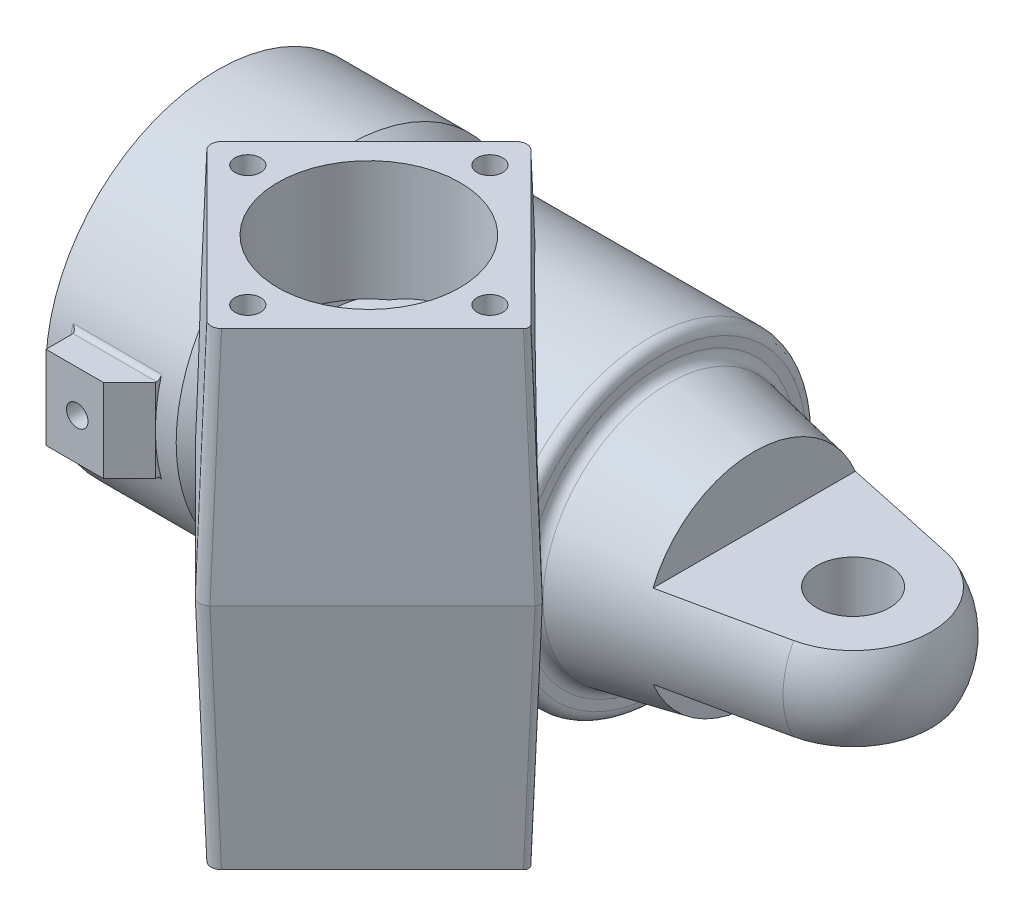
ISO-10303-21;
HEADER;
FILE_DESCRIPTION(('STEP AP214'),'2;1');
FILE_NAME('part.step','',(''),(''),'','','');
FILE_SCHEMA(('AUTOMOTIVE_DESIGN { 1 0 10303 214 1 1 1 1 }'));
ENDSEC;
DATA;
#1=APPLICATION_CONTEXT('core data for automotive mechanical design processes');
#2=APPLICATION_PROTOCOL_DEFINITION('international standard','automotive_design',2000,#1);
#3=PRODUCT_CONTEXT('',#1,'mechanical');
#4=PRODUCT('Part','Part','',(#3));
#5=PRODUCT_RELATED_PRODUCT_CATEGORY('part','',(#4));
#6=PRODUCT_DEFINITION_FORMATION('','',#4);
#7=PRODUCT_DEFINITION_CONTEXT('part definition',#1,'design');
#8=PRODUCT_DEFINITION('design','',#6,#7);
#9=PRODUCT_DEFINITION_SHAPE('','',#8);
#10=(LENGTH_UNIT() NAMED_UNIT(*) SI_UNIT(.MILLI.,.METRE.));
#11=(NAMED_UNIT(*) PLANE_ANGLE_UNIT() SI_UNIT($,.RADIAN.));
#12=(NAMED_UNIT(*) SI_UNIT($,.STERADIAN.) SOLID_ANGLE_UNIT());
#13=UNCERTAINTY_MEASURE_WITH_UNIT(LENGTH_MEASURE(1.E-05),#10,'distance_accuracy_value','');
#14=(GEOMETRIC_REPRESENTATION_CONTEXT(3) GLOBAL_UNCERTAINTY_ASSIGNED_CONTEXT((#13)) GLOBAL_UNIT_ASSIGNED_CONTEXT((#10,
#11,#12)) REPRESENTATION_CONTEXT('',''));
#15=CARTESIAN_POINT('',(0.,0.,0.));
#16=DIRECTION('',(0.,0.,1.));
#17=DIRECTION('',(1.,0.,0.));
#18=AXIS2_PLACEMENT_3D('',#15,#16,#17);
#19=CARTESIAN_POINT('',(69.0000002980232,0.,0.));
#20=DIRECTION('',(1.,0.,0.));
#21=DIRECTION('',(0.,0.,-1.));
#22=AXIS2_PLACEMENT_3D('',#19,#20,#21);
#23=PLANE('',#22);
#24=CARTESIAN_POINT('',(69.0000002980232,0.,0.));
#25=DIRECTION('',(1.,0.,0.));
#26=DIRECTION('',(0.,0.,1.));
#27=AXIS2_PLACEMENT_3D('',#24,#25,#26);
#28=CIRCLE('',#27,12.);
#29=CARTESIAN_POINT('',(69.0000002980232,0.,12.));
#30=VERTEX_POINT('',#29);
#31=EDGE_CURVE('E666',#30,#30,#28,.T.);
#32=ORIENTED_EDGE('',*,*,#31,.F.);
#33=EDGE_LOOP('',(#32));
#34=FACE_BOUND('',#33,.T.);
#35=ADVANCED_FACE('F18',(#34),#23,.F.);
#36=CARTESIAN_POINT('',(61.0000002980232,0.,0.));
#37=DIRECTION('',(-1.,0.,0.));
#38=DIRECTION('',(0.,0.,1.));
#39=AXIS2_PLACEMENT_3D('',#36,#37,#38);
#40=TOROIDAL_SURFACE('',#39,12.,8.);
#41=ORIENTED_EDGE('',*,*,#31,.T.);
#42=EDGE_LOOP('',(#41));
#43=FACE_BOUND('',#42,.T.);
#44=CARTESIAN_POINT('',(61.0000002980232,0.,0.));
#45=DIRECTION('',(1.,0.,0.));
#46=DIRECTION('',(0.,1.,0.));
#47=AXIS2_PLACEMENT_3D('',#44,#45,#46);
#48=CIRCLE('',#47,20.);
#49=CARTESIAN_POINT('',(61.0000002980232,20.,0.));
#50=VERTEX_POINT('',#49);
#51=EDGE_CURVE('E663',#50,#50,#48,.F.);
#52=ORIENTED_EDGE('',*,*,#51,.T.);
#53=EDGE_LOOP('',(#52));
#54=FACE_BOUND('',#53,.T.);
#55=ADVANCED_FACE('F675',(#43,#54),#40,.F.);
#56=CARTESIAN_POINT('',(56.0000002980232,0.,0.));
#57=DIRECTION('',(1.,0.,0.));
#58=DIRECTION('',(0.,1.,0.));
#59=AXIS2_PLACEMENT_3D('',#56,#57,#58);
#60=CYLINDRICAL_SURFACE('',#59,20.);
#61=CARTESIAN_POINT('',(56.0000002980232,0.,0.));
#62=DIRECTION('',(1.,0.,0.));
#63=DIRECTION('',(0.,1.,0.));
#64=AXIS2_PLACEMENT_3D('',#61,#62,#63);
#65=CIRCLE('',#64,20.);
#66=CARTESIAN_POINT('',(56.0000002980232,20.,0.));
#67=VERTEX_POINT('',#66);
#68=EDGE_CURVE('E23',#67,#67,#65,.F.);
#69=ORIENTED_EDGE('',*,*,#68,.T.);
#70=EDGE_LOOP('',(#69));
#71=FACE_BOUND('',#70,.T.);
#72=ORIENTED_EDGE('',*,*,#51,.F.);
#73=EDGE_LOOP('',(#72));
#74=FACE_BOUND('',#73,.T.);
#75=ADVANCED_FACE('F685',(#71,#74),#60,.F.);
#76=CARTESIAN_POINT('',(56.0000002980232,0.,0.));
#77=DIRECTION('',(1.,0.,0.));
#78=DIRECTION('',(0.,0.,-1.));
#79=AXIS2_PLACEMENT_3D('',#76,#77,#78);
#80=PLANE('',#79);
#81=CARTESIAN_POINT('',(56.0000002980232,0.,0.));
#82=DIRECTION('',(1.,0.,0.));
#83=DIRECTION('',(0.,1.,0.));
#84=AXIS2_PLACEMENT_3D('',#81,#82,#83);
#85=CIRCLE('',#84,23.5);
#86=CARTESIAN_POINT('',(56.0000002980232,23.5,0.));
#87=VERTEX_POINT('',#86);
#88=EDGE_CURVE('E662',#87,#87,#85,.F.);
#89=ORIENTED_EDGE('',*,*,#88,.T.);
#90=EDGE_LOOP('',(#89));
#91=FACE_BOUND('',#90,.T.);
#92=ORIENTED_EDGE('',*,*,#68,.F.);
#93=EDGE_LOOP('',(#92));
#94=FACE_BOUND('',#93,.T.);
#95=ADVANCED_FACE('F1221',(#91,#94),#80,.F.);
#96=CARTESIAN_POINT('',(2.50000029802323,0.,0.));
#97=DIRECTION('',(-1.,0.,0.));
#98=DIRECTION('',(0.,-1.,0.));
#99=AXIS2_PLACEMENT_3D('',#96,#97,#98);
#100=CONICAL_SURFACE('',#99,23.5,0.785398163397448);
#101=CARTESIAN_POINT('',(2.50000029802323,0.,0.));
#102=DIRECTION('',(1.,0.,0.));
#103=DIRECTION('',(0.,1.,0.));
#104=AXIS2_PLACEMENT_3D('',#101,#102,#103);
#105=CIRCLE('',#104,23.5);
#106=CARTESIAN_POINT('',(2.50000029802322,23.5,0.));
#107=VERTEX_POINT('',#106);
#108=EDGE_CURVE('E659',#107,#107,#105,.T.);
#109=ORIENTED_EDGE('',*,*,#108,.T.);
#110=EDGE_LOOP('',(#109));
#111=FACE_BOUND('',#110,.T.);
#112=CARTESIAN_POINT('',(1.00000029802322,0.,0.));
#113=DIRECTION('',(-1.,0.,0.));
#114=DIRECTION('',(0.,-1.,0.));
#115=AXIS2_PLACEMENT_3D('',#112,#113,#114);
#116=CIRCLE('',#115,25.);
#117=CARTESIAN_POINT('',(1.00000029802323,-25.,0.));
#118=VERTEX_POINT('',#117);
#119=EDGE_CURVE('E1213',#118,#118,#116,.T.);
#120=ORIENTED_EDGE('',*,*,#119,.T.);
#121=EDGE_LOOP('',(#120));
#122=FACE_BOUND('',#121,.T.);
#123=ADVANCED_FACE('F1236',(#111,#122),#100,.F.);
#124=CARTESIAN_POINT('',(30.0000002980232,-25.3,25.));
#125=DIRECTION('',(0.,1.,0.));
#126=DIRECTION('',(0.,0.,1.));
#127=AXIS2_PLACEMENT_3D('',#124,#125,#126);
#128=PLANE('',#127);
#129=CARTESIAN_POINT('',(30.0000002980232,-25.3,25.));
#130=DIRECTION('',(0.,1.,0.));
#131=DIRECTION('',(0.,0.,1.));
#132=AXIS2_PLACEMENT_3D('',#129,#130,#131);
#133=CIRCLE('',#132,15.7);
#134=CARTESIAN_POINT('',(30.0000002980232,-25.3,40.7));
#135=VERTEX_POINT('',#134);
#136=EDGE_CURVE('E1216',#135,#135,#133,.F.);
#137=ORIENTED_EDGE('',*,*,#136,.T.);
#138=EDGE_LOOP('',(#137));
#139=FACE_BOUND('',#138,.T.);
#140=CARTESIAN_POINT('',(30.0000002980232,-25.3,25.));
#141=DIRECTION('',(0.,1.,0.));
#142=DIRECTION('',(0.,0.,1.));
#143=AXIS2_PLACEMENT_3D('',#140,#141,#142);
#144=CIRCLE('',#143,15.);
#145=CARTESIAN_POINT('',(30.0000002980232,-25.3,40.));
#146=VERTEX_POINT('',#145);
#147=EDGE_CURVE('E271',#146,#146,#144,.T.);
#148=ORIENTED_EDGE('',*,*,#147,.T.);
#149=EDGE_LOOP('',(#148));
#150=FACE_BOUND('',#149,.T.);
#151=ADVANCED_FACE('F1230',(#139,#150),#128,.F.);
#152=CARTESIAN_POINT('',(1.00000029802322,0.,0.));
#153=DIRECTION('',(1.,0.,0.));
#154=DIRECTION('',(0.,1.,0.));
#155=AXIS2_PLACEMENT_3D('',#152,#153,#154);
#156=CYLINDRICAL_SURFACE('',#155,23.5);
#157=ORIENTED_EDGE('',*,*,#108,.F.);
#158=EDGE_LOOP('',(#157));
#159=FACE_BOUND('',#158,.T.);
#160=CARTESIAN_POINT('',(15.0000002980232,0.,0.));
#161=DIRECTION('',(1.,0.,0.));
#162=DIRECTION('',(0.,1.,0.));
#163=AXIS2_PLACEMENT_3D('',#160,#161,#162);
#164=CIRCLE('',#163,23.5);
#165=CARTESIAN_POINT('',(15.0000002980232,20.3703534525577,11.7174528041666));
#166=VERTEX_POINT('',#165);
#167=CARTESIAN_POINT('',(15.0000002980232,-20.3703534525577,11.7174528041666));
#168=VERTEX_POINT('',#167);
#169=EDGE_CURVE('E250',#166,#168,#164,.F.);
#170=ORIENTED_EDGE('',*,*,#169,.F.);
#171=CARTESIAN_POINT('',(26.7174531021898,0.,0.));
#172=DIRECTION('',(-0.707106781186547,0.,-0.707106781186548));
#173=DIRECTION('',(0.707106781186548,0.,-0.707106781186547));
#174=AXIS2_PLACEMENT_3D('',#171,#172,#173);
#175=ELLIPSE('',#174,33.2340187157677,23.5);
#176=EDGE_CURVE('E246',#166,#168,#175,.F.);
#177=ORIENTED_EDGE('',*,*,#176,.T.);
#178=EDGE_LOOP('',(#170,#177));
#179=FACE_BOUND('',#178,.T.);
#180=ADVANCED_FACE('F251',(#159,#179),#156,.F.);
#181=CARTESIAN_POINT('',(42.0000002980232,0.,0.));
#182=DIRECTION('',(1.,0.,0.));
#183=DIRECTION('',(0.,1.,0.));
#184=AXIS2_PLACEMENT_3D('',#181,#182,#183);
#185=CYLINDRICAL_SURFACE('',#184,23.5);
#186=CARTESIAN_POINT('',(42.0000002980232,0.,0.));
#187=DIRECTION('',(1.,0.,0.));
#188=DIRECTION('',(0.,1.,0.));
#189=AXIS2_PLACEMENT_3D('',#186,#187,#188);
#190=CIRCLE('',#189,23.5);
#191=CARTESIAN_POINT('',(42.0000002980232,21.9036406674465,8.5135495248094));
#192=VERTEX_POINT('',#191);
#193=CARTESIAN_POINT('',(42.0000002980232,-21.9036406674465,8.51354952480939));
#194=VERTEX_POINT('',#193);
#195=EDGE_CURVE('E286',#192,#194,#190,.F.);
#196=ORIENTED_EDGE('',*,*,#195,.T.);
#197=CARTESIAN_POINT('',(34.1365986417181,0.,0.));
#198=DIRECTION('',(0.7345995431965,0.,-0.678500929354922));
#199=DIRECTION('',(0.678500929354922,0.,0.7345995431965));
#200=AXIS2_PLACEMENT_3D('',#197,#198,#199);
#201=ELLIPSE('',#200,31.9902186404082,23.5);
#202=EDGE_CURVE('E597',#194,#192,#201,.F.);
#203=ORIENTED_EDGE('',*,*,#202,.T.);
#204=EDGE_LOOP('',(#196,#203));
#205=FACE_BOUND('',#204,.T.);
#206=ORIENTED_EDGE('',*,*,#88,.F.);
#207=EDGE_LOOP('',(#206));
#208=FACE_BOUND('',#207,.T.);
#209=ADVANCED_FACE('F1204',(#205,#208),#185,.F.);
#210=CARTESIAN_POINT('',(30.0000002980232,-26.7,25.));
#211=DIRECTION('',(0.,1.,0.));
#212=DIRECTION('',(0.,0.,1.));
#213=AXIS2_PLACEMENT_3D('',#210,#211,#212);
#214=CYLINDRICAL_SURFACE('',#213,15.7);
#215=ORIENTED_EDGE('',*,*,#136,.F.);
#216=EDGE_LOOP('',(#215));
#217=FACE_BOUND('',#216,.T.);
#218=CARTESIAN_POINT('',(30.0000002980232,-26.7,25.));
#219=DIRECTION('',(0.,1.,0.));
#220=DIRECTION('',(0.,0.,1.));
#221=AXIS2_PLACEMENT_3D('',#218,#219,#220);
#222=CIRCLE('',#221,15.7);
#223=CARTESIAN_POINT('',(30.0000002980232,-26.7,40.7));
#224=VERTEX_POINT('',#223);
#225=EDGE_CURVE('E280',#224,#224,#222,.T.);
#226=ORIENTED_EDGE('',*,*,#225,.F.);
#227=EDGE_LOOP('',(#226));
#228=FACE_BOUND('',#227,.T.);
#229=ADVANCED_FACE('F1072',(#217,#228),#214,.F.);
#230=CARTESIAN_POINT('',(-12.9999997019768,0.,28.));
#231=DIRECTION('',(0.,0.,1.));
#232=DIRECTION('',(1.,0.,0.));
#233=AXIS2_PLACEMENT_3D('',#230,#231,#232);
#234=CYLINDRICAL_SURFACE('',#233,2.067);
#235=CARTESIAN_POINT('',(-12.9999997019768,0.,38.));
#236=DIRECTION('',(0.,0.,1.));
#237=DIRECTION('',(1.,0.,0.));
#238=AXIS2_PLACEMENT_3D('',#235,#236,#237);
#239=CIRCLE('',#238,2.067);
#240=CARTESIAN_POINT('',(-10.9329997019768,0.,38.));
#241=VERTEX_POINT('',#240);
#242=EDGE_CURVE('E256',#241,#241,#239,.F.);
#243=ORIENTED_EDGE('',*,*,#242,.F.);
#244=EDGE_LOOP('',(#243));
#245=FACE_BOUND('',#244,.T.);
#246=CARTESIAN_POINT('',(-15.0669997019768,0.,27.5));
#247=CARTESIAN_POINT('',(-15.0669947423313,0.115934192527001,27.4999989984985));
#248=CARTESIAN_POINT('',(-15.0572135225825,0.23194429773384,27.4992590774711));
#249=CARTESIAN_POINT('',(-15.0183381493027,0.460753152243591,27.4963786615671));
#250=CARTESIAN_POINT('',(-14.9892229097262,0.573548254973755,27.494236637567));
#251=CARTESIAN_POINT('',(-14.9125237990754,0.792586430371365,27.4887941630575));
#252=CARTESIAN_POINT('',(-14.8649496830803,0.898832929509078,27.4854943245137));
#253=CARTESIAN_POINT('',(-14.7527001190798,1.10180736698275,27.4781067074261));
#254=CARTESIAN_POINT('',(-14.6880282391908,1.19853728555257,27.4740190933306));
#255=CARTESIAN_POINT('',(-14.5432721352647,1.37996035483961,27.4655053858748));
#256=CARTESIAN_POINT('',(-14.4631595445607,1.46463084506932,27.4610786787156));
#257=CARTESIAN_POINT('',(-14.2898556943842,1.61933734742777,27.4523908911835));
#258=CARTESIAN_POINT('',(-14.1966638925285,1.68937275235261,27.4481298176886));
#259=CARTESIAN_POINT('',(-13.9997121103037,1.8128959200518,27.4402488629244));
#260=CARTESIAN_POINT('',(-13.8959397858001,1.86636405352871,27.4366297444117));
#261=CARTESIAN_POINT('',(-13.6808590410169,1.95510942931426,27.4304490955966));
#262=CARTESIAN_POINT('',(-13.5695507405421,1.99038696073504,27.4278875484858));
#263=CARTESIAN_POINT('',(-13.3427824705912,2.04168484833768,27.4241169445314));
#264=CARTESIAN_POINT('',(-13.2273308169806,2.05774177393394,27.4229053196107));
#265=CARTESIAN_POINT('',(-12.995364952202,2.07025560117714,27.4219635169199));
#266=CARTESIAN_POINT('',(-12.8788507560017,2.06671277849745,27.4222333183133));
#267=CARTESIAN_POINT('',(-12.6483179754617,2.04015795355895,27.4242215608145));
#268=CARTESIAN_POINT('',(-12.5342947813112,2.01718571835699,27.4259370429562));
#269=CARTESIAN_POINT('',(-12.3117262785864,1.95248555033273,27.4306187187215));
#270=CARTESIAN_POINT('',(-12.2031810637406,1.91075729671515,27.433584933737));
#271=CARTESIAN_POINT('',(-11.9945200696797,1.80968312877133,27.4404373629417));
#272=CARTESIAN_POINT('',(-11.8944133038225,1.75031867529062,27.4443245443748));
#273=CARTESIAN_POINT('',(-11.7055786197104,1.61567599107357,27.4525795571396));
#274=CARTESIAN_POINT('',(-11.6168499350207,1.54039883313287,27.4569473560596));
#275=CARTESIAN_POINT('',(-11.4530652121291,1.37585944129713,27.4656840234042));
#276=CARTESIAN_POINT('',(-11.3780409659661,1.28656556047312,27.4700528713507));
#277=CARTESIAN_POINT('',(-11.2440070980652,1.0965837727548,27.4782919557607));
#278=CARTESIAN_POINT('',(-11.1850049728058,0.99589056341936,27.4821619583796));
#279=CARTESIAN_POINT('',(-11.0846998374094,0.785922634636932,27.4889681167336));
#280=CARTESIAN_POINT('',(-11.0434129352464,0.676640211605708,27.491903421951));
#281=CARTESIAN_POINT('',(-10.979869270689,0.452818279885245,27.4964982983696));
#282=CARTESIAN_POINT('',(-10.9575720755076,0.338290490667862,27.4981605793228));
#283=CARTESIAN_POINT('',(-10.9410333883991,0.185846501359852,27.4993972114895));
#284=CARTESIAN_POINT('',(-10.9380229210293,0.14874577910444,27.499622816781));
#285=CARTESIAN_POINT('',(-10.9340052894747,0.0744353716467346,27.4999243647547));
#286=CARTESIAN_POINT('',(-10.9329981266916,0.0372256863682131,27.5000003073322));
#287=CARTESIAN_POINT('',(-10.9330046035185,-0.115828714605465,27.4999990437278));
#288=CARTESIAN_POINT('',(-10.9427757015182,-0.231812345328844,27.4992598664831));
#289=CARTESIAN_POINT('',(-10.9816313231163,-0.460649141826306,27.4963808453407));
#290=CARTESIAN_POINT('',(-11.0107567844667,-0.573495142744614,27.4942380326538));
#291=CARTESIAN_POINT('',(-11.0874809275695,-0.792598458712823,27.4887937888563));
#292=CARTESIAN_POINT('',(-11.1350629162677,-0.898861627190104,27.4854934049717));
#293=CARTESIAN_POINT('',(-11.2473173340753,-1.10183516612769,27.478105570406));
#294=CARTESIAN_POINT('',(-11.3119814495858,-1.19855015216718,27.4740185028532));
#295=CARTESIAN_POINT('',(-11.4567171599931,-1.37994770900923,27.4655059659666));
#296=CARTESIAN_POINT('',(-11.5368171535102,-1.46460759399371,27.4610798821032));
#297=CARTESIAN_POINT('',(-11.7101191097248,-1.619318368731,27.4523920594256));
#298=CARTESIAN_POINT('',(-11.8033251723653,-1.6893646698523,27.448130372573));
#299=CARTESIAN_POINT('',(-12.0003384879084,-1.81292962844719,27.4402466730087));
#300=CARTESIAN_POINT('',(-12.1041624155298,-1.86642174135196,27.4366256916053));
#301=CARTESIAN_POINT('',(-12.3192752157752,-1.95514979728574,27.4304463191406));
#302=CARTESIAN_POINT('',(-12.4305556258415,-1.99040605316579,27.4278867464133));
#303=CARTESIAN_POINT('',(-12.6187068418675,-2.03297673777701,27.4247566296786));
#304=CARTESIAN_POINT('',(-12.6943879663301,-2.04571814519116,27.4238055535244));
#305=CARTESIAN_POINT('',(-12.8467015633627,-2.06273140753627,27.4225310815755));
#306=CARTESIAN_POINT('',(-12.9233340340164,-2.06700327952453,27.4222076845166));
#307=CARTESIAN_POINT('',(-13.1159332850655,-2.06699504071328,27.422209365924));
#308=CARTESIAN_POINT('',(-13.2319427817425,-2.05721392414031,27.4229514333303));
#309=CARTESIAN_POINT('',(-13.4607505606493,-2.01833894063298,27.4258395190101));
#310=CARTESIAN_POINT('',(-13.5735451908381,-1.98922395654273,27.4279870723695));
#311=CARTESIAN_POINT('',(-13.7925841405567,-1.91252501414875,27.4334415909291));
#312=CARTESIAN_POINT('',(-13.898831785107,-1.86495052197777,27.4367479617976));
#313=CARTESIAN_POINT('',(-14.1018048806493,-1.75270155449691,27.4441466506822));
#314=CARTESIAN_POINT('',(-14.1985326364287,-1.68803123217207,27.4482387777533));
#315=CARTESIAN_POINT('',(-14.3799444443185,-1.54328566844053,27.4567572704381));
#316=CARTESIAN_POINT('',(-14.4646068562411,-1.46318333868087,27.4611842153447));
#317=CARTESIAN_POINT('',(-14.6193182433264,-1.2898801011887,27.4698693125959));
#318=CARTESIAN_POINT('',(-14.6893633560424,-1.19667574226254,27.4741274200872));
#319=CARTESIAN_POINT('',(-14.8129273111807,-0.999664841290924,27.4820013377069));
#320=CARTESIAN_POINT('',(-14.8664193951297,-0.895841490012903,27.485616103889));
#321=CARTESIAN_POINT('',(-14.9551479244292,-0.680729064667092,27.4917831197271));
#322=CARTESIAN_POINT('',(-14.990404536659,-0.569448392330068,27.494336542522));
#323=CARTESIAN_POINT('',(-15.0329758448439,-0.381296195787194,27.4974587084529));
#324=CARTESIAN_POINT('',(-15.0457174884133,-0.305614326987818,27.4984072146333));
#325=CARTESIAN_POINT('',(-15.0627310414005,-0.153299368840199,27.499678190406));
#326=CARTESIAN_POINT('',(-15.0670029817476,-0.0766662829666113,27.5000006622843));
#327=CARTESIAN_POINT('',(-15.0669997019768,0.,27.5));
#328=B_SPLINE_CURVE_WITH_KNOTS('',3,(#246,#247,#248,#249,#250,#251,#252,#253,#254,#255,#256,
#257,#258,#259,#260,#261,#262,#263,#264,#265,#266,#267,#268,#269,#270,#271,#272,#273,#274,#275,
#276,#277,#278,#279,#280,#281,#282,#283,#284,#285,#286,#287,#288,#289,#290,#291,#292,#293,#294,
#295,#296,#297,#298,#299,#300,#301,#302,#303,#304,#305,#306,#307,#308,#309,#310,#311,#312,#313,
#314,#315,#316,#317,#318,#319,#320,#321,#322,#323,#324,#325,#326,#327),.UNSPECIFIED.,.T.,.F.,(4,
2,2,2,2,2,2,2,2,2,2,2,2,2,2,2,2,2,2,2,2,2,2,2,2,2,2,2,2,2,2,2,2,2,2,2,2,2,2,2,4),(0.,
0.34752316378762,0.695425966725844,1.04314516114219,1.39079184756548,1.73908340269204,
2.08738940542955,2.43610652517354,2.78481810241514,3.13286515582,3.48090731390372,
3.82823883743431,4.17557630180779,4.52328018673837,4.8709606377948,5.21943768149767,
5.56807749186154,5.91703364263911,6.26524492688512,6.37687637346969,6.4885078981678,
6.83585236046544,7.18393386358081,7.53170127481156,7.87929974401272,8.22754393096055,
8.57589730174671,8.92480639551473,9.27332599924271,9.50313869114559,9.73295092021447,
10.0804722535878,10.4283737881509,10.7760971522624,11.1237361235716,11.471990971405,
11.8203377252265,12.1692446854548,12.517764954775,12.7475798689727,12.9773939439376),.UNSPECIFIED.);
#329=CARTESIAN_POINT('',(-15.0669997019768,0.,27.5));
#330=VERTEX_POINT('',#329);
#331=EDGE_CURVE('E1057',#330,#330,#328,.T.);
#332=ORIENTED_EDGE('',*,*,#331,.T.);
#333=EDGE_LOOP('',(#332));
#334=FACE_BOUND('',#333,.T.);
#335=ADVANCED_FACE('F1066',(#245,#334),#234,.F.);
#336=CARTESIAN_POINT('',(1.00000029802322,0.,0.));
#337=DIRECTION('',(1.,0.,0.));
#338=DIRECTION('',(0.,0.,-1.));
#339=AXIS2_PLACEMENT_3D('',#336,#337,#338);
#340=PLANE('',#339);
#341=ORIENTED_EDGE('',*,*,#119,.F.);
#342=EDGE_LOOP('',(#341));
#343=FACE_BOUND('',#342,.T.);
#344=CARTESIAN_POINT('',(1.00000029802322,0.,0.));
#345=DIRECTION('',(1.,0.,0.));
#346=DIRECTION('',(0.,1.,0.));
#347=AXIS2_PLACEMENT_3D('',#344,#345,#346);
#348=CIRCLE('',#347,27.5);
#349=CARTESIAN_POINT('',(1.00000029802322,27.5,0.));
#350=VERTEX_POINT('',#349);
#351=EDGE_CURVE('E629',#350,#350,#348,.F.);
#352=ORIENTED_EDGE('',*,*,#351,.T.);
#353=EDGE_LOOP('',(#352));
#354=FACE_BOUND('',#353,.T.);
#355=ADVANCED_FACE('F1071',(#343,#354),#340,.F.);
#356=CARTESIAN_POINT('',(-10.9999997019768,0.,38.));
#357=DIRECTION('',(0.,0.,1.));
#358=DIRECTION('',(0.,-1.,0.));
#359=AXIS2_PLACEMENT_3D('',#356,#357,#358);
#360=PLANE('',#359);
#361=DIRECTION('',(0.,-1.,0.));
#362=VECTOR('',#361,1.);
#363=CARTESIAN_POINT('',(-18.9999997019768,8.,38.));
#364=LINE('',#363,#362);
#365=CARTESIAN_POINT('',(-18.9999997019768,-8.00000000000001,38.));
#366=VERTEX_POINT('',#365);
#367=CARTESIAN_POINT('',(-18.9999997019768,8.,38.));
#368=VERTEX_POINT('',#367);
#369=EDGE_CURVE('E637',#366,#368,#364,.F.);
#370=ORIENTED_EDGE('',*,*,#369,.F.);
#371=DIRECTION('',(1.,0.,0.));
#372=VECTOR('',#371,1.);
#373=CARTESIAN_POINT('',(-18.9999997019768,-8.00000000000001,38.));
#374=LINE('',#373,#372);
#375=CARTESIAN_POINT('',(-7.99999970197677,-8.,38.));
#376=VERTEX_POINT('',#375);
#377=EDGE_CURVE('E560',#376,#366,#374,.F.);
#378=ORIENTED_EDGE('',*,*,#377,.F.);
#379=DIRECTION('',(0.,1.,0.));
#380=VECTOR('',#379,1.);
#381=CARTESIAN_POINT('',(-7.99999970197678,-4.,38.));
#382=LINE('',#381,#380);
#383=CARTESIAN_POINT('',(-7.99999970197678,8.,38.));
#384=VERTEX_POINT('',#383);
#385=EDGE_CURVE('E561',#384,#376,#382,.F.);
#386=ORIENTED_EDGE('',*,*,#385,.F.);
#387=DIRECTION('',(1.,0.,0.));
#388=VECTOR('',#387,1.);
#389=CARTESIAN_POINT('',(-2.99999970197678,8.,38.));
#390=LINE('',#389,#388);
#391=EDGE_CURVE('E568',#368,#384,#390,.T.);
#392=ORIENTED_EDGE('',*,*,#391,.F.);
#393=EDGE_LOOP('',(#370,#378,#386,#392));
#394=FACE_BOUND('',#393,.T.);
#395=ORIENTED_EDGE('',*,*,#242,.T.);
#396=EDGE_LOOP('',(#395));
#397=FACE_BOUND('',#396,.T.);
#398=ADVANCED_FACE('F1077',(#394,#397),#360,.T.);
#399=CARTESIAN_POINT('',(98.0000002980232,-8.,0.));
#400=DIRECTION('',(0.,1.,0.));
#401=DIRECTION('',(0.,0.,1.));
#402=AXIS2_PLACEMENT_3D('',#399,#400,#401);
#403=CYLINDRICAL_SURFACE('',#402,7.);
#404=CARTESIAN_POINT('',(98.0000002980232,-8.,0.));
#405=DIRECTION('',(0.,1.,0.));
#406=DIRECTION('',(0.,0.,1.));
#407=AXIS2_PLACEMENT_3D('',#404,#405,#406);
#408=CIRCLE('',#407,7.);
#409=CARTESIAN_POINT('',(98.0000002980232,-8.,7.));
#410=VERTEX_POINT('',#409);
#411=EDGE_CURVE('E567',#410,#410,#408,.F.);
#412=ORIENTED_EDGE('',*,*,#411,.T.);
#413=EDGE_LOOP('',(#412));
#414=FACE_BOUND('',#413,.T.);
#415=CARTESIAN_POINT('',(98.0000002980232,8.,0.));
#416=DIRECTION('',(0.,1.,0.));
#417=DIRECTION('',(0.,0.,1.));
#418=AXIS2_PLACEMENT_3D('',#415,#416,#417);
#419=CIRCLE('',#418,7.);
#420=CARTESIAN_POINT('',(98.0000002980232,8.,7.));
#421=VERTEX_POINT('',#420);
#422=EDGE_CURVE('E1800',#421,#421,#419,.F.);
#423=ORIENTED_EDGE('',*,*,#422,.F.);
#424=EDGE_LOOP('',(#423));
#425=FACE_BOUND('',#424,.T.);
#426=ADVANCED_FACE('F1081',(#414,#425),#403,.F.);
#427=CARTESIAN_POINT('',(15.0000002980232,0.,0.));
#428=DIRECTION('',(1.,0.,0.));
#429=DIRECTION('',(0.,0.,-1.));
#430=AXIS2_PLACEMENT_3D('',#427,#428,#429);
#431=PLANE('',#430);
#432=DIRECTION('',(0.,1.,0.));
#433=VECTOR('',#432,1.);
#434=CARTESIAN_POINT('',(15.0000002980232,22.,11.7174528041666));
#435=LINE('',#434,#433);
#436=CARTESIAN_POINT('',(15.0000002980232,21.5163031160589,11.7174528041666));
#437=VERTEX_POINT('',#436);
#438=EDGE_CURVE('E261',#437,#166,#435,.F.);
#439=ORIENTED_EDGE('',*,*,#438,.T.);
#440=ORIENTED_EDGE('',*,*,#169,.T.);
#441=DIRECTION('',(0.,1.,0.));
#442=VECTOR('',#441,1.);
#443=CARTESIAN_POINT('',(15.0000002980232,22.,11.7174528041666));
#444=LINE('',#443,#442);
#445=CARTESIAN_POINT('',(15.0000002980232,-21.5163031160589,11.7174528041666));
#446=VERTEX_POINT('',#445);
#447=EDGE_CURVE('E264',#168,#446,#444,.F.);
#448=ORIENTED_EDGE('',*,*,#447,.T.);
#449=CARTESIAN_POINT('',(15.0000002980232,0.,0.));
#450=DIRECTION('',(1.,0.,0.));
#451=DIRECTION('',(0.,1.,0.));
#452=AXIS2_PLACEMENT_3D('',#449,#450,#451);
#453=CIRCLE('',#452,24.5);
#454=EDGE_CURVE('E268',#446,#437,#453,.T.);
#455=ORIENTED_EDGE('',*,*,#454,.T.);
#456=EDGE_LOOP('',(#439,#440,#448,#455));
#457=FACE_BOUND('',#456,.T.);
#458=ADVANCED_FACE('F266',(#457),#431,.T.);
#459=CARTESIAN_POINT('',(29.8725622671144,-22.,24.8485585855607));
#460=DIRECTION('',(0.,1.,0.));
#461=DIRECTION('',(0.,0.,1.));
#462=AXIS2_PLACEMENT_3D('',#459,#460,#461);
#463=PLANE('',#462);
#464=DIRECTION('',(0.,0.,-1.));
#465=VECTOR('',#464,1.);
#466=CARTESIAN_POINT('',(42.0000002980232,-22.,0.));
#467=LINE('',#466,#465);
#468=CARTESIAN_POINT('',(42.0000002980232,-22.,8.51354952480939));
#469=VERTEX_POINT('',#468);
#470=CARTESIAN_POINT('',(42.0000002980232,-22.,10.7819293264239));
#471=VERTEX_POINT('',#470);
#472=EDGE_CURVE('E278',#469,#471,#467,.F.);
#473=ORIENTED_EDGE('',*,*,#472,.T.);
#474=DIRECTION('',(1.,0.,0.));
#475=VECTOR('',#474,1.);
#476=CARTESIAN_POINT('',(15.0000002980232,-22.,10.7819293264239));
#477=LINE('',#476,#475);
#478=CARTESIAN_POINT('',(34.7797980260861,-22.,10.7819293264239));
#479=VERTEX_POINT('',#478);
#480=EDGE_CURVE('E1001',#471,#479,#477,.F.);
#481=ORIENTED_EDGE('',*,*,#480,.T.);
#482=CARTESIAN_POINT('',(30.0000002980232,-22.,25.));
#483=DIRECTION('',(0.,1.,0.));
#484=DIRECTION('',(0.,0.,1.));
#485=AXIS2_PLACEMENT_3D('',#482,#483,#484);
#486=CIRCLE('',#485,15.);
#487=CARTESIAN_POINT('',(25.2202025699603,-22.,10.7819293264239));
#488=VERTEX_POINT('',#487);
#489=EDGE_CURVE('E255',#479,#488,#486,.F.);
#490=ORIENTED_EDGE('',*,*,#489,.T.);
#491=DIRECTION('',(1.,0.,0.));
#492=VECTOR('',#491,1.);
#493=CARTESIAN_POINT('',(15.0000002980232,-22.,10.7819293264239));
#494=LINE('',#493,#492);
#495=CARTESIAN_POINT('',(15.935523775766,-22.,10.7819293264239));
#496=VERTEX_POINT('',#495);
#497=EDGE_CURVE('E1112',#488,#496,#494,.F.);
#498=ORIENTED_EDGE('',*,*,#497,.T.);
#499=DIRECTION('',(-0.707106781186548,0.,0.707106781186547));
#500=VECTOR('',#499,1.);
#501=CARTESIAN_POINT('',(30.5742920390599,-22.,-3.85683893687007));
#502=LINE('',#501,#500);
#503=CARTESIAN_POINT('',(1.71745310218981,-22.,25.));
#504=VERTEX_POINT('',#503);
#505=EDGE_CURVE('E269',#496,#504,#502,.T.);
#506=ORIENTED_EDGE('',*,*,#505,.T.);
#507=DIRECTION('',(0.707106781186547,0.,0.707106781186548));
#508=VECTOR('',#507,1.);
#509=CARTESIAN_POINT('',(1.71745310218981,-22.,25.));
#510=LINE('',#509,#508);
#511=CARTESIAN_POINT('',(30.0017243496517,-22.,53.2842712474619));
#512=VERTEX_POINT('',#511);
#513=EDGE_CURVE('E609',#504,#512,#510,.T.);
#514=ORIENTED_EDGE('',*,*,#513,.T.);
#515=DIRECTION('',(0.707106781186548,0.,-0.707106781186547));
#516=VECTOR('',#515,1.);
#517=CARTESIAN_POINT('',(30.0017243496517,-22.,53.2842712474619));
#518=LINE('',#517,#516);
#519=CARTESIAN_POINT('',(57.7357072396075,-22.,25.5502883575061));
#520=VERTEX_POINT('',#519);
#521=EDGE_CURVE('E608',#512,#520,#518,.T.);
#522=ORIENTED_EDGE('',*,*,#521,.T.);
#523=DIRECTION('',(-0.678500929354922,0.,-0.7345995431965));
#524=VECTOR('',#523,1.);
#525=CARTESIAN_POINT('',(57.7357072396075,-22.,25.5502883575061));
#526=LINE('',#525,#524);
#527=EDGE_CURVE('E292',#520,#469,#526,.T.);
#528=ORIENTED_EDGE('',*,*,#527,.T.);
#529=EDGE_LOOP('',(#473,#481,#490,#498,#506,#514,#522,#528));
#530=FACE_BOUND('',#529,.T.);
#531=ADVANCED_FACE('F1010',(#530),#463,.T.);
#532=CARTESIAN_POINT('',(30.0000002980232,-45.,25.));
#533=DIRECTION('',(0.,1.,0.));
#534=DIRECTION('',(0.,0.,1.));
#535=AXIS2_PLACEMENT_3D('',#532,#533,#534);
#536=CYLINDRICAL_SURFACE('',#535,15.);
#537=ORIENTED_EDGE('',*,*,#147,.F.);
#538=EDGE_LOOP('',(#537));
#539=FACE_BOUND('',#538,.T.);
#540=CARTESIAN_POINT('',(34.7797980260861,-22.,10.7819293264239));
#541=CARTESIAN_POINT('',(34.6003042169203,-22.0295706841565,10.7215860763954));
#542=CARTESIAN_POINT('',(34.419404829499,-22.0572151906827,10.6645570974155));
#543=CARTESIAN_POINT('',(34.0550852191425,-22.1087660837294,10.557273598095));
#544=CARTESIAN_POINT('',(33.8716650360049,-22.1326725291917,10.5070189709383));
#545=CARTESIAN_POINT('',(33.3181525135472,-22.1989451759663,10.3666587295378));
#546=CARTESIAN_POINT('',(32.9447083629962,-22.235880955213,10.2869231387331));
#547=CARTESIAN_POINT('',(32.1910667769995,-22.2960063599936,10.155948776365));
#548=CARTESIAN_POINT('',(31.8108576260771,-22.3191691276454,10.1047656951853));
#549=CARTESIAN_POINT('',(31.0470654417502,-22.3521172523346,10.0316732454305));
#550=CARTESIAN_POINT('',(30.6634825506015,-22.3619031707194,10.009762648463));
#551=CARTESIAN_POINT('',(29.8955393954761,-22.368306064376,9.99544621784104));
#552=CARTESIAN_POINT('',(29.5111789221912,-22.3649188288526,10.003049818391));
#553=CARTESIAN_POINT('',(28.7444449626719,-22.344891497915,10.0477072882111));
#554=CARTESIAN_POINT('',(28.3620718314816,-22.3282491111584,10.0847662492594));
#555=CARTESIAN_POINT('',(27.6031856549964,-22.2814294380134,10.187791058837));
#556=CARTESIAN_POINT('',(27.2266592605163,-22.2512899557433,10.2536761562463));
#557=CARTESIAN_POINT('',(26.4812269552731,-22.176900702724,10.4135896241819));
#558=CARTESIAN_POINT('',(26.1123161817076,-22.1326602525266,10.5075994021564));
#559=CARTESIAN_POINT('',(25.6598709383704,-22.068376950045,10.6413142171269));
#560=CARTESIAN_POINT('',(25.5714528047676,-22.0553280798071,10.6683388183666));
#561=CARTESIAN_POINT('',(25.3953142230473,-22.0283383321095,10.7239578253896));
#562=CARTESIAN_POINT('',(25.3075933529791,-22.0143980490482,10.7525511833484));
#563=CARTESIAN_POINT('',(25.2202025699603,-22.,10.7819293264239));
#564=B_SPLINE_CURVE_WITH_KNOTS('',3,(#540,#541,#542,#543,#544,#545,#546,#547,#548,#549,#550,
#551,#552,#553,#554,#555,#556,#557,#558,#559,#560,#561,#562,#563),.UNSPECIFIED.,.F.,.F.,(4,2,2,
2,2,2,2,2,2,2,2,4),(0.,0.574890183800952,1.14977130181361,2.29921479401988,3.4508924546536,
4.60252178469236,5.75451926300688,6.90671592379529,8.05570537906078,9.20393693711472,
9.48404207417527,9.76396234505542),.UNSPECIFIED.);
#565=EDGE_CURVE('E992',#479,#488,#564,.T.);
#566=ORIENTED_EDGE('',*,*,#565,.T.);
#567=ORIENTED_EDGE('',*,*,#489,.F.);
#568=EDGE_LOOP('',(#566,#567));
#569=FACE_BOUND('',#568,.T.);
#570=ADVANCED_FACE('F1005',(#539,#569),#536,.F.);
#571=CARTESIAN_POINT('',(30.5742920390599,22.,-3.85683893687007));
#572=DIRECTION('',(-0.707106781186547,0.,-0.707106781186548));
#573=DIRECTION('',(-0.707106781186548,0.,0.707106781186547));
#574=AXIS2_PLACEMENT_3D('',#571,#572,#573);
#575=PLANE('',#574);
#576=ORIENTED_EDGE('',*,*,#447,.F.);
#577=ORIENTED_EDGE('',*,*,#176,.F.);
#578=ORIENTED_EDGE('',*,*,#438,.F.);
#579=CARTESIAN_POINT('',(26.7174531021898,0.,0.));
#580=DIRECTION('',(-0.707106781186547,0.,-0.707106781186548));
#581=DIRECTION('',(0.707106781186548,0.,-0.707106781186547));
#582=AXIS2_PLACEMENT_3D('',#579,#580,#581);
#583=ELLIPSE('',#582,34.6482322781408,24.5);
#584=CARTESIAN_POINT('',(15.9355237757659,22.,10.7819293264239));
#585=VERTEX_POINT('',#584);
#586=EDGE_CURVE('E1104',#437,#585,#583,.T.);
#587=ORIENTED_EDGE('',*,*,#586,.T.);
#588=DIRECTION('',(-0.707106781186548,0.,0.707106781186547));
#589=VECTOR('',#588,1.);
#590=CARTESIAN_POINT('',(15.9355237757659,22.,10.7819293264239));
#591=LINE('',#590,#589);
#592=CARTESIAN_POINT('',(1.71745310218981,22.,25.));
#593=VERTEX_POINT('',#592);
#594=EDGE_CURVE('E614',#585,#593,#591,.T.);
#595=ORIENTED_EDGE('',*,*,#594,.T.);
#596=DIRECTION('',(0.,1.,0.));
#597=VECTOR('',#596,1.);
#598=CARTESIAN_POINT('',(1.71745310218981,22.,25.));
#599=LINE('',#598,#597);
#600=EDGE_CURVE('E617',#593,#504,#599,.F.);
#601=ORIENTED_EDGE('',*,*,#600,.T.);
#602=ORIENTED_EDGE('',*,*,#505,.F.);
#603=CARTESIAN_POINT('',(26.7174531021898,0.,0.));
#604=DIRECTION('',(-0.707106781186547,0.,-0.707106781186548));
#605=DIRECTION('',(0.707106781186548,0.,-0.707106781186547));
#606=AXIS2_PLACEMENT_3D('',#603,#604,#605);
#607=ELLIPSE('',#606,34.6482322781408,24.5);
#608=EDGE_CURVE('E1114',#496,#446,#607,.T.);
#609=ORIENTED_EDGE('',*,*,#608,.T.);
#610=EDGE_LOOP('',(#576,#577,#578,#587,#595,#601,#602,#609));
#611=FACE_BOUND('',#610,.T.);
#612=ADVANCED_FACE('F260',(#611),#575,.F.);
#613=CARTESIAN_POINT('',(1.71745310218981,22.,25.));
#614=DIRECTION('',(-0.707106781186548,0.,0.707106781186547));
#615=DIRECTION('',(0.707106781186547,0.,0.707106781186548));
#616=AXIS2_PLACEMENT_3D('',#613,#614,#615);
#617=PLANE('',#616);
#618=ORIENTED_EDGE('',*,*,#600,.F.);
#619=DIRECTION('',(0.707106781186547,0.,0.707106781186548));
#620=VECTOR('',#619,1.);
#621=CARTESIAN_POINT('',(1.71745310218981,22.,25.));
#622=LINE('',#621,#620);
#623=CARTESIAN_POINT('',(30.0017243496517,22.,53.2842712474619));
#624=VERTEX_POINT('',#623);
#625=EDGE_CURVE('E602',#593,#624,#622,.T.);
#626=ORIENTED_EDGE('',*,*,#625,.T.);
#627=DIRECTION('',(0.,1.,0.));
#628=VECTOR('',#627,1.);
#629=CARTESIAN_POINT('',(30.0017243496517,22.,53.2842712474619));
#630=LINE('',#629,#628);
#631=EDGE_CURVE('E605',#624,#512,#630,.F.);
#632=ORIENTED_EDGE('',*,*,#631,.T.);
#633=ORIENTED_EDGE('',*,*,#513,.F.);
#634=EDGE_LOOP('',(#618,#626,#632,#633));
#635=FACE_BOUND('',#634,.T.);
#636=ADVANCED_FACE('F1015',(#635),#617,.F.);
#637=CARTESIAN_POINT('',(30.0017243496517,22.,53.2842712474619));
#638=DIRECTION('',(0.707106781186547,0.,0.707106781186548));
#639=DIRECTION('',(0.707106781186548,0.,-0.707106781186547));
#640=AXIS2_PLACEMENT_3D('',#637,#638,#639);
#641=PLANE('',#640);
#642=ORIENTED_EDGE('',*,*,#631,.F.);
#643=DIRECTION('',(0.707106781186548,0.,-0.707106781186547));
#644=VECTOR('',#643,1.);
#645=CARTESIAN_POINT('',(30.0017243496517,22.,53.2842712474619));
#646=LINE('',#645,#644);
#647=CARTESIAN_POINT('',(57.7357072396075,22.,25.5502883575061));
#648=VERTEX_POINT('',#647);
#649=EDGE_CURVE('E591',#624,#648,#646,.T.);
#650=ORIENTED_EDGE('',*,*,#649,.T.);
#651=DIRECTION('',(0.,1.,0.));
#652=VECTOR('',#651,1.);
#653=CARTESIAN_POINT('',(57.7357072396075,22.,25.5502883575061));
#654=LINE('',#653,#652);
#655=EDGE_CURVE('E594',#648,#520,#654,.F.);
#656=ORIENTED_EDGE('',*,*,#655,.T.);
#657=ORIENTED_EDGE('',*,*,#521,.F.);
#658=EDGE_LOOP('',(#642,#650,#656,#657));
#659=FACE_BOUND('',#658,.T.);
#660=ADVANCED_FACE('F1018',(#659),#641,.F.);
#661=CARTESIAN_POINT('',(57.7357072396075,22.,25.5502883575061));
#662=DIRECTION('',(0.7345995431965,0.,-0.678500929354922));
#663=DIRECTION('',(-0.678500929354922,0.,-0.7345995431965));
#664=AXIS2_PLACEMENT_3D('',#661,#662,#663);
#665=PLANE('',#664);
#666=ORIENTED_EDGE('',*,*,#527,.F.);
#667=ORIENTED_EDGE('',*,*,#655,.F.);
#668=DIRECTION('',(-0.678500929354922,0.,-0.7345995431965));
#669=VECTOR('',#668,1.);
#670=CARTESIAN_POINT('',(57.7357072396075,22.,25.5502883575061));
#671=LINE('',#670,#669);
#672=CARTESIAN_POINT('',(42.0000002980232,22.,8.5135495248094));
#673=VERTEX_POINT('',#672);
#674=EDGE_CURVE('E586',#648,#673,#671,.T.);
#675=ORIENTED_EDGE('',*,*,#674,.T.);
#676=DIRECTION('',(0.,1.,0.));
#677=VECTOR('',#676,1.);
#678=CARTESIAN_POINT('',(42.0000002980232,0.,8.51354952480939));
#679=LINE('',#678,#677);
#680=EDGE_CURVE('E289',#673,#192,#679,.F.);
#681=ORIENTED_EDGE('',*,*,#680,.T.);
#682=ORIENTED_EDGE('',*,*,#202,.F.);
#683=DIRECTION('',(0.,1.,0.));
#684=VECTOR('',#683,1.);
#685=CARTESIAN_POINT('',(42.0000002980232,0.,8.51354952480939));
#686=LINE('',#685,#684);
#687=EDGE_CURVE('E281',#194,#469,#686,.F.);
#688=ORIENTED_EDGE('',*,*,#687,.T.);
#689=EDGE_LOOP('',(#666,#667,#675,#681,#682,#688));
#690=FACE_BOUND('',#689,.T.);
#691=ADVANCED_FACE('F1022',(#690),#665,.F.);
#692=CARTESIAN_POINT('',(42.0000002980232,0.,0.));
#693=DIRECTION('',(1.,0.,0.));
#694=DIRECTION('',(0.,0.,-1.));
#695=AXIS2_PLACEMENT_3D('',#692,#693,#694);
#696=PLANE('',#695);
#697=ORIENTED_EDGE('',*,*,#687,.F.);
#698=ORIENTED_EDGE('',*,*,#195,.F.);
#699=ORIENTED_EDGE('',*,*,#680,.F.);
#700=DIRECTION('',(0.,0.,1.));
#701=VECTOR('',#700,1.);
#702=CARTESIAN_POINT('',(42.0000002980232,22.,24.8485585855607));
#703=LINE('',#702,#701);
#704=CARTESIAN_POINT('',(42.0000002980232,22.,10.7819293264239));
#705=VERTEX_POINT('',#704);
#706=EDGE_CURVE('E583',#673,#705,#703,.T.);
#707=ORIENTED_EDGE('',*,*,#706,.T.);
#708=CARTESIAN_POINT('',(42.0000002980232,0.,0.));
#709=DIRECTION('',(1.,0.,0.));
#710=DIRECTION('',(0.,1.,0.));
#711=AXIS2_PLACEMENT_3D('',#708,#709,#710);
#712=CIRCLE('',#711,24.5);
#713=EDGE_CURVE('E1003',#705,#471,#712,.F.);
#714=ORIENTED_EDGE('',*,*,#713,.T.);
#715=ORIENTED_EDGE('',*,*,#472,.F.);
#716=EDGE_LOOP('',(#697,#698,#699,#707,#714,#715));
#717=FACE_BOUND('',#716,.T.);
#718=ADVANCED_FACE('F1026',(#717),#696,.F.);
#719=CARTESIAN_POINT('',(30.0000002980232,-26.9999999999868,1.75000000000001));
#720=DIRECTION('',(0.,-1.,0.));
#721=DIRECTION('',(0.,0.,-1.));
#722=AXIS2_PLACEMENT_3D('',#719,#720,#721);
#723=CONICAL_SURFACE('',#722,2.45849999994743,1.02974425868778);
#724=CARTESIAN_POINT('',(30.0000002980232,-27.,1.75000000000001));
#725=DIRECTION('',(0.,-1.,0.));
#726=DIRECTION('',(0.,0.,-1.));
#727=AXIS2_PLACEMENT_3D('',#724,#725,#726);
#728=CIRCLE('',#727,2.4585);
#729=CARTESIAN_POINT('',(30.0000002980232,-27.,-0.708499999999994));
#730=VERTEX_POINT('',#729);
#731=EDGE_CURVE('E580',#730,#730,#728,.T.);
#732=ORIENTED_EDGE('',*,*,#731,.T.);
#733=EDGE_LOOP('',(#732));
#734=FACE_BOUND('',#733,.T.);
#735=CARTESIAN_POINT('',(30.0000002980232,-25.5227841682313,1.74999999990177));
#736=VERTEX_POINT('',#735);
#737=VERTEX_LOOP('',#736);
#738=FACE_BOUND('',#737,.T.);
#739=ADVANCED_FACE('F1030',(#734,#738),#723,.F.);
#740=CARTESIAN_POINT('',(53.2500002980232,-26.99999999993,25.));
#741=DIRECTION('',(0.,-1.,0.));
#742=DIRECTION('',(0.,0.,-1.));
#743=AXIS2_PLACEMENT_3D('',#740,#741,#742);
#744=CONICAL_SURFACE('',#743,2.45849999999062,1.0297442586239);
#745=CARTESIAN_POINT('',(53.2500002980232,-27.,25.));
#746=DIRECTION('',(0.,-1.,0.));
#747=DIRECTION('',(0.,0.,-1.));
#748=AXIS2_PLACEMENT_3D('',#745,#746,#747);
#749=CIRCLE('',#748,2.4585);
#750=CARTESIAN_POINT('',(53.2500002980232,-27.,22.5415));
#751=VERTEX_POINT('',#750);
#752=EDGE_CURVE('E577',#751,#751,#749,.T.);
#753=ORIENTED_EDGE('',*,*,#752,.T.);
#754=EDGE_LOOP('',(#753));
#755=FACE_BOUND('',#754,.T.);
#756=CARTESIAN_POINT('',(53.2500002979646,-25.5227841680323,25.));
#757=VERTEX_POINT('',#756);
#758=VERTEX_LOOP('',#757);
#759=FACE_BOUND('',#758,.T.);
#760=ADVANCED_FACE('F1034',(#755,#759),#744,.F.);
#761=CARTESIAN_POINT('',(30.0000002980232,-26.9999999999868,48.25));
#762=DIRECTION('',(0.,-1.,0.));
#763=DIRECTION('',(0.,0.,-1.));
#764=AXIS2_PLACEMENT_3D('',#761,#762,#763);
#765=CONICAL_SURFACE('',#764,2.45850000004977,1.02974425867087);
#766=CARTESIAN_POINT('',(30.0000002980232,-27.,48.25));
#767=DIRECTION('',(0.,-1.,0.));
#768=DIRECTION('',(0.,0.,-1.));
#769=AXIS2_PLACEMENT_3D('',#766,#767,#768);
#770=CIRCLE('',#769,2.4585);
#771=CARTESIAN_POINT('',(30.0000002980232,-27.,45.7915));
#772=VERTEX_POINT('',#771);
#773=EDGE_CURVE('E574',#772,#772,#770,.T.);
#774=ORIENTED_EDGE('',*,*,#773,.T.);
#775=EDGE_LOOP('',(#774));
#776=FACE_BOUND('',#775,.T.);
#777=CARTESIAN_POINT('',(30.0000002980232,-25.5227841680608,48.2499999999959));
#778=VERTEX_POINT('',#777);
#779=VERTEX_LOOP('',#778);
#780=FACE_BOUND('',#779,.T.);
#781=ADVANCED_FACE('F1038',(#776,#780),#765,.F.);
#782=CARTESIAN_POINT('',(6.7500002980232,-27.0000000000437,25.));
#783=DIRECTION('',(0.,-1.,0.));
#784=DIRECTION('',(0.,0.,-1.));
#785=AXIS2_PLACEMENT_3D('',#782,#783,#784);
#786=CONICAL_SURFACE('',#785,2.45849999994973,1.02974425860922);
#787=CARTESIAN_POINT('',(6.7500002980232,-27.,25.));
#788=DIRECTION('',(0.,-1.,0.));
#789=DIRECTION('',(0.,0.,-1.));
#790=AXIS2_PLACEMENT_3D('',#787,#788,#789);
#791=CIRCLE('',#790,2.4585);
#792=CARTESIAN_POINT('',(6.7500002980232,-27.,22.5415));
#793=VERTEX_POINT('',#792);
#794=EDGE_CURVE('E571',#793,#793,#791,.T.);
#795=ORIENTED_EDGE('',*,*,#794,.T.);
#796=EDGE_LOOP('',(#795));
#797=FACE_BOUND('',#796,.T.);
#798=CARTESIAN_POINT('',(6.7500002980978,-25.5227841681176,25.));
#799=VERTEX_POINT('',#798);
#800=VERTEX_LOOP('',#799);
#801=FACE_BOUND('',#800,.T.);
#802=ADVANCED_FACE('F1042',(#797,#801),#786,.F.);
#803=CARTESIAN_POINT('',(30.0000002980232,-26.7,25.));
#804=DIRECTION('',(0.,1.,0.));
#805=DIRECTION('',(0.,0.,1.));
#806=AXIS2_PLACEMENT_3D('',#803,#804,#805);
#807=PLANE('',#806);
#808=ORIENTED_EDGE('',*,*,#225,.T.);
#809=EDGE_LOOP('',(#808));
#810=FACE_BOUND('',#809,.T.);
#811=CARTESIAN_POINT('',(30.0000002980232,-26.7,25.));
#812=DIRECTION('',(0.,1.,0.));
#813=DIRECTION('',(0.,0.,1.));
#814=AXIS2_PLACEMENT_3D('',#811,#812,#813);
#815=CIRCLE('',#814,15.);
#816=CARTESIAN_POINT('',(30.0000002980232,-26.7,40.));
#817=VERTEX_POINT('',#816);
#818=EDGE_CURVE('E491',#817,#817,#815,.F.);
#819=ORIENTED_EDGE('',*,*,#818,.T.);
#820=EDGE_LOOP('',(#819));
#821=FACE_BOUND('',#820,.T.);
#822=ADVANCED_FACE('F1046',(#810,#821),#807,.T.);
#823=CARTESIAN_POINT('',(-23.9999997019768,0.,0.));
#824=DIRECTION('',(1.,0.,0.));
#825=DIRECTION('',(0.,1.,0.));
#826=AXIS2_PLACEMENT_3D('',#823,#824,#825);
#827=CYLINDRICAL_SURFACE('',#826,27.5);
#828=ORIENTED_EDGE('',*,*,#331,.F.);
#829=EDGE_LOOP('',(#828));
#830=FACE_BOUND('',#829,.T.);
#831=ORIENTED_EDGE('',*,*,#351,.F.);
#832=EDGE_LOOP('',(#831));
#833=FACE_BOUND('',#832,.T.);
#834=CARTESIAN_POINT('',(-23.9999997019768,0.,0.));
#835=DIRECTION('',(1.,0.,0.));
#836=DIRECTION('',(0.,1.,0.));
#837=AXIS2_PLACEMENT_3D('',#834,#835,#836);
#838=CIRCLE('',#837,27.5);
#839=CARTESIAN_POINT('',(-23.9999997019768,27.5,0.));
#840=VERTEX_POINT('',#839);
#841=EDGE_CURVE('E490',#840,#840,#838,.T.);
#842=ORIENTED_EDGE('',*,*,#841,.F.);
#843=EDGE_LOOP('',(#842));
#844=FACE_BOUND('',#843,.T.);
#845=ADVANCED_FACE('F1050',(#830,#833,#844),#827,.F.);
#846=CARTESIAN_POINT('',(-5.49999970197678,-4.,35.5));
#847=DIRECTION('',(0.707106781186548,0.,0.707106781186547));
#848=DIRECTION('',(0.707106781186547,0.,-0.707106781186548));
#849=AXIS2_PLACEMENT_3D('',#846,#847,#848);
#850=PLANE('',#849);
#851=DIRECTION('',(0.,1.,0.));
#852=VECTOR('',#851,1.);
#853=CARTESIAN_POINT('',(-2.99999970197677,-8.,33.));
#854=LINE('',#853,#852);
#855=CARTESIAN_POINT('',(-2.99999970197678,0.,33.));
#856=VERTEX_POINT('',#855);
#857=CARTESIAN_POINT('',(-2.99999970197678,-8.,33.));
#858=VERTEX_POINT('',#857);
#859=EDGE_CURVE('E1121',#856,#858,#854,.F.);
#860=ORIENTED_EDGE('',*,*,#859,.F.);
#861=DIRECTION('',(0.,1.,0.));
#862=VECTOR('',#861,1.);
#863=CARTESIAN_POINT('',(-2.99999970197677,-8.,33.));
#864=LINE('',#863,#862);
#865=CARTESIAN_POINT('',(-2.99999970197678,8.,33.));
#866=VERTEX_POINT('',#865);
#867=EDGE_CURVE('E1122',#866,#856,#864,.F.);
#868=ORIENTED_EDGE('',*,*,#867,.F.);
#869=DIRECTION('',(0.707106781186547,0.,-0.707106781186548));
#870=VECTOR('',#869,1.);
#871=CARTESIAN_POINT('',(-7.99999970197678,8.,38.));
#872=LINE('',#871,#870);
#873=EDGE_CURVE('E564',#384,#866,#872,.T.);
#874=ORIENTED_EDGE('',*,*,#873,.F.);
#875=ORIENTED_EDGE('',*,*,#385,.T.);
#876=DIRECTION('',(-0.707106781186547,0.,0.707106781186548));
#877=VECTOR('',#876,1.);
#878=CARTESIAN_POINT('',(-2.99999970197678,-8.,33.));
#879=LINE('',#878,#877);
#880=EDGE_CURVE('E552',#858,#376,#879,.T.);
#881=ORIENTED_EDGE('',*,*,#880,.F.);
#882=EDGE_LOOP('',(#860,#868,#874,#875,#881));
#883=FACE_BOUND('',#882,.T.);
#884=ADVANCED_FACE('F1054',(#883),#850,.T.);
#885=CARTESIAN_POINT('',(-18.9999997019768,-8.00000000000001,38.));
#886=DIRECTION('',(0.,-1.,0.));
#887=DIRECTION('',(1.,0.,0.));
#888=AXIS2_PLACEMENT_3D('',#885,#886,#887);
#889=PLANE('',#888);
#890=DIRECTION('',(0.,0.,1.));
#891=VECTOR('',#890,1.);
#892=CARTESIAN_POINT('',(-18.9999997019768,-8.00000000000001,38.));
#893=LINE('',#892,#891);
#894=CARTESIAN_POINT('',(-18.9999997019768,-8.00000000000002,33.0454232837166));
#895=VERTEX_POINT('',#894);
#896=EDGE_CURVE('E307',#895,#366,#893,.T.);
#897=ORIENTED_EDGE('',*,*,#896,.F.);
#898=CARTESIAN_POINT('',(-18.9999997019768,-8.,33.0454232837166));
#899=CARTESIAN_POINT('',(-19.0000176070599,-7.99999999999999,33.0017258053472));
#900=CARTESIAN_POINT('',(-19.0026927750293,-8.,32.9583575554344));
#901=CARTESIAN_POINT('',(-19.0133576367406,-8.00000000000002,32.8722795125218));
#902=CARTESIAN_POINT('',(-19.0213473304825,-8.00000000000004,32.8295697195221));
#903=CARTESIAN_POINT('',(-19.0319942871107,-8.00000000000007,32.7871891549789));
#904=B_SPLINE_CURVE_WITH_KNOTS('',3,(#898,#899,#900,#901,#902,#903),.UNSPECIFIED.,.F.,.F.,(4,2,
4),(0.,0.130352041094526,0.260704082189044),.UNSPECIFIED.);
#905=CARTESIAN_POINT('',(-19.0324688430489,-7.99999263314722,32.7873086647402));
#906=VERTEX_POINT('',#905);
#907=EDGE_CURVE('E644',#895,#906,#904,.T.);
#908=ORIENTED_EDGE('',*,*,#907,.T.);
#909=DIRECTION('',(-1.,0.,0.));
#910=VECTOR('',#909,1.);
#911=CARTESIAN_POINT('',(-11.4999997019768,-8.00000000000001,32.78719262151));
#912=LINE('',#911,#910);
#913=CARTESIAN_POINT('',(-2.99999970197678,-8.,32.78719262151));
#914=VERTEX_POINT('',#913);
#915=EDGE_CURVE('E536',#914,#906,#912,.T.);
#916=ORIENTED_EDGE('',*,*,#915,.F.);
#917=DIRECTION('',(0.,0.,-1.));
#918=VECTOR('',#917,1.);
#919=CARTESIAN_POINT('',(-2.99999970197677,-8.,38.));
#920=LINE('',#919,#918);
#921=EDGE_CURVE('E1129',#858,#914,#920,.T.);
#922=ORIENTED_EDGE('',*,*,#921,.F.);
#923=ORIENTED_EDGE('',*,*,#880,.T.);
#924=ORIENTED_EDGE('',*,*,#377,.T.);
#925=EDGE_LOOP('',(#897,#908,#916,#922,#923,#924));
#926=FACE_BOUND('',#925,.T.);
#927=ADVANCED_FACE('F320',(#926),#889,.T.);
#928=CARTESIAN_POINT('',(-18.9999997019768,8.,38.));
#929=DIRECTION('',(-1.,0.,0.));
#930=DIRECTION('',(0.,-1.,0.));
#931=AXIS2_PLACEMENT_3D('',#928,#929,#930);
#932=PLANE('',#931);
#933=ORIENTED_EDGE('',*,*,#369,.T.);
#934=DIRECTION('',(0.,0.,1.));
#935=VECTOR('',#934,1.);
#936=CARTESIAN_POINT('',(-18.9999997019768,8.,38.));
#937=LINE('',#936,#935);
#938=CARTESIAN_POINT('',(-18.9999997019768,7.99999999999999,33.0454232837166));
#939=VERTEX_POINT('',#938);
#940=EDGE_CURVE('E634',#939,#368,#937,.T.);
#941=ORIENTED_EDGE('',*,*,#940,.F.);
#942=CARTESIAN_POINT('',(-18.9999997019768,0.,0.));
#943=DIRECTION('',(-1.,0.,0.));
#944=DIRECTION('',(0.,-0.23529411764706,0.971924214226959));
#945=AXIS2_PLACEMENT_3D('',#942,#943,#944);
#946=CIRCLE('',#945,34.);
#947=EDGE_CURVE('E302',#895,#939,#946,.T.);
#948=ORIENTED_EDGE('',*,*,#947,.F.);
#949=ORIENTED_EDGE('',*,*,#896,.T.);
#950=EDGE_LOOP('',(#933,#941,#948,#949));
#951=FACE_BOUND('',#950,.T.);
#952=ADVANCED_FACE('F309',(#951),#932,.T.);
#953=CARTESIAN_POINT('',(-2.99999970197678,8.,38.));
#954=DIRECTION('',(0.,1.,0.));
#955=DIRECTION('',(0.,0.,1.));
#956=AXIS2_PLACEMENT_3D('',#953,#954,#955);
#957=PLANE('',#956);
#958=ORIENTED_EDGE('',*,*,#873,.T.);
#959=DIRECTION('',(0.,0.,-1.));
#960=VECTOR('',#959,1.);
#961=CARTESIAN_POINT('',(-2.99999970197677,8.,38.));
#962=LINE('',#961,#960);
#963=CARTESIAN_POINT('',(-2.99999970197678,8.,32.78719262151));
#964=VERTEX_POINT('',#963);
#965=EDGE_CURVE('E1118',#964,#866,#962,.F.);
#966=ORIENTED_EDGE('',*,*,#965,.F.);
#967=DIRECTION('',(1.,0.,0.));
#968=VECTOR('',#967,1.);
#969=CARTESIAN_POINT('',(-11.4999997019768,8.,32.78719262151));
#970=LINE('',#969,#968);
#971=CARTESIAN_POINT('',(-19.0324688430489,7.9999926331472,32.7873086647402));
#972=VERTEX_POINT('',#971);
#973=EDGE_CURVE('E516',#972,#964,#970,.T.);
#974=ORIENTED_EDGE('',*,*,#973,.F.);
#975=CARTESIAN_POINT('',(-18.9999997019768,8.,33.0454232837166));
#976=CARTESIAN_POINT('',(-19.0000176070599,7.99999999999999,33.0017258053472));
#977=CARTESIAN_POINT('',(-19.0026927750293,7.99999999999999,32.9583575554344));
#978=CARTESIAN_POINT('',(-19.0133576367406,8.,32.8722795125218));
#979=CARTESIAN_POINT('',(-19.0213473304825,8.00000000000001,32.8295697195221));
#980=CARTESIAN_POINT('',(-19.0319942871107,8.00000000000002,32.7871891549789));
#981=B_SPLINE_CURVE_WITH_KNOTS('',3,(#975,#976,#977,#978,#979,#980),.UNSPECIFIED.,.F.,.F.,(4,2,
4),(0.,0.130352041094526,0.260704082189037),.UNSPECIFIED.);
#982=EDGE_CURVE('E337',#939,#972,#981,.T.);
#983=ORIENTED_EDGE('',*,*,#982,.F.);
#984=ORIENTED_EDGE('',*,*,#940,.T.);
#985=ORIENTED_EDGE('',*,*,#391,.T.);
#986=EDGE_LOOP('',(#958,#966,#974,#983,#984,#985));
#987=FACE_BOUND('',#986,.T.);
#988=ADVANCED_FACE('F319',(#987),#957,.T.);
#989=CARTESIAN_POINT('',(79.0000002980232,-8.,-23.9310105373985));
#990=DIRECTION('',(-1.,0.,0.));
#991=DIRECTION('',(0.,0.,1.));
#992=AXIS2_PLACEMENT_3D('',#989,#990,#991);
#993=PLANE('',#992);
#994=DIRECTION('',(0.,0.,1.));
#995=VECTOR('',#994,1.);
#996=CARTESIAN_POINT('',(79.0000002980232,-8.,-0.0397673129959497));
#997=LINE('',#996,#995);
#998=CARTESIAN_POINT('',(79.0000002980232,-8.,-19.4226975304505));
#999=VERTEX_POINT('',#998);
#1000=CARTESIAN_POINT('',(79.0000002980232,-8.,19.4226975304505));
#1001=VERTEX_POINT('',#1000);
#1002=EDGE_CURVE('E1794',#999,#1001,#997,.T.);
#1003=ORIENTED_EDGE('',*,*,#1002,.T.);
#1004=CARTESIAN_POINT('',(79.0000002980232,0.,0.));
#1005=DIRECTION('',(-1.,0.,0.));
#1006=DIRECTION('',(0.,-1.,0.));
#1007=AXIS2_PLACEMENT_3D('',#1004,#1005,#1006);
#1008=CIRCLE('',#1007,21.0057415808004);
#1009=EDGE_CURVE('E1836',#999,#1001,#1008,.T.);
#1010=ORIENTED_EDGE('',*,*,#1009,.F.);
#1011=EDGE_LOOP('',(#1003,#1010));
#1012=FACE_BOUND('',#1011,.T.);
#1013=ADVANCED_FACE('F326',(#1012),#993,.F.);
#1014=CARTESIAN_POINT('',(97.0000002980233,-8.,-0.0397673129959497));
#1015=DIRECTION('',(0.,1.,0.));
#1016=DIRECTION('',(0.,0.,1.));
#1017=AXIS2_PLACEMENT_3D('',#1014,#1015,#1016);
#1018=PLANE('',#1017);
#1019=ORIENTED_EDGE('',*,*,#1002,.F.);
#1020=CARTESIAN_POINT('',(101.23965505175,-8.,-14.645976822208));
#1021=CARTESIAN_POINT('',(100.314228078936,-8.,-14.8506736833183));
#1022=CARTESIAN_POINT('',(99.3885959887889,-8.,-15.0544408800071));
#1023=CARTESIAN_POINT('',(97.5369666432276,-8.,-15.4603063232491));
#1024=CARTESIAN_POINT('',(96.6109693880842,-8.,-15.6624045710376));
#1025=CARTESIAN_POINT('',(93.8325084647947,-8.,-16.266479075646));
#1026=CARTESIAN_POINT('',(91.9795626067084,-8.,-16.666237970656));
#1027=CARTESIAN_POINT('',(88.2726586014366,-8.,-17.4610063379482));
#1028=CARTESIAN_POINT('',(86.4187004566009,-8.,-17.8560158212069));
#1029=CARTESIAN_POINT('',(82.7099369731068,-8.,-18.6421028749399));
#1030=CARTESIAN_POINT('',(80.8551316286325,-8.,-19.0331804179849));
#1031=CARTESIAN_POINT('',(79.0000002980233,-8.,-19.4226975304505));
#1032=B_SPLINE_CURVE_WITH_KNOTS('',3,(#1020,#1021,#1022,#1023,#1024,#1025,#1026,#1027,#1028,
#1029,#1030,#1031),.UNSPECIFIED.,.F.,.F.,(4,2,2,2,2,4),(0.,2.84338456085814,5.68676701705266,
11.3734918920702,17.0602036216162,22.7469549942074),.UNSPECIFIED.);
#1033=CARTESIAN_POINT('',(101.23965505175,-8.,-14.645976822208));
#1034=VERTEX_POINT('',#1033);
#1035=EDGE_CURVE('E1831',#1034,#999,#1032,.T.);
#1036=ORIENTED_EDGE('',*,*,#1035,.F.);
#1037=CARTESIAN_POINT('',(101.23965505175,-7.99999999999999,14.645976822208));
#1038=CARTESIAN_POINT('',(101.651587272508,-8.,14.5549048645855));
#1039=CARTESIAN_POINT('',(102.059649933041,-8.,14.4463694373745));
#1040=CARTESIAN_POINT('',(102.865172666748,-8.,14.1953405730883));
#1041=CARTESIAN_POINT('',(103.262633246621,-8.,14.0528487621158));
#1042=CARTESIAN_POINT('',(104.043854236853,-8.,13.7349786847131));
#1043=CARTESIAN_POINT('',(104.427624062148,-8.,13.5596235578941));
#1044=CARTESIAN_POINT('',(105.179030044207,-8.,13.1772233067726));
#1045=CARTESIAN_POINT('',(105.546666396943,-8.,12.9701785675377));
#1046=CARTESIAN_POINT('',(106.26336648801,-8.,12.5257599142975));
#1047=CARTESIAN_POINT('',(106.61242139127,-8.,12.2883717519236));
#1048=CARTESIAN_POINT('',(107.289290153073,-8.,11.7850315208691));
#1049=CARTESIAN_POINT('',(107.617104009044,-8.,11.519079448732));
#1050=CARTESIAN_POINT('',(108.249097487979,-8.,10.9605571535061));
#1051=CARTESIAN_POINT('',(108.55328173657,-8.,10.667992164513));
#1052=CARTESIAN_POINT('',(109.13592388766,-8.,10.0582806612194));
#1053=CARTESIAN_POINT('',(109.414381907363,-8.00000000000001,9.74113425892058));
#1054=CARTESIAN_POINT('',(109.943599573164,-8.00000000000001,9.08450594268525));
#1055=CARTESIAN_POINT('',(110.194358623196,-8.,8.74502354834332));
#1056=CARTESIAN_POINT('',(110.666389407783,-8.,8.04614189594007));
#1057=CARTESIAN_POINT('',(110.887661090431,-8.,7.68674260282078));
#1058=CARTESIAN_POINT('',(111.29917621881,-8.,6.95052431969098));
#1059=CARTESIAN_POINT('',(111.489414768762,-8.,6.57370259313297));
#1060=CARTESIAN_POINT('',(111.837468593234,-8.,5.80537161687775));
#1061=CARTESIAN_POINT('',(111.995283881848,-8.,5.41386237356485));
#1062=CARTESIAN_POINT('',(112.277363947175,-8.,4.61895470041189));
#1063=CARTESIAN_POINT('',(112.401629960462,-8.,4.21555670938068));
#1064=CARTESIAN_POINT('',(112.615735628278,-8.,3.39972587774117));
#1065=CARTESIAN_POINT('',(112.705575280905,-8.,2.98729303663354));
#1066=CARTESIAN_POINT('',(112.850183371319,-8.,2.15635991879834));
#1067=CARTESIAN_POINT('',(112.904954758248,-8.,1.73786015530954));
#1068=CARTESIAN_POINT('',(112.979048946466,-8.,0.897734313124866));
#1069=CARTESIAN_POINT('',(112.99837175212,-7.99999999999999,0.47610823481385));
#1070=CARTESIAN_POINT('',(113.001431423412,-7.99999999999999,-0.367272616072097));
#1071=CARTESIAN_POINT('',(112.98516832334,-8.,-0.789027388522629));
#1072=CARTESIAN_POINT('',(112.917171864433,-8.,-1.62966790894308));
#1073=CARTESIAN_POINT('',(112.865438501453,-8.,-2.04855365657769));
#1074=CARTESIAN_POINT('',(112.726863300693,-8.,-2.88051413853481));
#1075=CARTESIAN_POINT('',(112.640018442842,-8.,-3.29358836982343));
#1076=CARTESIAN_POINT('',(112.431837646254,-8.,-4.11095200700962));
#1077=CARTESIAN_POINT('',(112.310501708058,-8.,-4.51524141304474));
#1078=CARTESIAN_POINT('',(112.034195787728,-8.,-5.31217725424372));
#1079=CARTESIAN_POINT('',(111.879224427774,-8.,-5.70482321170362));
#1080=CARTESIAN_POINT('',(111.5367524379,-8.,-6.47566303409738));
#1081=CARTESIAN_POINT('',(111.349251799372,-8.,-6.85385689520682));
#1082=CARTESIAN_POINT('',(110.943088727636,-8.,-7.59304107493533));
#1083=CARTESIAN_POINT('',(110.724431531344,-8.,-7.95403427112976));
#1084=CARTESIAN_POINT('',(110.257485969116,-8.,-8.65631875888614));
#1085=CARTESIAN_POINT('',(110.009197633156,-7.99999999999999,-8.99761007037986));
#1086=CARTESIAN_POINT('',(109.484764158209,-7.99999999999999,-9.65805360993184));
#1087=CARTESIAN_POINT('',(109.2086199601,-8.,-9.97720658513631));
#1088=CARTESIAN_POINT('',(108.630427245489,-8.,-10.5911196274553));
#1089=CARTESIAN_POINT('',(108.328378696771,-8.,-10.8858796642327));
#1090=CARTESIAN_POINT('',(107.700441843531,-8.,-11.4489893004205));
#1091=CARTESIAN_POINT('',(107.374546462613,-8.00000000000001,-11.7173310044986));
#1092=CARTESIAN_POINT('',(106.701314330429,-7.99999999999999,-12.2255860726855));
#1093=CARTESIAN_POINT('',(106.353980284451,-7.99999999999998,-12.4655030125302));
#1094=CARTESIAN_POINT('',(105.754357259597,-7.99999999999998,-12.8433799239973));
#1095=CARTESIAN_POINT('',(105.507126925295,-8.,-12.9894366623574));
#1096=CARTESIAN_POINT('',(105.004673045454,-8.,-13.2671373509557));
#1097=CARTESIAN_POINT('',(104.74944930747,-8.,-13.3987809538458));
#1098=CARTESIAN_POINT('',(104.231867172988,-8.,-13.647206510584));
#1099=CARTESIAN_POINT('',(103.96950862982,-8.,-13.7639881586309));
#1100=CARTESIAN_POINT('',(103.438282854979,-8.,-13.9824045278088));
#1101=CARTESIAN_POINT('',(103.16940997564,-8.,-14.0840255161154));
#1102=CARTESIAN_POINT('',(102.626268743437,-8.,-14.2716562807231));
#1103=CARTESIAN_POINT('',(102.352000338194,-8.,-14.3576659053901));
#1104=CARTESIAN_POINT('',(101.79896918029,-8.,-14.5138028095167));
#1105=CARTESIAN_POINT('',(101.520206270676,-8.,-14.5839295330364));
#1106=CARTESIAN_POINT('',(101.23965505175,-8.,-14.645976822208));
#1107=B_SPLINE_CURVE_WITH_KNOTS('',3,(#1037,#1038,#1039,#1040,#1041,#1042,#1043,#1044,#1045,
#1046,#1047,#1048,#1049,#1050,#1051,#1052,#1053,#1054,#1055,#1056,#1057,#1058,#1059,#1060,#1061,
#1062,#1063,#1064,#1065,#1066,#1067,#1068,#1069,#1070,#1071,#1072,#1073,#1074,#1075,#1076,#1077,
#1078,#1079,#1080,#1081,#1082,#1083,#1084,#1085,#1086,#1087,#1088,#1089,#1090,#1091,#1092,#1093,
#1094,#1095,#1096,#1097,#1098,#1099,#1100,#1101,#1102,#1103,#1104,#1105,#1106),.UNSPECIFIED.,
.F.,.F.,(4,2,2,2,2,2,2,2,2,2,2,2,2,2,2,2,2,2,2,2,2,2,2,2,2,2,2,2,2,2,2,2,2,2,4),(0.,
1.26525197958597,2.53044338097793,3.79474726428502,5.05903578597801,6.32392017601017,
7.58880471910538,8.85344102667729,10.1180715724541,11.3827293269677,12.6473893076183,
13.9122486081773,15.177107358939,16.4419194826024,17.7067316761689,18.9714374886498,
20.2361431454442,21.5008475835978,22.7655521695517,24.030365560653,25.295178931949,
26.5600441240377,27.8249096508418,29.0895628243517,30.3542147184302,31.6188239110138,
32.8834346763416,34.1484222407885,35.4132505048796,36.2742693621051,37.1353089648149,
37.9963662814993,38.8581988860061,39.7200398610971,40.5819109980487),.UNSPECIFIED.);
#1108=CARTESIAN_POINT('',(101.23965505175,-8.,14.645976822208));
#1109=VERTEX_POINT('',#1108);
#1110=EDGE_CURVE('E1795',#1109,#1034,#1107,.T.);
#1111=ORIENTED_EDGE('',*,*,#1110,.F.);
#1112=CARTESIAN_POINT('',(79.0000002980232,-8.,19.4226975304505));
#1113=CARTESIAN_POINT('',(80.8551316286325,-8.,19.0331804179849));
#1114=CARTESIAN_POINT('',(82.7099369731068,-8.,18.6421028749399));
#1115=CARTESIAN_POINT('',(86.4187004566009,-8.,17.8560158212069));
#1116=CARTESIAN_POINT('',(88.2726586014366,-8.,17.4610063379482));
#1117=CARTESIAN_POINT('',(91.9795626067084,-8.,16.666237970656));
#1118=CARTESIAN_POINT('',(93.8325084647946,-8.,16.266479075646));
#1119=CARTESIAN_POINT('',(96.6109693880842,-8.,15.6624045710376));
#1120=CARTESIAN_POINT('',(97.5369666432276,-8.,15.4603063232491));
#1121=CARTESIAN_POINT('',(99.3885959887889,-8.,15.0544408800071));
#1122=CARTESIAN_POINT('',(100.314228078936,-8.,14.8506736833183));
#1123=CARTESIAN_POINT('',(101.23965505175,-8.,14.645976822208));
#1124=B_SPLINE_CURVE_WITH_KNOTS('',3,(#1112,#1113,#1114,#1115,#1116,#1117,#1118,#1119,#1120,
#1121,#1122,#1123),.UNSPECIFIED.,.F.,.F.,(4,2,2,2,2,4),(0.,5.68675137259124,11.3734631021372,
17.0601879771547,19.9035704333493,22.7469549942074),.UNSPECIFIED.);
#1125=EDGE_CURVE('E1824',#1001,#1109,#1124,.T.);
#1126=ORIENTED_EDGE('',*,*,#1125,.F.);
#1127=EDGE_LOOP('',(#1019,#1036,#1111,#1126));
#1128=FACE_BOUND('',#1127,.T.);
#1129=ORIENTED_EDGE('',*,*,#411,.F.);
#1130=EDGE_LOOP('',(#1129));
#1131=FACE_BOUND('',#1130,.T.);
#1132=ADVANCED_FACE('F1441',(#1128,#1131),#1018,.F.);
#1133=CARTESIAN_POINT('',(98.0000002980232,0.,0.));
#1134=DIRECTION('',(0.771659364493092,0.199743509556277,0.603857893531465));
#1135=DIRECTION('',(0.182952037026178,0.839577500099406,-0.511505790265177));
#1136=AXIS2_PLACEMENT_3D('',#1133,#1134,#1135);
#1137=SPHERICAL_SURFACE('',#1136,17.);
#1138=CARTESIAN_POINT('',(111.118209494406,3.39563966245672,10.2655841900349));
#1139=VERTEX_POINT('',#1138);
#1140=VERTEX_LOOP('',#1139);
#1141=FACE_BOUND('',#1140,.T.);
#1142=ORIENTED_EDGE('',*,*,#1110,.T.);
#1143=CARTESIAN_POINT('',(101.23965505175,0.,0.));
#1144=DIRECTION('',(-1.,0.,0.));
#1145=DIRECTION('',(0.,-1.,0.));
#1146=AXIS2_PLACEMENT_3D('',#1143,#1144,#1145);
#1147=CIRCLE('',#1146,16.6884581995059);
#1148=CARTESIAN_POINT('',(101.23965505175,8.,-14.645976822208));
#1149=VERTEX_POINT('',#1148);
#1150=EDGE_CURVE('E1818',#1149,#1034,#1147,.T.);
#1151=ORIENTED_EDGE('',*,*,#1150,.F.);
#1152=CARTESIAN_POINT('',(101.23965505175,7.99999999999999,14.645976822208));
#1153=CARTESIAN_POINT('',(101.651587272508,8.,14.5549048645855));
#1154=CARTESIAN_POINT('',(102.059649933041,8.,14.4463694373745));
#1155=CARTESIAN_POINT('',(102.865172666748,8.,14.1953405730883));
#1156=CARTESIAN_POINT('',(103.262633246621,8.,14.0528487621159));
#1157=CARTESIAN_POINT('',(104.043854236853,8.,13.7349786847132));
#1158=CARTESIAN_POINT('',(104.427624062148,8.,13.5596235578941));
#1159=CARTESIAN_POINT('',(105.179030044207,8.,13.1772233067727));
#1160=CARTESIAN_POINT('',(105.546666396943,7.99999999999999,12.9701785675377));
#1161=CARTESIAN_POINT('',(106.26336648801,7.99999999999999,12.5257599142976));
#1162=CARTESIAN_POINT('',(106.61242139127,8.,12.2883717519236));
#1163=CARTESIAN_POINT('',(107.289290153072,8.,11.7850315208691));
#1164=CARTESIAN_POINT('',(107.617104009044,8.,11.5190794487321));
#1165=CARTESIAN_POINT('',(108.249097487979,8.,10.9605571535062));
#1166=CARTESIAN_POINT('',(108.55328173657,8.,10.6679921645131));
#1167=CARTESIAN_POINT('',(109.13592388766,8.,10.0582806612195));
#1168=CARTESIAN_POINT('',(109.414381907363,8.,9.7411342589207));
#1169=CARTESIAN_POINT('',(109.943599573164,8.,9.08450594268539));
#1170=CARTESIAN_POINT('',(110.194358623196,8.,8.74502354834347));
#1171=CARTESIAN_POINT('',(110.666389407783,8.,8.04614189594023));
#1172=CARTESIAN_POINT('',(110.887661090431,8.,7.68674260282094));
#1173=CARTESIAN_POINT('',(111.29917621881,8.,6.95052431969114));
#1174=CARTESIAN_POINT('',(111.489414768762,8.,6.57370259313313));
#1175=CARTESIAN_POINT('',(111.837468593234,8.,5.80537161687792));
#1176=CARTESIAN_POINT('',(111.995283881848,8.00000000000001,5.41386237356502));
#1177=CARTESIAN_POINT('',(112.277363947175,8.00000000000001,4.61895470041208));
#1178=CARTESIAN_POINT('',(112.401629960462,8.,4.21555670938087));
#1179=CARTESIAN_POINT('',(112.615735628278,8.,3.39972587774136));
#1180=CARTESIAN_POINT('',(112.705575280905,8.,2.98729303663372));
#1181=CARTESIAN_POINT('',(112.850183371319,8.,2.15635991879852));
#1182=CARTESIAN_POINT('',(112.904954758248,8.,1.73786015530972));
#1183=CARTESIAN_POINT('',(112.979048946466,8.,0.897734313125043));
#1184=CARTESIAN_POINT('',(112.99837175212,7.99999999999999,0.476108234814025));
#1185=CARTESIAN_POINT('',(113.001431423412,7.99999999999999,-0.367272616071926));
#1186=CARTESIAN_POINT('',(112.98516832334,8.,-0.789027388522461));
#1187=CARTESIAN_POINT('',(112.917171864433,8.,-1.62966790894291));
#1188=CARTESIAN_POINT('',(112.865438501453,8.,-2.04855365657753));
#1189=CARTESIAN_POINT('',(112.726863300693,8.,-2.88051413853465));
#1190=CARTESIAN_POINT('',(112.640018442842,8.,-3.29358836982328));
#1191=CARTESIAN_POINT('',(112.431837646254,8.,-4.11095200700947));
#1192=CARTESIAN_POINT('',(112.310501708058,8.00000000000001,-4.51524141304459));
#1193=CARTESIAN_POINT('',(112.034195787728,8.00000000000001,-5.31217725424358));
#1194=CARTESIAN_POINT('',(111.879224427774,8.,-5.70482321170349));
#1195=CARTESIAN_POINT('',(111.5367524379,8.,-6.47566303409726));
#1196=CARTESIAN_POINT('',(111.349251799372,8.,-6.85385689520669));
#1197=CARTESIAN_POINT('',(110.943088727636,8.,-7.59304107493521));
#1198=CARTESIAN_POINT('',(110.724431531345,8.,-7.95403427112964));
#1199=CARTESIAN_POINT('',(110.257485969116,8.,-8.65631875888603));
#1200=CARTESIAN_POINT('',(110.009197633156,8.,-8.99761007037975));
#1201=CARTESIAN_POINT('',(109.484764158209,8.,-9.65805360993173));
#1202=CARTESIAN_POINT('',(109.2086199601,8.,-9.97720658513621));
#1203=CARTESIAN_POINT('',(108.630427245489,8.,-10.5911196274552));
#1204=CARTESIAN_POINT('',(108.328378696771,8.,-10.8858796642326));
#1205=CARTESIAN_POINT('',(107.700441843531,8.,-11.4489893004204));
#1206=CARTESIAN_POINT('',(107.374546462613,8.,-11.7173310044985));
#1207=CARTESIAN_POINT('',(106.701314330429,8.,-12.2255860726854));
#1208=CARTESIAN_POINT('',(106.353980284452,7.99999999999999,-12.4655030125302));
#1209=CARTESIAN_POINT('',(105.754357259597,7.99999999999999,-12.8433799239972));
#1210=CARTESIAN_POINT('',(105.507126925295,8.,-12.9894366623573));
#1211=CARTESIAN_POINT('',(105.004673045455,8.,-13.2671373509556));
#1212=CARTESIAN_POINT('',(104.74944930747,8.,-13.3987809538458));
#1213=CARTESIAN_POINT('',(104.231867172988,8.,-13.6472065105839));
#1214=CARTESIAN_POINT('',(103.96950862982,8.,-13.7639881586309));
#1215=CARTESIAN_POINT('',(103.438282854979,8.,-13.9824045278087));
#1216=CARTESIAN_POINT('',(103.16940997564,8.,-14.0840255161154));
#1217=CARTESIAN_POINT('',(102.626268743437,8.,-14.2716562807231));
#1218=CARTESIAN_POINT('',(102.352000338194,8.,-14.3576659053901));
#1219=CARTESIAN_POINT('',(101.79896918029,8.,-14.5138028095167));
#1220=CARTESIAN_POINT('',(101.520206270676,8.,-14.5839295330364));
#1221=CARTESIAN_POINT('',(101.23965505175,8.,-14.645976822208));
#1222=B_SPLINE_CURVE_WITH_KNOTS('',3,(#1152,#1153,#1154,#1155,#1156,#1157,#1158,#1159,#1160,
#1161,#1162,#1163,#1164,#1165,#1166,#1167,#1168,#1169,#1170,#1171,#1172,#1173,#1174,#1175,#1176,
#1177,#1178,#1179,#1180,#1181,#1182,#1183,#1184,#1185,#1186,#1187,#1188,#1189,#1190,#1191,#1192,
#1193,#1194,#1195,#1196,#1197,#1198,#1199,#1200,#1201,#1202,#1203,#1204,#1205,#1206,#1207,#1208,
#1209,#1210,#1211,#1212,#1213,#1214,#1215,#1216,#1217,#1218,#1219,#1220,#1221),.UNSPECIFIED.,
.F.,.F.,(4,2,2,2,2,2,2,2,2,2,2,2,2,2,2,2,2,2,2,2,2,2,2,2,2,2,2,2,2,2,2,2,2,2,4),(0.,
1.26525197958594,2.5304433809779,3.79474726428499,5.05903578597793,6.32392017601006,
7.58880471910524,8.85344102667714,10.1180715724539,11.3827293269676,12.6473893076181,
13.9122486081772,15.1771073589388,16.4419194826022,17.7067316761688,18.9714374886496,
20.236143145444,21.5008475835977,22.7655521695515,24.0303655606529,25.2951789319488,
26.5600441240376,27.8249096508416,29.0895628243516,30.35421471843,31.6188239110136,
32.8834346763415,34.1484222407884,35.4132505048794,36.274269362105,37.1353089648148,
37.9963662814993,38.8581988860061,39.7200398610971,40.5819109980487),.UNSPECIFIED.);
#1223=CARTESIAN_POINT('',(101.23965505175,8.,14.6459768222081));
#1224=VERTEX_POINT('',#1223);
#1225=EDGE_CURVE('E1854',#1224,#1149,#1222,.T.);
#1226=ORIENTED_EDGE('',*,*,#1225,.F.);
#1227=CARTESIAN_POINT('',(101.23965505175,0.,0.));
#1228=DIRECTION('',(-1.,0.,0.));
#1229=DIRECTION('',(0.,-1.,0.));
#1230=AXIS2_PLACEMENT_3D('',#1227,#1228,#1229);
#1231=CIRCLE('',#1230,16.6884581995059);
#1232=EDGE_CURVE('E1840',#1109,#1224,#1231,.T.);
#1233=ORIENTED_EDGE('',*,*,#1232,.F.);
#1234=EDGE_LOOP('',(#1142,#1151,#1226,#1233));
#1235=FACE_BOUND('',#1234,.T.);
#1236=ADVANCED_FACE('F1448',(#1141,#1235),#1137,.T.);
#1237=CARTESIAN_POINT('',(97.0000002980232,8.,0.637379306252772));
#1238=DIRECTION('',(0.,1.,0.));
#1239=DIRECTION('',(0.,0.,1.));
#1240=AXIS2_PLACEMENT_3D('',#1237,#1238,#1239);
#1241=PLANE('',#1240);
#1242=CARTESIAN_POINT('',(79.0000002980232,8.,-19.4226975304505));
#1243=CARTESIAN_POINT('',(80.8551316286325,8.,-19.0331804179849));
#1244=CARTESIAN_POINT('',(82.7099369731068,8.,-18.64210287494));
#1245=CARTESIAN_POINT('',(86.4187004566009,8.,-17.856015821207));
#1246=CARTESIAN_POINT('',(88.2726586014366,8.,-17.4610063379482));
#1247=CARTESIAN_POINT('',(91.9795626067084,8.,-16.666237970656));
#1248=CARTESIAN_POINT('',(93.8325084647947,8.,-16.266479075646));
#1249=CARTESIAN_POINT('',(96.6109693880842,8.,-15.6624045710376));
#1250=CARTESIAN_POINT('',(97.5369666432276,8.,-15.4603063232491));
#1251=CARTESIAN_POINT('',(99.388595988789,8.,-15.0544408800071));
#1252=CARTESIAN_POINT('',(100.314228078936,8.,-14.8506736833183));
#1253=CARTESIAN_POINT('',(101.23965505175,8.,-14.645976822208));
#1254=B_SPLINE_CURVE_WITH_KNOTS('',3,(#1242,#1243,#1244,#1245,#1246,#1247,#1248,#1249,#1250,
#1251,#1252,#1253),.UNSPECIFIED.,.F.,.F.,(4,2,2,2,2,4),(0.,5.68675137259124,11.3734631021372,
17.0601879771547,19.9035704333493,22.7469549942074),.UNSPECIFIED.);
#1255=CARTESIAN_POINT('',(79.0000002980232,8.,-19.4226975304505));
#1256=VERTEX_POINT('',#1255);
#1257=EDGE_CURVE('E519',#1256,#1149,#1254,.T.);
#1258=ORIENTED_EDGE('',*,*,#1257,.F.);
#1259=DIRECTION('',(0.,0.,1.));
#1260=VECTOR('',#1259,1.);
#1261=CARTESIAN_POINT('',(79.0000002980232,8.,26.335021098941));
#1262=LINE('',#1261,#1260);
#1263=CARTESIAN_POINT('',(79.0000002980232,8.,19.4226975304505));
#1264=VERTEX_POINT('',#1263);
#1265=EDGE_CURVE('E1110',#1256,#1264,#1262,.T.);
#1266=ORIENTED_EDGE('',*,*,#1265,.T.);
#1267=CARTESIAN_POINT('',(101.23965505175,8.,14.645976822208));
#1268=CARTESIAN_POINT('',(100.314228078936,8.,14.8506736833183));
#1269=CARTESIAN_POINT('',(99.3885959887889,8.,15.0544408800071));
#1270=CARTESIAN_POINT('',(97.5369666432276,8.,15.4603063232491));
#1271=CARTESIAN_POINT('',(96.6109693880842,8.,15.6624045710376));
#1272=CARTESIAN_POINT('',(93.8325084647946,8.,16.266479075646));
#1273=CARTESIAN_POINT('',(91.9795626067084,8.,16.666237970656));
#1274=CARTESIAN_POINT('',(88.2726586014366,8.,17.4610063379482));
#1275=CARTESIAN_POINT('',(86.4187004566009,8.,17.856015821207));
#1276=CARTESIAN_POINT('',(82.7099369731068,8.,18.64210287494));
#1277=CARTESIAN_POINT('',(80.8551316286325,8.,19.0331804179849));
#1278=CARTESIAN_POINT('',(79.0000002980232,8.,19.4226975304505));
#1279=B_SPLINE_CURVE_WITH_KNOTS('',3,(#1267,#1268,#1269,#1270,#1271,#1272,#1273,#1274,#1275,
#1276,#1277,#1278),.UNSPECIFIED.,.F.,.F.,(4,2,2,2,2,4),(0.,2.84338456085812,5.68676701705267,
11.3734918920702,17.0602036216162,22.7469549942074),.UNSPECIFIED.);
#1280=EDGE_CURVE('E1843',#1224,#1264,#1279,.T.);
#1281=ORIENTED_EDGE('',*,*,#1280,.F.);
#1282=ORIENTED_EDGE('',*,*,#1225,.T.);
#1283=EDGE_LOOP('',(#1258,#1266,#1281,#1282));
#1284=FACE_BOUND('',#1283,.T.);
#1285=ORIENTED_EDGE('',*,*,#422,.T.);
#1286=EDGE_LOOP('',(#1285));
#1287=FACE_BOUND('',#1286,.T.);
#1288=ADVANCED_FACE('F1455',(#1284,#1287),#1241,.T.);
#1289=CARTESIAN_POINT('',(79.0000002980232,8.,26.335021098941));
#1290=DIRECTION('',(-1.,0.,0.));
#1291=DIRECTION('',(0.,0.,1.));
#1292=AXIS2_PLACEMENT_3D('',#1289,#1290,#1291);
#1293=PLANE('',#1292);
#1294=ORIENTED_EDGE('',*,*,#1265,.F.);
#1295=CARTESIAN_POINT('',(79.0000002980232,0.,0.));
#1296=DIRECTION('',(-1.,0.,0.));
#1297=DIRECTION('',(0.,-1.,0.));
#1298=AXIS2_PLACEMENT_3D('',#1295,#1296,#1297);
#1299=CIRCLE('',#1298,21.0057415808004);
#1300=EDGE_CURVE('E509',#1264,#1256,#1299,.T.);
#1301=ORIENTED_EDGE('',*,*,#1300,.F.);
#1302=EDGE_LOOP('',(#1294,#1301));
#1303=FACE_BOUND('',#1302,.T.);
#1304=ADVANCED_FACE('F1463',(#1303),#1293,.F.);
#1305=CARTESIAN_POINT('',(30.0017243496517,26.99999999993,1.75000000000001));
#1306=DIRECTION('',(0.,1.,0.));
#1307=DIRECTION('',(-1.,0.,0.));
#1308=AXIS2_PLACEMENT_3D('',#1305,#1306,#1307);
#1309=CONICAL_SURFACE('',#1308,2.45849999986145,1.02974425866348);
#1310=CARTESIAN_POINT('',(30.0017243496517,27.,1.75000000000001));
#1311=DIRECTION('',(0.,1.,0.));
#1312=DIRECTION('',(0.,0.,1.));
#1313=AXIS2_PLACEMENT_3D('',#1310,#1311,#1312);
#1314=CIRCLE('',#1313,2.4585);
#1315=CARTESIAN_POINT('',(30.0017243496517,27.,4.20850000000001));
#1316=VERTEX_POINT('',#1315);
#1317=EDGE_CURVE('E506',#1316,#1316,#1314,.T.);
#1318=ORIENTED_EDGE('',*,*,#1317,.T.);
#1319=EDGE_LOOP('',(#1318));
#1320=FACE_BOUND('',#1319,.T.);
#1321=CARTESIAN_POINT('',(30.0017243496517,25.5227841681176,1.75000000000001));
#1322=VERTEX_POINT('',#1321);
#1323=VERTEX_LOOP('',#1322);
#1324=FACE_BOUND('',#1323,.T.);
#1325=ADVANCED_FACE('F1471',(#1320,#1324),#1309,.F.);
#1326=CARTESIAN_POINT('',(6.75172434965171,26.9999999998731,25.));
#1327=DIRECTION('',(0.,1.,0.));
#1328=DIRECTION('',(0.,0.,1.));
#1329=AXIS2_PLACEMENT_3D('',#1326,#1327,#1328);
#1330=CONICAL_SURFACE('',#1329,2.45849999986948,1.02974425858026);
#1331=CARTESIAN_POINT('',(6.75172434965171,27.,25.));
#1332=DIRECTION('',(0.,1.,0.));
#1333=DIRECTION('',(0.,0.,1.));
#1334=AXIS2_PLACEMENT_3D('',#1331,#1332,#1333);
#1335=CIRCLE('',#1334,2.4585);
#1336=CARTESIAN_POINT('',(6.75172434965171,27.,27.4585));
#1337=VERTEX_POINT('',#1336);
#1338=EDGE_CURVE('E503',#1337,#1337,#1335,.T.);
#1339=ORIENTED_EDGE('',*,*,#1338,.T.);
#1340=EDGE_LOOP('',(#1339));
#1341=FACE_BOUND('',#1340,.T.);
#1342=CARTESIAN_POINT('',(6.75172434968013,25.5227841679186,24.9999999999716));
#1343=VERTEX_POINT('',#1342);
#1344=VERTEX_LOOP('',#1343);
#1345=FACE_BOUND('',#1344,.T.);
#1346=ADVANCED_FACE('F1479',(#1341,#1345),#1330,.F.);
#1347=CARTESIAN_POINT('',(30.0017243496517,26.99999999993,48.25));
#1348=DIRECTION('',(0.,1.,0.));
#1349=DIRECTION('',(0.,0.,1.));
#1350=AXIS2_PLACEMENT_3D('',#1347,#1348,#1349);
#1351=CONICAL_SURFACE('',#1350,2.45849999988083,1.02974425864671);
#1352=CARTESIAN_POINT('',(30.0017243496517,27.,48.25));
#1353=DIRECTION('',(0.,1.,0.));
#1354=DIRECTION('',(0.,0.,1.));
#1355=AXIS2_PLACEMENT_3D('',#1352,#1353,#1354);
#1356=CIRCLE('',#1355,2.4585);
#1357=CARTESIAN_POINT('',(30.0017243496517,27.,50.7085));
#1358=VERTEX_POINT('',#1357);
#1359=EDGE_CURVE('E500',#1358,#1358,#1356,.T.);
#1360=ORIENTED_EDGE('',*,*,#1359,.T.);
#1361=EDGE_LOOP('',(#1360));
#1362=FACE_BOUND('',#1361,.T.);
#1363=CARTESIAN_POINT('',(30.0017243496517,25.5227841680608,48.25));
#1364=VERTEX_POINT('',#1363);
#1365=VERTEX_LOOP('',#1364);
#1366=FACE_BOUND('',#1365,.T.);
#1367=ADVANCED_FACE('F1487',(#1362,#1366),#1351,.F.);
#1368=CARTESIAN_POINT('',(53.2517243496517,26.9999999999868,25.));
#1369=DIRECTION('',(0.,1.,0.));
#1370=DIRECTION('',(0.,0.,1.));
#1371=AXIS2_PLACEMENT_3D('',#1368,#1369,#1370);
#1372=CONICAL_SURFACE('',#1371,2.45849999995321,1.02974425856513);
#1373=CARTESIAN_POINT('',(53.2517243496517,27.,25.));
#1374=DIRECTION('',(0.,1.,0.));
#1375=DIRECTION('',(0.,0.,1.));
#1376=AXIS2_PLACEMENT_3D('',#1373,#1374,#1375);
#1377=CIRCLE('',#1376,2.4585);
#1378=CARTESIAN_POINT('',(53.2517243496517,27.,27.4585));
#1379=VERTEX_POINT('',#1378);
#1380=EDGE_CURVE('E496',#1379,#1379,#1377,.T.);
#1381=ORIENTED_EDGE('',*,*,#1380,.T.);
#1382=EDGE_LOOP('',(#1381));
#1383=FACE_BOUND('',#1382,.T.);
#1384=CARTESIAN_POINT('',(53.2517243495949,25.5227841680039,25.0000000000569));
#1385=VERTEX_POINT('',#1384);
#1386=VERTEX_LOOP('',#1385);
#1387=FACE_BOUND('',#1386,.T.);
#1388=ADVANCED_FACE('F986',(#1383,#1387),#1372,.F.);
#1389=CARTESIAN_POINT('',(15.0000002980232,0.,0.));
#1390=DIRECTION('',(1.,0.,0.));
#1391=DIRECTION('',(0.,1.,0.));
#1392=AXIS2_PLACEMENT_3D('',#1389,#1390,#1391);
#1393=CYLINDRICAL_SURFACE('',#1392,24.5);
#1394=ORIENTED_EDGE('',*,*,#480,.F.);
#1395=ORIENTED_EDGE('',*,*,#713,.F.);
#1396=DIRECTION('',(1.,0.,0.));
#1397=VECTOR('',#1396,1.);
#1398=CARTESIAN_POINT('',(29.8725622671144,22.,10.7819293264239));
#1399=LINE('',#1398,#1397);
#1400=CARTESIAN_POINT('',(40.2044919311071,22.,10.7819293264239));
#1401=VERTEX_POINT('',#1400);
#1402=EDGE_CURVE('E1000',#705,#1401,#1399,.F.);
#1403=ORIENTED_EDGE('',*,*,#1402,.T.);
#1404=CARTESIAN_POINT('',(40.2044919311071,22.,10.7819293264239));
#1405=CARTESIAN_POINT('',(40.0263996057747,22.062632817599,10.6541277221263));
#1406=CARTESIAN_POINT('',(39.845278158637,22.1224633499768,10.5292311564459));
#1407=CARTESIAN_POINT('',(39.4772800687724,22.2367670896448,10.2856355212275));
#1408=CARTESIAN_POINT('',(39.2904036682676,22.2912405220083,10.1669361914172));
#1409=CARTESIAN_POINT('',(38.7217926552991,22.4469435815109,9.82083262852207));
#1410=CARTESIAN_POINT('',(38.3318699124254,22.5405277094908,9.60327437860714));
#1411=CARTESIAN_POINT('',(37.5341401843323,22.7090394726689,9.19770085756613));
#1412=CARTESIAN_POINT('',(37.1263684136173,22.7840020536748,9.00963049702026));
#1413=CARTESIAN_POINT('',(36.295217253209,22.9174268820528,8.66462743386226));
#1414=CARTESIAN_POINT('',(35.8718369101,22.9758881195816,8.50769663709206));
#1415=CARTESIAN_POINT('',(35.0129528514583,23.0779714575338,8.22675937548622));
#1416=CARTESIAN_POINT('',(34.5774592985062,23.1216056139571,8.10272617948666));
#1417=CARTESIAN_POINT('',(33.6971029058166,23.1955285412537,7.88861784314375));
#1418=CARTESIAN_POINT('',(33.2522401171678,23.225817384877,7.79854251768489));
#1419=CARTESIAN_POINT('',(32.3561060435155,23.2741289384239,7.6531561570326));
#1420=CARTESIAN_POINT('',(31.9048332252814,23.2921486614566,7.59785358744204));
#1421=CARTESIAN_POINT('',(30.9990404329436,23.3165839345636,7.52253151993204));
#1422=CARTESIAN_POINT('',(30.5445204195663,23.3229993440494,7.5025124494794));
#1423=CARTESIAN_POINT('',(29.6248064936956,23.3244899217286,7.49787907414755));
#1424=CARTESIAN_POINT('',(29.159607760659,23.319300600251,7.51409051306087));
#1425=CARTESIAN_POINT('',(28.2322588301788,23.2968273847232,7.58347921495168));
#1426=CARTESIAN_POINT('',(27.7701087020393,23.2795432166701,7.63665731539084));
#1427=CARTESIAN_POINT('',(26.8521953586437,23.2322035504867,7.779483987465));
#1428=CARTESIAN_POINT('',(26.3964313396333,23.2021496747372,7.86912792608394));
#1429=CARTESIAN_POINT('',(25.4945255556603,23.1281510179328,8.08402968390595));
#1430=CARTESIAN_POINT('',(25.0483836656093,23.0842064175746,8.20928703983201));
#1431=CARTESIAN_POINT('',(24.1746369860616,22.9815730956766,8.49232851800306));
#1432=CARTESIAN_POINT('',(23.7468682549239,22.9230797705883,8.64967696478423));
#1433=CARTESIAN_POINT('',(22.9071479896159,22.7893350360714,8.99614783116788));
#1434=CARTESIAN_POINT('',(22.4951953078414,22.7140848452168,9.18526794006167));
#1435=CARTESIAN_POINT('',(21.6894500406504,22.5447038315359,9.59349792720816));
#1436=CARTESIAN_POINT('',(21.2956902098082,22.4505404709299,9.81265927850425));
#1437=CARTESIAN_POINT('',(20.7215992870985,22.2937011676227,10.161551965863));
#1438=CARTESIAN_POINT('',(20.5329396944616,22.238803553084,10.2812468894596));
#1439=CARTESIAN_POINT('',(20.1614773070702,22.1235553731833,10.5269512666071));
#1440=CARTESIAN_POINT('',(19.9786747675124,22.0632045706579,10.6529609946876));
#1441=CARTESIAN_POINT('',(19.7989567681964,22.,10.7819293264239));
#1442=B_SPLINE_CURVE_WITH_KNOTS('',3,(#1404,#1405,#1406,#1407,#1408,#1409,#1410,#1411,#1412,
#1413,#1414,#1415,#1416,#1417,#1418,#1419,#1420,#1421,#1422,#1423,#1424,#1425,#1426,#1427,#1428,
#1429,#1430,#1431,#1432,#1433,#1434,#1435,#1436,#1437,#1438,#1439,#1440,#1441),.UNSPECIFIED.,
.F.,.F.,(4,2,2,2,2,2,2,2,2,2,2,2,2,2,2,2,2,2,4),(0.,0.683809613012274,1.36759048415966,
2.73436267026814,4.09855021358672,5.46282122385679,6.8259802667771,8.18913187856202,
9.55261522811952,10.9161150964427,12.3110071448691,13.7059307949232,15.1006772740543,
16.4954056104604,17.8723278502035,19.2491499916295,20.6283613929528,21.3183810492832,
22.0084307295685),.UNSPECIFIED.);
#1443=CARTESIAN_POINT('',(19.7989567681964,22.,10.7819293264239));
#1444=VERTEX_POINT('',#1443);
#1445=EDGE_CURVE('E499',#1401,#1444,#1442,.T.);
#1446=ORIENTED_EDGE('',*,*,#1445,.T.);
#1447=DIRECTION('',(1.,0.,0.));
#1448=VECTOR('',#1447,1.);
#1449=CARTESIAN_POINT('',(29.8725622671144,22.,10.7819293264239));
#1450=LINE('',#1449,#1448);
#1451=EDGE_CURVE('E624',#1444,#585,#1450,.F.);
#1452=ORIENTED_EDGE('',*,*,#1451,.T.);
#1453=ORIENTED_EDGE('',*,*,#586,.F.);
#1454=ORIENTED_EDGE('',*,*,#454,.F.);
#1455=ORIENTED_EDGE('',*,*,#608,.F.);
#1456=ORIENTED_EDGE('',*,*,#497,.F.);
#1457=ORIENTED_EDGE('',*,*,#565,.F.);
#1458=EDGE_LOOP('',(#1394,#1395,#1403,#1446,#1452,#1453,#1454,#1455,#1456,#1457));
#1459=FACE_BOUND('',#1458,.T.);
#1460=ADVANCED_FACE('F980',(#1459),#1393,.F.);
#1461=CARTESIAN_POINT('',(29.8725622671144,22.,24.8485585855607));
#1462=DIRECTION('',(0.,1.,0.));
#1463=DIRECTION('',(0.,0.,1.));
#1464=AXIS2_PLACEMENT_3D('',#1461,#1462,#1463);
#1465=PLANE('',#1464);
#1466=ORIENTED_EDGE('',*,*,#674,.F.);
#1467=ORIENTED_EDGE('',*,*,#649,.F.);
#1468=ORIENTED_EDGE('',*,*,#625,.F.);
#1469=ORIENTED_EDGE('',*,*,#594,.F.);
#1470=ORIENTED_EDGE('',*,*,#1451,.F.);
#1471=CARTESIAN_POINT('',(30.0017243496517,22.,25.));
#1472=DIRECTION('',(0.,-1.,0.));
#1473=DIRECTION('',(0.,0.,-1.));
#1474=AXIS2_PLACEMENT_3D('',#1471,#1472,#1473);
#1475=CIRCLE('',#1474,17.5);
#1476=EDGE_CURVE('E468',#1444,#1401,#1475,.F.);
#1477=ORIENTED_EDGE('',*,*,#1476,.T.);
#1478=ORIENTED_EDGE('',*,*,#1402,.F.);
#1479=ORIENTED_EDGE('',*,*,#706,.F.);
#1480=EDGE_LOOP('',(#1466,#1467,#1468,#1469,#1470,#1477,#1478,#1479));
#1481=FACE_BOUND('',#1480,.T.);
#1482=ADVANCED_FACE('F985',(#1481),#1465,.F.);
#1483=CARTESIAN_POINT('',(30.0000002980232,-36.,1.75000000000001));
#1484=DIRECTION('',(0.,-1.,0.));
#1485=DIRECTION('',(0.,0.,-1.));
#1486=AXIS2_PLACEMENT_3D('',#1483,#1484,#1485);
#1487=CYLINDRICAL_SURFACE('',#1486,2.4585);
#1488=ORIENTED_EDGE('',*,*,#731,.F.);
#1489=EDGE_LOOP('',(#1488));
#1490=FACE_BOUND('',#1489,.T.);
#1491=CARTESIAN_POINT('',(30.0000002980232,-45.,1.75000000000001));
#1492=DIRECTION('',(0.,-1.,0.));
#1493=DIRECTION('',(0.,0.,-1.));
#1494=AXIS2_PLACEMENT_3D('',#1491,#1492,#1493);
#1495=CIRCLE('',#1494,2.4585);
#1496=CARTESIAN_POINT('',(30.0000002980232,-45.,-0.708499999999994));
#1497=VERTEX_POINT('',#1496);
#1498=EDGE_CURVE('E401',#1497,#1497,#1495,.T.);
#1499=ORIENTED_EDGE('',*,*,#1498,.T.);
#1500=EDGE_LOOP('',(#1499));
#1501=FACE_BOUND('',#1500,.T.);
#1502=ADVANCED_FACE('F1504',(#1490,#1501),#1487,.F.);
#1503=CARTESIAN_POINT('',(53.2500002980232,-36.,25.));
#1504=DIRECTION('',(0.,-1.,0.));
#1505=DIRECTION('',(0.,0.,-1.));
#1506=AXIS2_PLACEMENT_3D('',#1503,#1504,#1505);
#1507=CYLINDRICAL_SURFACE('',#1506,2.4585);
#1508=ORIENTED_EDGE('',*,*,#752,.F.);
#1509=EDGE_LOOP('',(#1508));
#1510=FACE_BOUND('',#1509,.T.);
#1511=CARTESIAN_POINT('',(53.2500002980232,-45.,25.));
#1512=DIRECTION('',(0.,-1.,0.));
#1513=DIRECTION('',(0.,0.,-1.));
#1514=AXIS2_PLACEMENT_3D('',#1511,#1512,#1513);
#1515=CIRCLE('',#1514,2.4585);
#1516=CARTESIAN_POINT('',(53.2500002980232,-45.,22.5415));
#1517=VERTEX_POINT('',#1516);
#1518=EDGE_CURVE('E1726',#1517,#1517,#1515,.T.);
#1519=ORIENTED_EDGE('',*,*,#1518,.T.);
#1520=EDGE_LOOP('',(#1519));
#1521=FACE_BOUND('',#1520,.T.);
#1522=ADVANCED_FACE('F1510',(#1510,#1521),#1507,.F.);
#1523=CARTESIAN_POINT('',(30.0000002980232,-36.,48.25));
#1524=DIRECTION('',(0.,-1.,0.));
#1525=DIRECTION('',(0.,0.,-1.));
#1526=AXIS2_PLACEMENT_3D('',#1523,#1524,#1525);
#1527=CYLINDRICAL_SURFACE('',#1526,2.4585);
#1528=ORIENTED_EDGE('',*,*,#773,.F.);
#1529=EDGE_LOOP('',(#1528));
#1530=FACE_BOUND('',#1529,.T.);
#1531=CARTESIAN_POINT('',(30.0000002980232,-45.,48.25));
#1532=DIRECTION('',(0.,-1.,0.));
#1533=DIRECTION('',(0.,0.,-1.));
#1534=AXIS2_PLACEMENT_3D('',#1531,#1532,#1533);
#1535=CIRCLE('',#1534,2.4585);
#1536=CARTESIAN_POINT('',(30.0000002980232,-45.,45.7915));
#1537=VERTEX_POINT('',#1536);
#1538=EDGE_CURVE('E1729',#1537,#1537,#1535,.T.);
#1539=ORIENTED_EDGE('',*,*,#1538,.T.);
#1540=EDGE_LOOP('',(#1539));
#1541=FACE_BOUND('',#1540,.T.);
#1542=ADVANCED_FACE('F1517',(#1530,#1541),#1527,.F.);
#1543=CARTESIAN_POINT('',(6.7500002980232,-36.,25.));
#1544=DIRECTION('',(0.,-1.,0.));
#1545=DIRECTION('',(0.,0.,-1.));
#1546=AXIS2_PLACEMENT_3D('',#1543,#1544,#1545);
#1547=CYLINDRICAL_SURFACE('',#1546,2.4585);
#1548=ORIENTED_EDGE('',*,*,#794,.F.);
#1549=EDGE_LOOP('',(#1548));
#1550=FACE_BOUND('',#1549,.T.);
#1551=CARTESIAN_POINT('',(6.7500002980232,-45.,25.));
#1552=DIRECTION('',(0.,-1.,0.));
#1553=DIRECTION('',(0.,0.,-1.));
#1554=AXIS2_PLACEMENT_3D('',#1551,#1552,#1553);
#1555=CIRCLE('',#1554,2.4585);
#1556=CARTESIAN_POINT('',(6.7500002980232,-45.,22.5415));
#1557=VERTEX_POINT('',#1556);
#1558=EDGE_CURVE('E1732',#1557,#1557,#1555,.T.);
#1559=ORIENTED_EDGE('',*,*,#1558,.T.);
#1560=EDGE_LOOP('',(#1559));
#1561=FACE_BOUND('',#1560,.T.);
#1562=ADVANCED_FACE('F1525',(#1550,#1561),#1547,.F.);
#1563=CARTESIAN_POINT('',(30.0000002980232,-45.,25.));
#1564=DIRECTION('',(0.,1.,0.));
#1565=DIRECTION('',(0.,0.,1.));
#1566=AXIS2_PLACEMENT_3D('',#1563,#1564,#1565);
#1567=CYLINDRICAL_SURFACE('',#1566,15.);
#1568=CARTESIAN_POINT('',(30.0000002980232,-45.,25.));
#1569=DIRECTION('',(0.,1.,0.));
#1570=DIRECTION('',(0.,0.,1.));
#1571=AXIS2_PLACEMENT_3D('',#1568,#1569,#1570);
#1572=CIRCLE('',#1571,15.);
#1573=CARTESIAN_POINT('',(30.0000002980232,-45.,40.));
#1574=VERTEX_POINT('',#1573);
#1575=EDGE_CURVE('E409',#1574,#1574,#1572,.F.);
#1576=ORIENTED_EDGE('',*,*,#1575,.T.);
#1577=EDGE_LOOP('',(#1576));
#1578=FACE_BOUND('',#1577,.T.);
#1579=ORIENTED_EDGE('',*,*,#818,.F.);
#1580=EDGE_LOOP('',(#1579));
#1581=FACE_BOUND('',#1580,.T.);
#1582=ADVANCED_FACE('F1533',(#1578,#1581),#1567,.F.);
#1583=CARTESIAN_POINT('',(30.0000002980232,-45.6269596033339,53.2515845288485));
#1584=DIRECTION('',(0.,0.998782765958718,0.0493253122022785));
#1585=DIRECTION('',(0.,-0.0493253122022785,0.998782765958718));
#1586=AXIS2_PLACEMENT_3D('',#1583,#1584,#1585);
#1587=CYLINDRICAL_SURFACE('',#1586,2.);
#1588=CARTESIAN_POINT('',(30.0000002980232,5.759281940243E-13,55.5048913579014));
#1589=DIRECTION('',(0.,-1.,0.));
#1590=DIRECTION('',(0.,0.,1.));
#1591=AXIS2_PLACEMENT_3D('',#1588,#1589,#1590);
#1592=ELLIPSE('',#1591,2.00243743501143,2.);
#1593=CARTESIAN_POINT('',(28.5866482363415,2.84493801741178E-13,56.9216904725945));
#1594=VERTEX_POINT('',#1593);
#1595=CARTESIAN_POINT('',(31.4133523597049,2.84494650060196E-13,56.9216904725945));
#1596=VERTEX_POINT('',#1595);
#1597=EDGE_CURVE('E393',#1594,#1596,#1592,.F.);
#1598=ORIENTED_EDGE('',*,*,#1597,.F.);
#1599=DIRECTION('',(0.,0.998782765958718,0.0493253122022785));
#1600=VECTOR('',#1599,1.);
#1601=CARTESIAN_POINT('',(28.5866482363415,-45.,54.6993463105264));
#1602=LINE('',#1601,#1600);
#1603=CARTESIAN_POINT('',(28.5866482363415,-45.,54.6993463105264));
#1604=VERTEX_POINT('',#1603);
#1605=EDGE_CURVE('E492',#1604,#1594,#1602,.T.);
#1606=ORIENTED_EDGE('',*,*,#1605,.F.);
#1607=CARTESIAN_POINT('',(30.0000002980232,-45.,53.2825471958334));
#1608=DIRECTION('',(0.,1.,0.));
#1609=DIRECTION('',(0.,0.,1.));
#1610=AXIS2_PLACEMENT_3D('',#1607,#1608,#1609);
#1611=ELLIPSE('',#1610,2.00243743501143,2.);
#1612=CARTESIAN_POINT('',(31.4133523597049,-45.,54.6993463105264));
#1613=VERTEX_POINT('',#1612);
#1614=EDGE_CURVE('E405',#1604,#1613,#1611,.T.);
#1615=ORIENTED_EDGE('',*,*,#1614,.T.);
#1616=DIRECTION('',(0.,-0.998782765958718,-0.0493253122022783));
#1617=VECTOR('',#1616,1.);
#1618=CARTESIAN_POINT('',(31.4133523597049,0.,56.9216904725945));
#1619=LINE('',#1618,#1617);
#1620=EDGE_CURVE('E487',#1596,#1613,#1619,.T.);
#1621=ORIENTED_EDGE('',*,*,#1620,.F.);
#1622=EDGE_LOOP('',(#1598,#1606,#1615,#1621));
#1623=FACE_BOUND('',#1622,.T.);
#1624=ADVANCED_FACE('F1541',(#1623),#1587,.T.);
#1625=CARTESIAN_POINT('',(61.1126986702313,-45.,25.));
#1626=DIRECTION('',(0.706676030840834,-0.034899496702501,0.706676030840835));
#1627=DIRECTION('',(0.707106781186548,0.,-0.707106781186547));
#1628=AXIS2_PLACEMENT_3D('',#1625,#1626,#1627);
#1629=PLANE('',#1628);
#1630=ORIENTED_EDGE('',*,*,#1620,.T.);
#1631=DIRECTION('',(0.707106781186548,0.,-0.707106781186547));
#1632=VECTOR('',#1631,1.);
#1633=CARTESIAN_POINT('',(31.4133523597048,-45.,54.6993463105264));
#1634=LINE('',#1633,#1632);
#1635=CARTESIAN_POINT('',(60.4060226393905,-45.,25.7066760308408));
#1636=VERTEX_POINT('',#1635);
#1637=EDGE_CURVE('E402',#1613,#1636,#1634,.T.);
#1638=ORIENTED_EDGE('',*,*,#1637,.T.);
#1639=DIRECTION('',(0.0493253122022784,0.998782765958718,0.));
#1640=VECTOR('',#1639,1.);
#1641=CARTESIAN_POINT('',(60.3698935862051,-45.7315731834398,25.7066760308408));
#1642=LINE('',#1641,#1640);
#1643=CARTESIAN_POINT('',(62.6283668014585,-3.07046055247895E-13,25.7066760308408));
#1644=VERTEX_POINT('',#1643);
#1645=EDGE_CURVE('E398',#1644,#1636,#1642,.F.);
#1646=ORIENTED_EDGE('',*,*,#1645,.F.);
#1647=DIRECTION('',(0.707106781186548,0.,-0.707106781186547));
#1648=VECTOR('',#1647,1.);
#1649=CARTESIAN_POINT('',(62.2238707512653,0.,26.111172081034));
#1650=LINE('',#1649,#1648);
#1651=EDGE_CURVE('E460',#1596,#1644,#1650,.T.);
#1652=ORIENTED_EDGE('',*,*,#1651,.F.);
#1653=EDGE_LOOP('',(#1630,#1638,#1646,#1652));
#1654=FACE_BOUND('',#1653,.T.);
#1655=ADVANCED_FACE('F1549',(#1654),#1629,.T.);
#1656=CARTESIAN_POINT('',(-23.9999997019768,16.5,0.));
#1657=DIRECTION('',(-1.,0.,0.));
#1658=DIRECTION('',(0.,-1.,0.));
#1659=AXIS2_PLACEMENT_3D('',#1656,#1657,#1658);
#1660=PLANE('',#1659);
#1661=CARTESIAN_POINT('',(-23.9999997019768,0.,0.));
#1662=DIRECTION('',(1.,0.,0.));
#1663=DIRECTION('',(0.,1.,0.));
#1664=AXIS2_PLACEMENT_3D('',#1661,#1662,#1663);
#1665=CIRCLE('',#1664,33.);
#1666=CARTESIAN_POINT('',(-23.9999997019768,33.,0.));
#1667=VERTEX_POINT('',#1666);
#1668=EDGE_CURVE('E412',#1667,#1667,#1665,.T.);
#1669=ORIENTED_EDGE('',*,*,#1668,.F.);
#1670=EDGE_LOOP('',(#1669));
#1671=FACE_BOUND('',#1670,.T.);
#1672=ORIENTED_EDGE('',*,*,#841,.T.);
#1673=EDGE_LOOP('',(#1672));
#1674=FACE_BOUND('',#1673,.T.);
#1675=ADVANCED_FACE('F1557',(#1671,#1674),#1660,.T.);
#1676=CARTESIAN_POINT('',(30.0000002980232,-45.,56.1126983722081));
#1677=DIRECTION('',(-0.706676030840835,-0.034899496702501,0.706676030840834));
#1678=DIRECTION('',(0.707106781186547,0.,0.707106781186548));
#1679=AXIS2_PLACEMENT_3D('',#1676,#1677,#1678);
#1680=PLANE('',#1679);
#1681=CARTESIAN_POINT('',(-60.216813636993,1.57066413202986,-31.8042034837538));
#1682=DIRECTION('',(-0.706676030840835,-0.034899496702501,0.706676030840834));
#1683=DIRECTION('',(-0.70753726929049,0.0348570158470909,-0.705815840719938));
#1684=AXIS2_PLACEMENT_3D('',#1681,#1682,#1683);
#1685=ELLIPSE('',#1684,90.010703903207,55.0640998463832);
#1686=CARTESIAN_POINT('',(1.00000029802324,-16.610555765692,28.5147231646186));
#1687=VERTEX_POINT('',#1686);
#1688=CARTESIAN_POINT('',(3.44330527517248,0.,31.7783475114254));
#1689=VERTEX_POINT('',#1688);
#1690=EDGE_CURVE('E495',#1687,#1689,#1685,.T.);
#1691=ORIENTED_EDGE('',*,*,#1690,.F.);
#1692=CARTESIAN_POINT('',(-28.3350422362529,0.,0.));
#1693=DIRECTION('',(-0.706676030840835,-0.034899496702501,0.706676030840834));
#1694=DIRECTION('',(0.70753726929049,-0.0348570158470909,0.705815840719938));
#1695=AXIS2_PLACEMENT_3D('',#1692,#1693,#1694);
#1696=ELLIPSE('',#1695,46.6974944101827,33.);
#1697=CARTESIAN_POINT('',(-0.94473855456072,-19.7821847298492,26.4133520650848));
#1698=VERTEX_POINT('',#1697);
#1699=EDGE_CURVE('E418',#1698,#1687,#1696,.T.);
#1700=ORIENTED_EDGE('',*,*,#1699,.F.);
#1701=DIRECTION('',(-0.0493253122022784,0.998782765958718,0.));
#1702=VECTOR('',#1701,1.);
#1703=CARTESIAN_POINT('',(0.335063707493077,-45.6967585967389,26.4133520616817));
#1704=LINE('',#1703,#1702);
#1705=CARTESIAN_POINT('',(0.300653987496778,-45.,26.4133520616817));
#1706=VERTEX_POINT('',#1705);
#1707=EDGE_CURVE('E410',#1706,#1698,#1704,.T.);
#1708=ORIENTED_EDGE('',*,*,#1707,.F.);
#1709=DIRECTION('',(0.707106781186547,0.,0.707106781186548));
#1710=VECTOR('',#1709,1.);
#1711=CARTESIAN_POINT('',(0.300653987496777,-45.,26.4133520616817));
#1712=LINE('',#1711,#1710);
#1713=EDGE_CURVE('E406',#1706,#1604,#1712,.T.);
#1714=ORIENTED_EDGE('',*,*,#1713,.T.);
#1715=ORIENTED_EDGE('',*,*,#1605,.T.);
#1716=DIRECTION('',(0.707106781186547,0.,0.707106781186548));
#1717=VECTOR('',#1716,1.);
#1718=CARTESIAN_POINT('',(28.8888282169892,0.,57.2238704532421));
#1719=LINE('',#1718,#1717);
#1720=EDGE_CURVE('E394',#1689,#1594,#1719,.T.);
#1721=ORIENTED_EDGE('',*,*,#1720,.F.);
#1722=EDGE_LOOP('',(#1691,#1700,#1708,#1714,#1715,#1721));
#1723=FACE_BOUND('',#1722,.T.);
#1724=ADVANCED_FACE('F1565',(#1723),#1680,.T.);
#1725=CARTESIAN_POINT('',(1.00000029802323,0.,0.));
#1726=DIRECTION('',(-1.,0.,0.));
#1727=DIRECTION('',(0.,-1.,0.));
#1728=AXIS2_PLACEMENT_3D('',#1725,#1726,#1727);
#1729=CONICAL_SURFACE('',#1728,33.,0.463647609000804);
#1730=CARTESIAN_POINT('',(1.00000029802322,0.,0.));
#1731=DIRECTION('',(1.,0.,0.));
#1732=DIRECTION('',(0.,1.,0.));
#1733=AXIS2_PLACEMENT_3D('',#1730,#1731,#1732);
#1734=CIRCLE('',#1733,33.);
#1735=CARTESIAN_POINT('',(1.00000029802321,16.6105557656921,28.5147231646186));
#1736=VERTEX_POINT('',#1735);
#1737=EDGE_CURVE('E414',#1687,#1736,#1734,.F.);
#1738=ORIENTED_EDGE('',*,*,#1737,.F.);
#1739=ORIENTED_EDGE('',*,*,#1690,.T.);
#1740=CARTESIAN_POINT('',(-60.216813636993,-1.57066413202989,-31.8042034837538));
#1741=DIRECTION('',(-0.706676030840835,0.034899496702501,0.706676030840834));
#1742=DIRECTION('',(-0.70753726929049,-0.0348570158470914,-0.705815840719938));
#1743=AXIS2_PLACEMENT_3D('',#1740,#1741,#1742);
#1744=ELLIPSE('',#1743,90.010703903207,55.0640998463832);
#1745=EDGE_CURVE('E392',#1736,#1689,#1744,.F.);
#1746=ORIENTED_EDGE('',*,*,#1745,.F.);
#1747=EDGE_LOOP('',(#1738,#1739,#1746));
#1748=FACE_BOUND('',#1747,.T.);
#1749=ADVANCED_FACE('F1573',(#1748),#1729,.T.);
#1750=CARTESIAN_POINT('',(-2.99999970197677,-8.,38.));
#1751=DIRECTION('',(1.,0.,0.));
#1752=DIRECTION('',(0.,0.,-1.));
#1753=AXIS2_PLACEMENT_3D('',#1750,#1751,#1752);
#1754=PLANE('',#1753);
#1755=CARTESIAN_POINT('',(-2.99999970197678,9.,32.78719262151));
#1756=DIRECTION('',(1.,0.,0.));
#1757=DIRECTION('',(0.,1.,0.));
#1758=AXIS2_PLACEMENT_3D('',#1755,#1756,#1757);
#1759=CIRCLE('',#1758,1.);
#1760=CARTESIAN_POINT('',(-2.99999970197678,8.73529411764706,31.8228634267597));
#1761=VERTEX_POINT('',#1760);
#1762=EDGE_CURVE('E1149',#964,#1761,#1759,.T.);
#1763=ORIENTED_EDGE('',*,*,#1762,.F.);
#1764=ORIENTED_EDGE('',*,*,#965,.T.);
#1765=ORIENTED_EDGE('',*,*,#867,.T.);
#1766=CARTESIAN_POINT('',(-2.99999970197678,0.,0.));
#1767=DIRECTION('',(1.,0.,0.));
#1768=DIRECTION('',(0.,1.,0.));
#1769=AXIS2_PLACEMENT_3D('',#1766,#1767,#1768);
#1770=CIRCLE('',#1769,33.);
#1771=EDGE_CURVE('E930',#1761,#856,#1770,.T.);
#1772=ORIENTED_EDGE('',*,*,#1771,.F.);
#1773=EDGE_LOOP('',(#1763,#1764,#1765,#1772));
#1774=FACE_BOUND('',#1773,.T.);
#1775=ADVANCED_FACE('F1147',(#1774),#1754,.T.);
#1776=CARTESIAN_POINT('',(-2.99999970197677,-8.,38.));
#1777=DIRECTION('',(1.,0.,0.));
#1778=DIRECTION('',(0.,0.,-1.));
#1779=AXIS2_PLACEMENT_3D('',#1776,#1777,#1778);
#1780=PLANE('',#1779);
#1781=CARTESIAN_POINT('',(-2.99999970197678,-9.00000000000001,32.78719262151));
#1782=DIRECTION('',(-1.,0.,0.));
#1783=DIRECTION('',(0.,-1.,0.));
#1784=AXIS2_PLACEMENT_3D('',#1781,#1782,#1783);
#1785=CIRCLE('',#1784,1.);
#1786=CARTESIAN_POINT('',(-2.99999970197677,-8.73529411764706,31.8228634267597));
#1787=VERTEX_POINT('',#1786);
#1788=EDGE_CURVE('E339',#1787,#914,#1785,.F.);
#1789=ORIENTED_EDGE('',*,*,#1788,.F.);
#1790=CARTESIAN_POINT('',(-2.99999970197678,0.,0.));
#1791=DIRECTION('',(1.,0.,0.));
#1792=DIRECTION('',(0.,1.,0.));
#1793=AXIS2_PLACEMENT_3D('',#1790,#1791,#1792);
#1794=CIRCLE('',#1793,33.);
#1795=EDGE_CURVE('E475',#856,#1787,#1794,.T.);
#1796=ORIENTED_EDGE('',*,*,#1795,.F.);
#1797=ORIENTED_EDGE('',*,*,#859,.T.);
#1798=ORIENTED_EDGE('',*,*,#921,.T.);
#1799=EDGE_LOOP('',(#1789,#1796,#1797,#1798));
#1800=FACE_BOUND('',#1799,.T.);
#1801=ADVANCED_FACE('F1135',(#1800),#1780,.T.);
#1802=CARTESIAN_POINT('',(-2.99999970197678,-9.00000000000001,32.78719262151));
#1803=DIRECTION('',(-1.,0.,0.));
#1804=DIRECTION('',(0.,-1.,0.));
#1805=AXIS2_PLACEMENT_3D('',#1802,#1803,#1804);
#1806=CYLINDRICAL_SURFACE('',#1805,1.);
#1807=CARTESIAN_POINT('',(-19.9999997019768,-8.73529411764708,31.8228634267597));
#1808=CARTESIAN_POINT('',(-19.9692437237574,-8.70608500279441,31.830880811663));
#1809=CARTESIAN_POINT('',(-19.9384573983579,-8.67726954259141,31.8402191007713));
#1810=CARTESIAN_POINT('',(-19.8811960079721,-8.62432979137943,31.8600922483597));
#1811=CARTESIAN_POINT('',(-19.8547026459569,-8.6000993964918,31.8702929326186));
#1812=CARTESIAN_POINT('',(-19.8060952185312,-8.55604941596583,31.8909134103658));
#1813=CARTESIAN_POINT('',(-19.7839463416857,-8.53613434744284,31.9010476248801));
#1814=CARTESIAN_POINT('',(-19.7439540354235,-8.50050961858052,31.920702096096));
#1815=CARTESIAN_POINT('',(-19.7260766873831,-8.48470724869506,31.9299854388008));
#1816=CARTESIAN_POINT('',(-19.6948566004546,-8.45741631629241,31.947073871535));
#1817=CARTESIAN_POINT('',(-19.6814881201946,-8.4458292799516,31.9546751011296));
#1818=CARTESIAN_POINT('',(-19.6552713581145,-8.42325469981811,31.9701695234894));
#1819=CARTESIAN_POINT('',(-19.6424198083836,-8.41225971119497,31.9780463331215));
#1820=CARTESIAN_POINT('',(-19.6172387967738,-8.39086309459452,31.9940474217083));
#1821=CARTESIAN_POINT('',(-19.6049057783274,-8.38045373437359,32.002155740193));
#1822=CARTESIAN_POINT('',(-19.5807683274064,-8.36021599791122,32.0185760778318));
#1823=CARTESIAN_POINT('',(-19.5689598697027,-8.35037978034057,32.0268725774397));
#1824=CARTESIAN_POINT('',(-19.5349256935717,-8.32221940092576,32.0515717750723));
#1825=CARTESIAN_POINT('',(-19.5128661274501,-8.30420372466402,32.0685644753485));
#1826=CARTESIAN_POINT('',(-19.4807883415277,-8.27838958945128,32.094817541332));
#1827=CARTESIAN_POINT('',(-19.4705477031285,-8.27020762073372,32.1034363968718));
#1828=CARTESIAN_POINT('',(-19.4505842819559,-8.25438531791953,32.120719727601));
#1829=CARTESIAN_POINT('',(-19.4408564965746,-8.24673618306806,32.1293703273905));
#1830=CARTESIAN_POINT('',(-19.4191850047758,-8.22984137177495,32.1491738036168));
#1831=CARTESIAN_POINT('',(-19.4072785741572,-8.22066053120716,32.1604230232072));
#1832=CARTESIAN_POINT('',(-19.3840144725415,-8.20291854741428,32.1831716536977));
#1833=CARTESIAN_POINT('',(-19.3726505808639,-8.19434750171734,32.1946569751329));
#1834=CARTESIAN_POINT('',(-19.350476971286,-8.17781780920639,32.2178433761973));
#1835=CARTESIAN_POINT('',(-19.3396605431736,-8.16984896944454,32.2295307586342));
#1836=CARTESIAN_POINT('',(-19.3185860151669,-8.15451562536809,32.2530870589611));
#1837=CARTESIAN_POINT('',(-19.3083207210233,-8.14714064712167,32.2649427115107));
#1838=CARTESIAN_POINT('',(-19.2883502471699,-8.13298768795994,32.2888021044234));
#1839=CARTESIAN_POINT('',(-19.278637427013,-8.12619892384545,32.3007930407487));
#1840=CARTESIAN_POINT('',(-19.2597717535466,-8.113211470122,32.3248902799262));
#1841=CARTESIAN_POINT('',(-19.2506108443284,-8.10700166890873,32.3369842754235));
#1842=CARTESIAN_POINT('',(-19.2328469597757,-8.09516545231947,32.3612558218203));
#1843=CARTESIAN_POINT('',(-19.2242355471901,-8.08952758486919,32.373421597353));
#1844=CARTESIAN_POINT('',(-19.2075668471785,-8.07882974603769,32.3978055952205));
#1845=CARTESIAN_POINT('',(-19.1995007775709,-8.0737579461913,32.4100126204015));
#1846=CARTESIAN_POINT('',(-19.1822493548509,-8.06315962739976,32.4370654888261));
#1847=CARTESIAN_POINT('',(-19.1731283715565,-8.05771903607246,32.4519863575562));
#1848=CARTESIAN_POINT('',(-19.1555934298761,-8.04759779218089,32.4819925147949));
#1849=CARTESIAN_POINT('',(-19.1471680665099,-8.04290259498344,32.4970662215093));
#1850=CARTESIAN_POINT('',(-19.1310311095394,-8.0342655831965,32.527340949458));
#1851=CARTESIAN_POINT('',(-19.1233077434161,-8.03030922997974,32.5425315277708));
#1852=CARTESIAN_POINT('',(-19.108579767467,-8.02314293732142,32.5730026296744));
#1853=CARTESIAN_POINT('',(-19.1015631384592,-8.01991857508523,32.5882739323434));
#1854=CARTESIAN_POINT('',(-19.0882514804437,-8.01420965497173,32.618868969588));
#1855=CARTESIAN_POINT('',(-19.0819443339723,-8.01171090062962,32.6341847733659));
#1856=CARTESIAN_POINT('',(-19.070051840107,-8.00744656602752,32.6648334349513));
#1857=CARTESIAN_POINT('',(-19.0644544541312,-8.00566715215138,32.6801596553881));
#1858=CARTESIAN_POINT('',(-19.0565619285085,-8.00353314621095,32.7032415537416));
#1859=CARTESIAN_POINT('',(-19.0540319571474,-8.00291366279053,32.7108938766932));
#1860=CARTESIAN_POINT('',(-19.049150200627,-8.00185387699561,32.7261883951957));
#1861=CARTESIAN_POINT('',(-19.0467969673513,-8.00141194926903,32.7338300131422));
#1862=CARTESIAN_POINT('',(-19.0422683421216,-8.00070656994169,32.7490985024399));
#1863=CARTESIAN_POINT('',(-19.0400915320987,-8.00044153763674,32.7567248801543));
#1864=CARTESIAN_POINT('',(-19.0359151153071,-8.00008918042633,32.7719585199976));
#1865=CARTESIAN_POINT('',(-19.0339141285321,-8.00000032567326,32.779565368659));
#1866=CARTESIAN_POINT('',(-19.0319934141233,-8.00000000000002,32.78719262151));
#1867=B_SPLINE_CURVE_WITH_KNOTS('',3,(#1807,#1808,#1809,#1810,#1811,#1812,#1813,#1814,#1815,
#1816,#1817,#1818,#1819,#1820,#1821,#1822,#1823,#1824,#1825,#1826,#1827,#1828,#1829,#1830,#1831,
#1832,#1833,#1834,#1835,#1836,#1837,#1838,#1839,#1840,#1841,#1842,#1843,#1844,#1845,#1846,#1847,
#1848,#1849,#1850,#1851,#1852,#1853,#1854,#1855,#1856,#1857,#1858,#1859,#1860,#1861,#1862,#1863,
#1864,#1865,#1866),.UNSPECIFIED.,.F.,.F.,(4,2,2,2,2,2,2,2,2,2,2,2,2,2,2,2,2,2,2,2,2,2,2,2,2,2,2,
2,2,4),(0.,0.129478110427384,0.241391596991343,0.335743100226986,0.412530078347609,
0.470286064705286,0.526249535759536,0.580423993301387,0.632813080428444,0.732240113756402,
0.779297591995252,0.824587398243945,0.880906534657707,0.935762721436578,0.98917094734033,
1.04114744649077,1.09170987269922,1.14087749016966,1.18867138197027,1.23511467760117,
1.290033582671,1.34369536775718,1.39615327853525,1.44746475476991,1.4976916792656,
1.54690059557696,1.57114806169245,1.59516821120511,1.6189707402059,1.64256565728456),.UNSPECIFIED.);
#1868=CARTESIAN_POINT('',(-19.9999997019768,-8.73529411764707,31.8228634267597));
#1869=VERTEX_POINT('',#1868);
#1870=EDGE_CURVE('E367',#1869,#906,#1867,.T.);
#1871=ORIENTED_EDGE('',*,*,#1870,.F.);
#1872=DIRECTION('',(1.,0.,0.));
#1873=VECTOR('',#1872,1.);
#1874=CARTESIAN_POINT('',(-11.4999997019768,-8.73529411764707,31.8228634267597));
#1875=LINE('',#1874,#1873);
#1876=EDGE_CURVE('E471',#1787,#1869,#1875,.F.);
#1877=ORIENTED_EDGE('',*,*,#1876,.F.);
#1878=ORIENTED_EDGE('',*,*,#1788,.T.);
#1879=ORIENTED_EDGE('',*,*,#915,.T.);
#1880=EDGE_LOOP('',(#1871,#1877,#1878,#1879));
#1881=FACE_BOUND('',#1880,.T.);
#1882=ADVANCED_FACE('F348',(#1881),#1806,.F.);
#1883=CARTESIAN_POINT('',(-19.9999997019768,0.,0.));
#1884=DIRECTION('',(-1.,0.,0.));
#1885=DIRECTION('',(0.,0.,1.));
#1886=AXIS2_PLACEMENT_3D('',#1883,#1884,#1885);
#1887=TOROIDAL_SURFACE('',#1886,34.,1.);
#1888=ORIENTED_EDGE('',*,*,#982,.T.);
#1889=CARTESIAN_POINT('',(-19.0319934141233,7.99999999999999,32.78719262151));
#1890=CARTESIAN_POINT('',(-19.0339137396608,8.0000003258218,32.7795669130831));
#1891=CARTESIAN_POINT('',(-19.0359143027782,8.00008918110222,32.7719616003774));
#1892=CARTESIAN_POINT('',(-19.0400898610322,8.00044153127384,32.7567308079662));
#1893=CARTESIAN_POINT('',(-19.0422662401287,8.00070656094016,32.7491057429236));
#1894=CARTESIAN_POINT('',(-19.0467940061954,8.00141192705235,32.733839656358));
#1895=CARTESIAN_POINT('',(-19.0491468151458,8.00185384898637,32.7261991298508));
#1896=CARTESIAN_POINT('',(-19.0540277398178,8.00291361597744,32.7109065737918));
#1897=CARTESIAN_POINT('',(-19.0565573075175,8.00353309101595,32.7032551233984));
#1898=CARTESIAN_POINT('',(-19.0644487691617,8.00566709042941,32.6801752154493));
#1899=CARTESIAN_POINT('',(-19.0700454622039,8.00744649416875,32.6648500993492));
#1900=CARTESIAN_POINT('',(-19.0819367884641,8.01171077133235,32.6342028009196));
#1901=CARTESIAN_POINT('',(-19.0882434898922,8.01420951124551,32.6188872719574));
#1902=CARTESIAN_POINT('',(-19.101554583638,8.01991838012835,32.5882919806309));
#1903=CARTESIAN_POINT('',(-19.1085711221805,8.02314273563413,32.5730201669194));
#1904=CARTESIAN_POINT('',(-19.1232993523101,8.03030899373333,32.5425472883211));
#1905=CARTESIAN_POINT('',(-19.1310230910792,8.03426534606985,32.527355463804));
#1906=CARTESIAN_POINT('',(-19.1471613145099,8.04290239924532,32.4970775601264));
#1907=CARTESIAN_POINT('',(-19.1555875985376,8.04759766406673,32.4820019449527));
#1908=CARTESIAN_POINT('',(-19.1731250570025,8.05771891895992,32.4519913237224));
#1909=CARTESIAN_POINT('',(-19.1822476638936,8.06315947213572,32.4370679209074));
#1910=CARTESIAN_POINT('',(-19.1994973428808,8.07375508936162,32.4100181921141));
#1911=CARTESIAN_POINT('',(-19.2075598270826,8.07882390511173,32.3978165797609));
#1912=CARTESIAN_POINT('',(-19.2242220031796,8.08951661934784,32.3734415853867));
#1913=CARTESIAN_POINT('',(-19.2328305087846,8.09515241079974,32.3612794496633));
#1914=CARTESIAN_POINT('',(-19.2505894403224,8.10698518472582,32.337013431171));
#1915=CARTESIAN_POINT('',(-19.2597483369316,8.11319367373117,32.3249213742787));
#1916=CARTESIAN_POINT('',(-19.278610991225,8.12617928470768,32.3008263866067));
#1917=CARTESIAN_POINT('',(-19.2883228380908,8.13296756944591,32.2888358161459));
#1918=CARTESIAN_POINT('',(-19.3082925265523,8.14712037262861,32.264975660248));
#1919=CARTESIAN_POINT('',(-19.3185580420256,8.15449572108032,32.2531189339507));
#1920=CARTESIAN_POINT('',(-19.3396343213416,8.16983064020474,32.2295591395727));
#1921=CARTESIAN_POINT('',(-19.3504523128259,8.17780072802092,32.2178693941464));
#1922=CARTESIAN_POINT('',(-19.3726304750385,8.19433381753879,32.1946770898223));
#1923=CARTESIAN_POINT('',(-19.3839973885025,8.20290705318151,32.1831882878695));
#1924=CARTESIAN_POINT('',(-19.4072691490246,8.2206542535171,32.1604316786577));
#1925=CARTESIAN_POINT('',(-19.4191802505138,8.22983815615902,32.1491780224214));
#1926=CARTESIAN_POINT('',(-19.4408521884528,8.24673243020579,32.1293743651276));
#1927=CARTESIAN_POINT('',(-19.4505756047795,8.25437771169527,32.1207276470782));
#1928=CARTESIAN_POINT('',(-19.4705313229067,8.27019337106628,32.1034506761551));
#1929=CARTESIAN_POINT('',(-19.4807686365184,8.27837258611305,32.0948343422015));
#1930=CARTESIAN_POINT('',(-19.512840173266,8.30418154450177,32.0685852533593));
#1931=CARTESIAN_POINT('',(-19.5348966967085,8.32219491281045,32.0515939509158));
#1932=CARTESIAN_POINT('',(-19.5689282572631,8.35035335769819,32.0268950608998));
#1933=CARTESIAN_POINT('',(-19.5807371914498,8.36019005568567,32.0185976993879));
#1934=CARTESIAN_POINT('',(-19.6048770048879,8.38042987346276,32.0021747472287));
#1935=CARTESIAN_POINT('',(-19.6172119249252,8.39084086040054,31.9940647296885));
#1936=CARTESIAN_POINT('',(-19.6423981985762,8.41224190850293,31.9780595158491));
#1937=CARTESIAN_POINT('',(-19.6552531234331,8.42323972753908,31.9701803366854));
#1938=CARTESIAN_POINT('',(-19.681478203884,8.44582112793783,31.9546806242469));
#1939=CARTESIAN_POINT('',(-19.6948516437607,8.45741217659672,31.9470765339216));
#1940=CARTESIAN_POINT('',(-19.7260710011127,8.48470202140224,31.9299886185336));
#1941=CARTESIAN_POINT('',(-19.7439425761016,8.50049907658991,31.9207081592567));
#1942=CARTESIAN_POINT('',(-19.7839270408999,8.53611652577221,31.9010568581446));
#1943=CARTESIAN_POINT('',(-19.806073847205,8.55602973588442,31.8909231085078));
#1944=CARTESIAN_POINT('',(-19.8546810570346,8.60007945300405,31.8703015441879));
#1945=CARTESIAN_POINT('',(-19.8811763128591,8.62431153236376,31.8600995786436));
#1946=CARTESIAN_POINT('',(-19.9384455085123,8.67725837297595,31.8402227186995));
#1947=CARTESIAN_POINT('',(-19.9692377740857,8.70607935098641,31.8308823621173));
#1948=CARTESIAN_POINT('',(-19.9999997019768,8.73529411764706,31.8228634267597));
#1949=B_SPLINE_CURVE_WITH_KNOTS('',3,(#1889,#1890,#1891,#1892,#1893,#1894,#1895,#1896,#1897,
#1898,#1899,#1900,#1901,#1902,#1903,#1904,#1905,#1906,#1907,#1908,#1909,#1910,#1911,#1912,#1913,
#1914,#1915,#1916,#1917,#1918,#1919,#1920,#1921,#1922,#1923,#1924,#1925,#1926,#1927,#1928,#1929,
#1930,#1931,#1932,#1933,#1934,#1935,#1936,#1937,#1938,#1939,#1940,#1941,#1942,#1943,#1944,#1945,
#1946,#1947,#1948),.UNSPECIFIED.,.F.,.F.,(4,2,2,2,2,2,2,2,2,2,2,2,2,2,2,2,2,2,2,2,2,2,2,2,2,2,2,
2,2,4),(0.,0.0235901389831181,0.0473885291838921,0.0714051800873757,0.095649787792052,
0.144854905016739,0.195080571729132,0.246393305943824,0.298854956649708,0.352522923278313,
0.407450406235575,0.453872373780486,0.50165101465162,0.550809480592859,0.601368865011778,
0.653348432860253,0.706765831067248,0.761637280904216,0.817977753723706,0.863246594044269,
0.91028909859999,1.0097041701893,1.06209626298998,1.11627971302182,1.17225815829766,
1.23003509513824,1.30679702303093,1.40114018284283,1.51306202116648,1.64256516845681),.UNSPECIFIED.);
#1950=CARTESIAN_POINT('',(-19.9999997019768,8.73529411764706,31.8228634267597));
#1951=VERTEX_POINT('',#1950);
#1952=EDGE_CURVE('E379',#1951,#972,#1949,.F.);
#1953=ORIENTED_EDGE('',*,*,#1952,.F.);
#1954=CARTESIAN_POINT('',(-19.9999997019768,0.,0.));
#1955=DIRECTION('',(1.,0.,0.));
#1956=DIRECTION('',(0.,1.,0.));
#1957=AXIS2_PLACEMENT_3D('',#1954,#1955,#1956);
#1958=CIRCLE('',#1957,33.);
#1959=EDGE_CURVE('E474',#1869,#1951,#1958,.F.);
#1960=ORIENTED_EDGE('',*,*,#1959,.F.);
#1961=ORIENTED_EDGE('',*,*,#1870,.T.);
#1962=ORIENTED_EDGE('',*,*,#907,.F.);
#1963=ORIENTED_EDGE('',*,*,#947,.T.);
#1964=EDGE_LOOP('',(#1888,#1953,#1960,#1961,#1962,#1963));
#1965=FACE_BOUND('',#1964,.T.);
#1966=ADVANCED_FACE('F341',(#1965),#1887,.F.);
#1967=CARTESIAN_POINT('',(-20.1019997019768,9.,32.78719262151));
#1968=DIRECTION('',(1.,0.,0.));
#1969=DIRECTION('',(0.,1.,0.));
#1970=AXIS2_PLACEMENT_3D('',#1967,#1968,#1969);
#1971=CYLINDRICAL_SURFACE('',#1970,1.);
#1972=ORIENTED_EDGE('',*,*,#1952,.T.);
#1973=ORIENTED_EDGE('',*,*,#973,.T.);
#1974=ORIENTED_EDGE('',*,*,#1762,.T.);
#1975=DIRECTION('',(1.,0.,0.));
#1976=VECTOR('',#1975,1.);
#1977=CARTESIAN_POINT('',(-11.4999997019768,8.73529411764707,31.8228634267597));
#1978=LINE('',#1977,#1976);
#1979=EDGE_CURVE('E480',#1951,#1761,#1978,.T.);
#1980=ORIENTED_EDGE('',*,*,#1979,.F.);
#1981=EDGE_LOOP('',(#1972,#1973,#1974,#1980));
#1982=FACE_BOUND('',#1981,.T.);
#1983=ADVANCED_FACE('F347',(#1982),#1971,.F.);
#1984=CARTESIAN_POINT('',(62.6188644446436,0.,0.));
#1985=DIRECTION('',(-1.,0.,0.));
#1986=DIRECTION('',(0.,-1.,0.));
#1987=AXIS2_PLACEMENT_3D('',#1984,#1985,#1986);
#1988=CONICAL_SURFACE('',#1987,24.1857372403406,0.191740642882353);
#1989=CARTESIAN_POINT('',(62.6188644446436,0.,0.));
#1990=DIRECTION('',(1.,0.,0.));
#1991=DIRECTION('',(0.,0.,-1.));
#1992=AXIS2_PLACEMENT_3D('',#1989,#1990,#1991);
#1993=CIRCLE('',#1992,24.1857372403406);
#1994=CARTESIAN_POINT('',(62.6188644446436,0.,-24.1857372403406));
#1995=VERTEX_POINT('',#1994);
#1996=EDGE_CURVE('E510',#1995,#1995,#1993,.F.);
#1997=ORIENTED_EDGE('',*,*,#1996,.F.);
#1998=EDGE_LOOP('',(#1997));
#1999=FACE_BOUND('',#1998,.T.);
#2000=ORIENTED_EDGE('',*,*,#1280,.T.);
#2001=ORIENTED_EDGE('',*,*,#1300,.T.);
#2002=ORIENTED_EDGE('',*,*,#1257,.T.);
#2003=ORIENTED_EDGE('',*,*,#1150,.T.);
#2004=ORIENTED_EDGE('',*,*,#1035,.T.);
#2005=ORIENTED_EDGE('',*,*,#1009,.T.);
#2006=ORIENTED_EDGE('',*,*,#1125,.T.);
#2007=ORIENTED_EDGE('',*,*,#1232,.T.);
#2008=EDGE_LOOP('',(#2000,#2001,#2002,#2003,#2004,#2005,#2006,#2007));
#2009=FACE_BOUND('',#2008,.T.);
#2010=ADVANCED_FACE('F1604',(#1999,#2009),#1988,.T.);
#2011=CARTESIAN_POINT('',(30.0017243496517,36.,1.75000000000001));
#2012=DIRECTION('',(0.,1.,0.));
#2013=DIRECTION('',(0.,0.,1.));
#2014=AXIS2_PLACEMENT_3D('',#2011,#2012,#2013);
#2015=CYLINDRICAL_SURFACE('',#2014,2.4585);
#2016=ORIENTED_EDGE('',*,*,#1317,.F.);
#2017=EDGE_LOOP('',(#2016));
#2018=FACE_BOUND('',#2017,.T.);
#2019=CARTESIAN_POINT('',(30.0017243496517,45.,1.75000000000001));
#2020=DIRECTION('',(0.,1.,0.));
#2021=DIRECTION('',(0.,0.,1.));
#2022=AXIS2_PLACEMENT_3D('',#2019,#2020,#2021);
#2023=CIRCLE('',#2022,2.4585);
#2024=CARTESIAN_POINT('',(30.0017243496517,45.,4.20850000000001));
#2025=VERTEX_POINT('',#2024);
#2026=EDGE_CURVE('E887',#2025,#2025,#2023,.T.);
#2027=ORIENTED_EDGE('',*,*,#2026,.T.);
#2028=EDGE_LOOP('',(#2027));
#2029=FACE_BOUND('',#2028,.T.);
#2030=ADVANCED_FACE('F1610',(#2018,#2029),#2015,.F.);
#2031=CARTESIAN_POINT('',(6.75172434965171,36.,25.));
#2032=DIRECTION('',(0.,1.,0.));
#2033=DIRECTION('',(0.,0.,1.));
#2034=AXIS2_PLACEMENT_3D('',#2031,#2032,#2033);
#2035=CYLINDRICAL_SURFACE('',#2034,2.4585);
#2036=ORIENTED_EDGE('',*,*,#1338,.F.);
#2037=EDGE_LOOP('',(#2036));
#2038=FACE_BOUND('',#2037,.T.);
#2039=CARTESIAN_POINT('',(6.75172434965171,45.,25.));
#2040=DIRECTION('',(0.,1.,0.));
#2041=DIRECTION('',(0.,0.,1.));
#2042=AXIS2_PLACEMENT_3D('',#2039,#2040,#2041);
#2043=CIRCLE('',#2042,2.4585);
#2044=CARTESIAN_POINT('',(6.75172434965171,45.,27.4585));
#2045=VERTEX_POINT('',#2044);
#2046=EDGE_CURVE('E889',#2045,#2045,#2043,.T.);
#2047=ORIENTED_EDGE('',*,*,#2046,.T.);
#2048=EDGE_LOOP('',(#2047));
#2049=FACE_BOUND('',#2048,.T.);
#2050=ADVANCED_FACE('F1617',(#2038,#2049),#2035,.F.);
#2051=CARTESIAN_POINT('',(30.0017243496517,36.,48.25));
#2052=DIRECTION('',(0.,1.,0.));
#2053=DIRECTION('',(0.,0.,1.));
#2054=AXIS2_PLACEMENT_3D('',#2051,#2052,#2053);
#2055=CYLINDRICAL_SURFACE('',#2054,2.4585);
#2056=ORIENTED_EDGE('',*,*,#1359,.F.);
#2057=EDGE_LOOP('',(#2056));
#2058=FACE_BOUND('',#2057,.T.);
#2059=CARTESIAN_POINT('',(30.0017243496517,45.,48.25));
#2060=DIRECTION('',(0.,1.,0.));
#2061=DIRECTION('',(0.,0.,1.));
#2062=AXIS2_PLACEMENT_3D('',#2059,#2060,#2061);
#2063=CIRCLE('',#2062,2.4585);
#2064=CARTESIAN_POINT('',(30.0017243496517,45.,50.7085));
#2065=VERTEX_POINT('',#2064);
#2066=EDGE_CURVE('E894',#2065,#2065,#2063,.T.);
#2067=ORIENTED_EDGE('',*,*,#2066,.T.);
#2068=EDGE_LOOP('',(#2067));
#2069=FACE_BOUND('',#2068,.T.);
#2070=ADVANCED_FACE('F1625',(#2058,#2069),#2055,.F.);
#2071=CARTESIAN_POINT('',(53.2517243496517,36.,25.));
#2072=DIRECTION('',(0.,1.,0.));
#2073=DIRECTION('',(0.,0.,1.));
#2074=AXIS2_PLACEMENT_3D('',#2071,#2072,#2073);
#2075=CYLINDRICAL_SURFACE('',#2074,2.4585);
#2076=ORIENTED_EDGE('',*,*,#1380,.F.);
#2077=EDGE_LOOP('',(#2076));
#2078=FACE_BOUND('',#2077,.T.);
#2079=CARTESIAN_POINT('',(53.2517243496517,45.,25.));
#2080=DIRECTION('',(0.,1.,0.));
#2081=DIRECTION('',(0.,0.,1.));
#2082=AXIS2_PLACEMENT_3D('',#2079,#2080,#2081);
#2083=CIRCLE('',#2082,2.4585);
#2084=CARTESIAN_POINT('',(53.2517243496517,45.,27.4585));
#2085=VERTEX_POINT('',#2084);
#2086=EDGE_CURVE('E1705',#2085,#2085,#2083,.T.);
#2087=ORIENTED_EDGE('',*,*,#2086,.T.);
#2088=EDGE_LOOP('',(#2087));
#2089=FACE_BOUND('',#2088,.T.);
#2090=ADVANCED_FACE('F967',(#2078,#2089),#2075,.F.);
#2091=CARTESIAN_POINT('',(30.0017243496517,45.,25.));
#2092=DIRECTION('',(0.,-1.,0.));
#2093=DIRECTION('',(0.,0.,-1.));
#2094=AXIS2_PLACEMENT_3D('',#2091,#2092,#2093);
#2095=CYLINDRICAL_SURFACE('',#2094,17.5);
#2096=CARTESIAN_POINT('',(30.0017243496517,45.,25.));
#2097=DIRECTION('',(0.,-1.,0.));
#2098=DIRECTION('',(0.,0.,-1.));
#2099=AXIS2_PLACEMENT_3D('',#2096,#2097,#2098);
#2100=CIRCLE('',#2099,17.5);
#2101=CARTESIAN_POINT('',(30.0017243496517,45.,7.50000000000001));
#2102=VERTEX_POINT('',#2101);
#2103=EDGE_CURVE('E1702',#2102,#2102,#2100,.F.);
#2104=ORIENTED_EDGE('',*,*,#2103,.T.);
#2105=EDGE_LOOP('',(#2104));
#2106=FACE_BOUND('',#2105,.T.);
#2107=ORIENTED_EDGE('',*,*,#1445,.F.);
#2108=ORIENTED_EDGE('',*,*,#1476,.F.);
#2109=EDGE_LOOP('',(#2107,#2108));
#2110=FACE_BOUND('',#2109,.T.);
#2111=ADVANCED_FACE('F962',(#2106,#2110),#2095,.F.);
#2112=CARTESIAN_POINT('',(61.1126986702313,45.,25.));
#2113=DIRECTION('',(0.706676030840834,0.034899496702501,0.706676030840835));
#2114=DIRECTION('',(0.707106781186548,0.,-0.707106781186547));
#2115=AXIS2_PLACEMENT_3D('',#2112,#2113,#2114);
#2116=PLANE('',#2115);
#2117=DIRECTION('',(0.,-0.998782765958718,0.0493253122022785));
#2118=VECTOR('',#2117,1.);
#2119=CARTESIAN_POINT('',(31.4133523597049,45.696758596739,54.6649365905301));
#2120=LINE('',#2119,#2118);
#2121=CARTESIAN_POINT('',(31.4133523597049,45.,54.6993463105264));
#2122=VERTEX_POINT('',#2121);
#2123=EDGE_CURVE('E384',#1596,#2122,#2120,.F.);
#2124=ORIENTED_EDGE('',*,*,#2123,.F.);
#2125=ORIENTED_EDGE('',*,*,#1651,.T.);
#2126=DIRECTION('',(0.0493253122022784,-0.998782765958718,0.));
#2127=VECTOR('',#2126,1.);
#2128=CARTESIAN_POINT('',(60.3698935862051,45.7315731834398,25.7066760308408));
#2129=LINE('',#2128,#2127);
#2130=CARTESIAN_POINT('',(60.4060226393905,45.,25.7066760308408));
#2131=VERTEX_POINT('',#2130);
#2132=EDGE_CURVE('E422',#2131,#1644,#2129,.T.);
#2133=ORIENTED_EDGE('',*,*,#2132,.F.);
#2134=DIRECTION('',(-0.707106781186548,0.,0.707106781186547));
#2135=VECTOR('',#2134,1.);
#2136=CARTESIAN_POINT('',(60.4060226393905,45.,25.7066760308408));
#2137=LINE('',#2136,#2135);
#2138=EDGE_CURVE('E759',#2131,#2122,#2137,.T.);
#2139=ORIENTED_EDGE('',*,*,#2138,.T.);
#2140=EDGE_LOOP('',(#2124,#2125,#2133,#2139));
#2141=FACE_BOUND('',#2140,.T.);
#2142=ADVANCED_FACE('F959',(#2141),#2116,.T.);
#2143=CARTESIAN_POINT('',(30.0000002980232,45.626959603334,53.2515845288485));
#2144=DIRECTION('',(0.,-0.998782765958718,0.0493253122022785));
#2145=DIRECTION('',(0.,-0.0493253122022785,-0.998782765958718));
#2146=AXIS2_PLACEMENT_3D('',#2143,#2144,#2145);
#2147=CYLINDRICAL_SURFACE('',#2146,2.);
#2148=ORIENTED_EDGE('',*,*,#1597,.T.);
#2149=ORIENTED_EDGE('',*,*,#2123,.T.);
#2150=CARTESIAN_POINT('',(30.0000002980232,45.,53.2825471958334));
#2151=DIRECTION('',(0.,-1.,0.));
#2152=DIRECTION('',(0.,0.,1.));
#2153=AXIS2_PLACEMENT_3D('',#2150,#2151,#2152);
#2154=ELLIPSE('',#2153,2.00243743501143,2.);
#2155=CARTESIAN_POINT('',(28.5866482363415,45.,54.6993463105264));
#2156=VERTEX_POINT('',#2155);
#2157=EDGE_CURVE('E854',#2122,#2156,#2154,.T.);
#2158=ORIENTED_EDGE('',*,*,#2157,.T.);
#2159=DIRECTION('',(0.,0.998782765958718,-0.0493253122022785));
#2160=VECTOR('',#2159,1.);
#2161=CARTESIAN_POINT('',(28.5866482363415,0.,56.9216904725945));
#2162=LINE('',#2161,#2160);
#2163=EDGE_CURVE('E397',#1594,#2156,#2162,.T.);
#2164=ORIENTED_EDGE('',*,*,#2163,.F.);
#2165=EDGE_LOOP('',(#2148,#2149,#2158,#2164));
#2166=FACE_BOUND('',#2165,.T.);
#2167=ADVANCED_FACE('F956',(#2166),#2147,.T.);
#2168=CARTESIAN_POINT('',(30.0000002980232,45.,56.1126983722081));
#2169=DIRECTION('',(-0.706676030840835,0.034899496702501,0.706676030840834));
#2170=DIRECTION('',(0.707106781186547,0.,0.707106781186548));
#2171=AXIS2_PLACEMENT_3D('',#2168,#2169,#2170);
#2172=PLANE('',#2171);
#2173=ORIENTED_EDGE('',*,*,#2163,.T.);
#2174=DIRECTION('',(-0.707106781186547,0.,-0.707106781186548));
#2175=VECTOR('',#2174,1.);
#2176=CARTESIAN_POINT('',(28.5866482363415,45.,54.6993463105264));
#2177=LINE('',#2176,#2175);
#2178=CARTESIAN_POINT('',(0.300653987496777,45.,26.4133520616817));
#2179=VERTEX_POINT('',#2178);
#2180=EDGE_CURVE('E843',#2156,#2179,#2177,.T.);
#2181=ORIENTED_EDGE('',*,*,#2180,.T.);
#2182=DIRECTION('',(-0.0493253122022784,-0.998782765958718,0.));
#2183=VECTOR('',#2182,1.);
#2184=CARTESIAN_POINT('',(0.335063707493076,45.696758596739,26.4133520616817));
#2185=LINE('',#2184,#2183);
#2186=CARTESIAN_POINT('',(-0.944738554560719,19.7821847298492,26.4133520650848));
#2187=VERTEX_POINT('',#2186);
#2188=EDGE_CURVE('E419',#2187,#2179,#2185,.F.);
#2189=ORIENTED_EDGE('',*,*,#2188,.F.);
#2190=CARTESIAN_POINT('',(-28.3350422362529,0.,0.));
#2191=DIRECTION('',(-0.706676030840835,0.034899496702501,0.706676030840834));
#2192=DIRECTION('',(0.70753726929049,0.0348570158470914,0.705815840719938));
#2193=AXIS2_PLACEMENT_3D('',#2190,#2191,#2192);
#2194=ELLIPSE('',#2193,46.6974944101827,33.);
#2195=EDGE_CURVE('E417',#1736,#2187,#2194,.T.);
#2196=ORIENTED_EDGE('',*,*,#2195,.F.);
#2197=ORIENTED_EDGE('',*,*,#1745,.T.);
#2198=ORIENTED_EDGE('',*,*,#1720,.T.);
#2199=EDGE_LOOP('',(#2173,#2181,#2189,#2196,#2197,#2198));
#2200=FACE_BOUND('',#2199,.T.);
#2201=ADVANCED_FACE('F841',(#2200),#2172,.T.);
#2202=CARTESIAN_POINT('',(59.6632175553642,-45.6966736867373,25.));
#2203=DIRECTION('',(0.0493253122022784,0.998782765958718,0.));
#2204=DIRECTION('',(-0.998782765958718,0.0493253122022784,0.));
#2205=AXIS2_PLACEMENT_3D('',#2202,#2203,#2204);
#2206=CYLINDRICAL_SURFACE('',#2205,1.);
#2207=CARTESIAN_POINT('',(61.919967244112,2.94902990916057E-13,25.));
#2208=DIRECTION('',(0.,-1.,0.));
#2209=DIRECTION('',(1.,0.,0.));
#2210=AXIS2_PLACEMENT_3D('',#2207,#2208,#2209);
#2211=ELLIPSE('',#2210,1.00121871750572,1.);
#2212=CARTESIAN_POINT('',(62.6283668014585,3.58878910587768E-13,24.2933239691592));
#2213=VERTEX_POINT('',#2212);
#2214=EDGE_CURVE('E426',#1644,#2213,#2211,.F.);
#2215=ORIENTED_EDGE('',*,*,#2214,.F.);
#2216=ORIENTED_EDGE('',*,*,#1645,.T.);
#2217=CARTESIAN_POINT('',(59.6976230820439,-45.,25.));
#2218=DIRECTION('',(0.,1.,0.));
#2219=DIRECTION('',(1.,0.,0.));
#2220=AXIS2_PLACEMENT_3D('',#2217,#2218,#2219);
#2221=ELLIPSE('',#2220,1.00121871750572,1.);
#2222=CARTESIAN_POINT('',(60.4060226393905,-45.,24.2933239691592));
#2223=VERTEX_POINT('',#2222);
#2224=EDGE_CURVE('E404',#1636,#2223,#2221,.T.);
#2225=ORIENTED_EDGE('',*,*,#2224,.T.);
#2226=DIRECTION('',(-0.0493253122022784,-0.998782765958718,0.));
#2227=VECTOR('',#2226,1.);
#2228=CARTESIAN_POINT('',(62.6283668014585,0.,24.2933239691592));
#2229=LINE('',#2228,#2227);
#2230=EDGE_CURVE('E808',#2213,#2223,#2229,.T.);
#2231=ORIENTED_EDGE('',*,*,#2230,.F.);
#2232=EDGE_LOOP('',(#2215,#2216,#2225,#2231));
#2233=FACE_BOUND('',#2232,.T.);
#2234=ADVANCED_FACE('F949',(#2233),#2206,.T.);
#2235=CARTESIAN_POINT('',(30.0000002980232,-45.,25.));
#2236=DIRECTION('',(0.,1.,0.));
#2237=DIRECTION('',(0.,0.,1.));
#2238=AXIS2_PLACEMENT_3D('',#2235,#2236,#2237);
#2239=PLANE('',#2238);
#2240=ORIENTED_EDGE('',*,*,#1637,.F.);
#2241=ORIENTED_EDGE('',*,*,#1614,.F.);
#2242=ORIENTED_EDGE('',*,*,#1713,.F.);
#2243=CARTESIAN_POINT('',(1.71745310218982,-45.,25.));
#2244=DIRECTION('',(0.,1.,0.));
#2245=DIRECTION('',(-1.,0.,0.));
#2246=AXIS2_PLACEMENT_3D('',#2243,#2244,#2245);
#2247=ELLIPSE('',#2246,2.00243743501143,2.);
#2248=CARTESIAN_POINT('',(0.300653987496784,-45.,23.5866479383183));
#2249=VERTEX_POINT('',#2248);
#2250=EDGE_CURVE('E413',#2249,#1706,#2247,.T.);
#2251=ORIENTED_EDGE('',*,*,#2250,.F.);
#2252=DIRECTION('',(-0.707106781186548,0.,0.707106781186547));
#2253=VECTOR('',#2252,1.);
#2254=CARTESIAN_POINT('',(-1.11269807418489,-45.,25.));
#2255=LINE('',#2254,#2253);
#2256=CARTESIAN_POINT('',(28.5866482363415,-45.,-4.69934631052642));
#2257=VERTEX_POINT('',#2256);
#2258=EDGE_CURVE('E777',#2257,#2249,#2255,.T.);
#2259=ORIENTED_EDGE('',*,*,#2258,.F.);
#2260=CARTESIAN_POINT('',(30.0000002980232,-45.,-3.28254719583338));
#2261=DIRECTION('',(0.,1.,0.));
#2262=DIRECTION('',(0.,0.,-1.));
#2263=AXIS2_PLACEMENT_3D('',#2260,#2261,#2262);
#2264=ELLIPSE('',#2263,2.00243743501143,2.);
#2265=CARTESIAN_POINT('',(31.4133523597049,-45.,-4.69934631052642));
#2266=VERTEX_POINT('',#2265);
#2267=EDGE_CURVE('E772',#2266,#2257,#2264,.T.);
#2268=ORIENTED_EDGE('',*,*,#2267,.F.);
#2269=DIRECTION('',(-0.707106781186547,0.,-0.707106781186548));
#2270=VECTOR('',#2269,1.);
#2271=CARTESIAN_POINT('',(30.0000002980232,-45.,-6.11269837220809));
#2272=LINE('',#2271,#2270);
#2273=EDGE_CURVE('E811',#2223,#2266,#2272,.T.);
#2274=ORIENTED_EDGE('',*,*,#2273,.F.);
#2275=ORIENTED_EDGE('',*,*,#2224,.F.);
#2276=EDGE_LOOP('',(#2240,#2241,#2242,#2251,#2259,#2268,#2274,#2275));
#2277=FACE_BOUND('',#2276,.T.);
#2278=ORIENTED_EDGE('',*,*,#1575,.F.);
#2279=EDGE_LOOP('',(#2278));
#2280=FACE_BOUND('',#2279,.T.);
#2281=ORIENTED_EDGE('',*,*,#1558,.F.);
#2282=EDGE_LOOP('',(#2281));
#2283=FACE_BOUND('',#2282,.T.);
#2284=ORIENTED_EDGE('',*,*,#1538,.F.);
#2285=EDGE_LOOP('',(#2284));
#2286=FACE_BOUND('',#2285,.T.);
#2287=ORIENTED_EDGE('',*,*,#1518,.F.);
#2288=EDGE_LOOP('',(#2287));
#2289=FACE_BOUND('',#2288,.T.);
#2290=ORIENTED_EDGE('',*,*,#1498,.F.);
#2291=EDGE_LOOP('',(#2290));
#2292=FACE_BOUND('',#2291,.T.);
#2293=ADVANCED_FACE('F945',(#2277,#2280,#2283,#2286,#2289,#2292),#2239,.F.);
#2294=CARTESIAN_POINT('',(1.74841576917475,-45.6269596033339,25.));
#2295=DIRECTION('',(-0.0493253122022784,0.998782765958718,0.));
#2296=DIRECTION('',(-0.998782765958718,-0.0493253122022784,0.));
#2297=AXIS2_PLACEMENT_3D('',#2294,#2295,#2296);
#2298=CYLINDRICAL_SURFACE('',#2297,2.);
#2299=CARTESIAN_POINT('',(-0.781892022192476,-23.0796455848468,23.5866479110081));
#2300=CARTESIAN_POINT('',(-0.832391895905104,-23.0304976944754,23.6347438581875));
#2301=CARTESIAN_POINT('',(-0.879600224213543,-22.9795293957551,23.6843115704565));
#2302=CARTESIAN_POINT('',(-0.967654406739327,-22.8746013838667,23.7856651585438));
#2303=CARTESIAN_POINT('',(-1.0085103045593,-22.8206465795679,23.8374473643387));
#2304=CARTESIAN_POINT('',(-1.08396638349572,-22.7106328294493,23.9422826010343));
#2305=CARTESIAN_POINT('',(-1.11860959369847,-22.6545918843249,23.9953237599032));
#2306=CARTESIAN_POINT('',(-1.18229136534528,-22.5404557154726,24.1025729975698));
#2307=CARTESIAN_POINT('',(-1.21132669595,-22.482359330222,24.1567817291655));
#2308=CARTESIAN_POINT('',(-1.31165688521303,-22.2580532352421,24.3645130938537));
#2309=CARTESIAN_POINT('',(-1.36470908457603,-22.0858538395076,24.5208021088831));
#2310=CARTESIAN_POINT('',(-1.41616667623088,-21.8219580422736,24.7551272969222));
#2311=CARTESIAN_POINT('',(-1.42862676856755,-21.7327679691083,24.8334660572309));
#2312=CARTESIAN_POINT('',(-1.44442153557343,-21.5530530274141,24.9895978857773));
#2313=CARTESIAN_POINT('',(-1.44775698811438,-21.4625282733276,25.067390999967));
#2314=CARTESIAN_POINT('',(-1.44549399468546,-21.2788163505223,25.2235372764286));
#2315=CARTESIAN_POINT('',(-1.43970739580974,-21.1856130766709,25.3018681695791));
#2316=CARTESIAN_POINT('',(-1.41891209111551,-20.9989347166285,25.4570121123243));
#2317=CARTESIAN_POINT('',(-1.40390167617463,-20.9054595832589,25.533824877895));
#2318=CARTESIAN_POINT('',(-1.36461300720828,-20.7192809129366,25.6851264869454));
#2319=CARTESIAN_POINT('',(-1.34037670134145,-20.6265757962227,25.7596242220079));
#2320=CARTESIAN_POINT('',(-1.28229260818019,-20.4422731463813,25.9061250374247));
#2321=CARTESIAN_POINT('',(-1.24844993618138,-20.3506750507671,25.9781294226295));
#2322=CARTESIAN_POINT('',(-1.17426512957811,-20.1781881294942,26.1122859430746));
#2323=CARTESIAN_POINT('',(-1.13486357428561,-20.0971178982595,26.1747188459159));
#2324=CARTESIAN_POINT('',(-1.06892965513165,-19.9774105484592,26.2660540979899));
#2325=CARTESIAN_POINT('',(-1.04579032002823,-19.9377912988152,26.2961382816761));
#2326=CARTESIAN_POINT('',(-0.997101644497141,-19.8593468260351,26.3554314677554));
#2327=CARTESIAN_POINT('',(-0.971550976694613,-19.8205220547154,26.3846399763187));
#2328=CARTESIAN_POINT('',(-0.944738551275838,-19.7821847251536,26.4133520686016));
#2329=B_SPLINE_CURVE_WITH_KNOTS('',3,(#2299,#2300,#2301,#2302,#2303,#2304,#2305,#2306,#2307,
#2308,#2309,#2310,#2311,#2312,#2313,#2314,#2315,#2316,#2317,#2318,#2319,#2320,#2321,#2322,#2323,
#2324,#2325,#2326,#2327,#2328),.UNSPECIFIED.,.F.,.F.,(4,2,2,2,2,2,2,2,2,2,2,2,2,2,4),(0.,
0.255752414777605,0.511096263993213,0.764596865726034,1.01824308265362,1.7294094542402,
2.08727118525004,2.4451024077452,2.81041141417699,3.17578813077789,3.53952302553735,
3.90306459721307,4.23157381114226,4.39611063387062,4.56073856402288),.UNSPECIFIED.);
#2330=CARTESIAN_POINT('',(-0.781892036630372,-23.0796455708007,23.5866479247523));
#2331=VERTEX_POINT('',#2330);
#2332=EDGE_CURVE('E935',#2331,#1698,#2329,.T.);
#2333=ORIENTED_EDGE('',*,*,#2332,.F.);
#2334=DIRECTION('',(-0.0493253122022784,0.998782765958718,0.));
#2335=VECTOR('',#2334,1.);
#2336=CARTESIAN_POINT('',(0.300653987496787,-45.,23.5866479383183));
#2337=LINE('',#2336,#2335);
#2338=EDGE_CURVE('E773',#2249,#2331,#2337,.T.);
#2339=ORIENTED_EDGE('',*,*,#2338,.F.);
#2340=ORIENTED_EDGE('',*,*,#2250,.T.);
#2341=ORIENTED_EDGE('',*,*,#1707,.T.);
#2342=EDGE_LOOP('',(#2333,#2339,#2340,#2341));
#2343=FACE_BOUND('',#2342,.T.);
#2344=ADVANCED_FACE('F920',(#2343),#2298,.T.);
#2345=CARTESIAN_POINT('',(-11.4999997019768,0.,0.));
#2346=DIRECTION('',(1.,0.,0.));
#2347=DIRECTION('',(0.,1.,0.));
#2348=AXIS2_PLACEMENT_3D('',#2345,#2346,#2347);
#2349=CYLINDRICAL_SURFACE('',#2348,33.);
#2350=ORIENTED_EDGE('',*,*,#1668,.T.);
#2351=EDGE_LOOP('',(#2350));
#2352=FACE_BOUND('',#2351,.T.);
#2353=ORIENTED_EDGE('',*,*,#1959,.T.);
#2354=ORIENTED_EDGE('',*,*,#1979,.T.);
#2355=ORIENTED_EDGE('',*,*,#1771,.T.);
#2356=ORIENTED_EDGE('',*,*,#1795,.T.);
#2357=ORIENTED_EDGE('',*,*,#1876,.T.);
#2358=EDGE_LOOP('',(#2353,#2354,#2355,#2356,#2357));
#2359=FACE_BOUND('',#2358,.T.);
#2360=CARTESIAN_POINT('',(21.6649577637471,0.,0.));
#2361=DIRECTION('',(-0.706676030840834,0.034899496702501,-0.706676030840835));
#2362=DIRECTION('',(0.707537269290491,0.0348570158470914,-0.705815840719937));
#2363=AXIS2_PLACEMENT_3D('',#2360,#2361,#2362);
#2364=ELLIPSE('',#2363,46.6974944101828,33.);
#2365=CARTESIAN_POINT('',(1.00000029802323,24.6993505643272,21.8847454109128));
#2366=VERTEX_POINT('',#2365);
#2367=CARTESIAN_POINT('',(-0.781892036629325,23.0796455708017,23.5866479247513));
#2368=VERTEX_POINT('',#2367);
#2369=EDGE_CURVE('E784',#2366,#2368,#2364,.F.);
#2370=ORIENTED_EDGE('',*,*,#2369,.F.);
#2371=CARTESIAN_POINT('',(1.00000029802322,0.,0.));
#2372=DIRECTION('',(-1.,0.,0.));
#2373=DIRECTION('',(0.,1.,0.));
#2374=AXIS2_PLACEMENT_3D('',#2371,#2372,#2373);
#2375=CIRCLE('',#2374,33.);
#2376=CARTESIAN_POINT('',(1.00000029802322,-24.6993505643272,21.8847454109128));
#2377=VERTEX_POINT('',#2376);
#2378=EDGE_CURVE('E815',#2377,#2366,#2375,.F.);
#2379=ORIENTED_EDGE('',*,*,#2378,.F.);
#2380=CARTESIAN_POINT('',(21.6649577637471,0.,0.));
#2381=DIRECTION('',(-0.706676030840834,-0.034899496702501,-0.706676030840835));
#2382=DIRECTION('',(0.707537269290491,-0.0348570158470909,-0.705815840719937));
#2383=AXIS2_PLACEMENT_3D('',#2380,#2381,#2382);
#2384=ELLIPSE('',#2383,46.6974944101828,33.);
#2385=EDGE_CURVE('E776',#2331,#2377,#2384,.F.);
#2386=ORIENTED_EDGE('',*,*,#2385,.F.);
#2387=ORIENTED_EDGE('',*,*,#2332,.T.);
#2388=ORIENTED_EDGE('',*,*,#1699,.T.);
#2389=ORIENTED_EDGE('',*,*,#1737,.T.);
#2390=ORIENTED_EDGE('',*,*,#2195,.T.);
#2391=CARTESIAN_POINT('',(-0.781892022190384,23.0796455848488,23.5866479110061));
#2392=CARTESIAN_POINT('',(-0.832391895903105,23.0304976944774,23.6347438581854));
#2393=CARTESIAN_POINT('',(-0.879600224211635,22.9795293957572,23.6843115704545));
#2394=CARTESIAN_POINT('',(-0.967654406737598,22.8746013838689,23.7856651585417));
#2395=CARTESIAN_POINT('',(-1.00851030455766,22.8206465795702,23.8374473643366));
#2396=CARTESIAN_POINT('',(-1.08396638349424,22.7106328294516,23.9422826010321));
#2397=CARTESIAN_POINT('',(-1.11860959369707,22.6545918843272,23.995323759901));
#2398=CARTESIAN_POINT('',(-1.18229136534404,22.540455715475,24.1025729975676));
#2399=CARTESIAN_POINT('',(-1.21132669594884,22.4823593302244,24.1567817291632));
#2400=CARTESIAN_POINT('',(-1.3116568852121,22.2580532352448,24.3645130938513));
#2401=CARTESIAN_POINT('',(-1.36470908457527,22.0858538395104,24.5208021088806));
#2402=CARTESIAN_POINT('',(-1.41616667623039,21.8219580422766,24.7551272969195));
#2403=CARTESIAN_POINT('',(-1.42862676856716,21.7327679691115,24.8334660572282));
#2404=CARTESIAN_POINT('',(-1.44442153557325,21.5530530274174,24.9895978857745));
#2405=CARTESIAN_POINT('',(-1.44775698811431,21.462528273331,25.0673909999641));
#2406=CARTESIAN_POINT('',(-1.44549399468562,21.2788163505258,25.2235372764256));
#2407=CARTESIAN_POINT('',(-1.43970739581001,21.1856130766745,25.3018681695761));
#2408=CARTESIAN_POINT('',(-1.41891209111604,20.9989347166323,25.4570121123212));
#2409=CARTESIAN_POINT('',(-1.4039016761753,20.9054595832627,25.5338248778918));
#2410=CARTESIAN_POINT('',(-1.36461300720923,20.7192809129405,25.6851264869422));
#2411=CARTESIAN_POINT('',(-1.34037670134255,20.6265757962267,25.7596242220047));
#2412=CARTESIAN_POINT('',(-1.28229260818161,20.4422731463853,25.9061250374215));
#2413=CARTESIAN_POINT('',(-1.24844993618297,20.3506750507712,25.9781294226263));
#2414=CARTESIAN_POINT('',(-1.17426512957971,20.1781881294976,26.1122859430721));
#2415=CARTESIAN_POINT('',(-1.13486357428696,20.0971178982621,26.1747188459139));
#2416=CARTESIAN_POINT('',(-1.06892965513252,19.9774105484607,26.2660540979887));
#2417=CARTESIAN_POINT('',(-1.04579032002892,19.9377912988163,26.2961382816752));
#2418=CARTESIAN_POINT('',(-0.997101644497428,19.8593468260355,26.3554314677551));
#2419=CARTESIAN_POINT('',(-0.971550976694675,19.8205220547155,26.3846399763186));
#2420=CARTESIAN_POINT('',(-0.944738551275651,19.7821847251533,26.4133520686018));
#2421=B_SPLINE_CURVE_WITH_KNOTS('',3,(#2391,#2392,#2393,#2394,#2395,#2396,#2397,#2398,#2399,
#2400,#2401,#2402,#2403,#2404,#2405,#2406,#2407,#2408,#2409,#2410,#2411,#2412,#2413,#2414,#2415,
#2416,#2417,#2418,#2419,#2420),.UNSPECIFIED.,.F.,.F.,(4,2,2,2,2,2,2,2,2,2,2,2,2,2,4),(0.,
0.255752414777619,0.511096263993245,0.764596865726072,1.01824308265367,1.72940945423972,
2.08727118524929,2.44510240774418,2.81041141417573,3.17578813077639,3.53952302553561,
3.90306459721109,4.23157381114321,4.39611063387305,4.56073856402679),.UNSPECIFIED.);
#2422=EDGE_CURVE('E423',#2368,#2187,#2421,.T.);
#2423=ORIENTED_EDGE('',*,*,#2422,.F.);
#2424=EDGE_LOOP('',(#2370,#2379,#2386,#2387,#2388,#2389,#2390,#2423));
#2425=FACE_BOUND('',#2424,.T.);
#2426=ADVANCED_FACE('F907',(#2352,#2359,#2425),#2349,.T.);
#2427=CARTESIAN_POINT('',(1.74841576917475,45.626959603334,25.));
#2428=DIRECTION('',(-0.0493253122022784,-0.998782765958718,0.));
#2429=DIRECTION('',(0.998782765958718,-0.0493253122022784,0.));
#2430=AXIS2_PLACEMENT_3D('',#2427,#2428,#2429);
#2431=CYLINDRICAL_SURFACE('',#2430,2.);
#2432=ORIENTED_EDGE('',*,*,#2422,.T.);
#2433=ORIENTED_EDGE('',*,*,#2188,.T.);
#2434=CARTESIAN_POINT('',(1.71745310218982,45.,25.));
#2435=DIRECTION('',(0.,-1.,0.));
#2436=DIRECTION('',(-1.,0.,0.));
#2437=AXIS2_PLACEMENT_3D('',#2434,#2435,#2436);
#2438=ELLIPSE('',#2437,2.00243743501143,2.);
#2439=CARTESIAN_POINT('',(0.300653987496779,45.,23.5866479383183));
#2440=VERTEX_POINT('',#2439);
#2441=EDGE_CURVE('E856',#2179,#2440,#2438,.T.);
#2442=ORIENTED_EDGE('',*,*,#2441,.T.);
#2443=DIRECTION('',(0.049325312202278,0.998782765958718,0.));
#2444=VECTOR('',#2443,1.);
#2445=CARTESIAN_POINT('',(-0.781892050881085,23.0796455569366,23.5866479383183));
#2446=LINE('',#2445,#2444);
#2447=EDGE_CURVE('E780',#2368,#2440,#2446,.T.);
#2448=ORIENTED_EDGE('',*,*,#2447,.F.);
#2449=EDGE_LOOP('',(#2432,#2433,#2442,#2448));
#2450=FACE_BOUND('',#2449,.T.);
#2451=ADVANCED_FACE('F910',(#2450),#2431,.T.);
#2452=CARTESIAN_POINT('',(59.6632175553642,45.6966736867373,25.));
#2453=DIRECTION('',(0.0493253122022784,-0.998782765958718,0.));
#2454=DIRECTION('',(0.998782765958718,0.0493253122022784,0.));
#2455=AXIS2_PLACEMENT_3D('',#2452,#2453,#2454);
#2456=CYLINDRICAL_SURFACE('',#2455,1.);
#2457=ORIENTED_EDGE('',*,*,#2214,.T.);
#2458=DIRECTION('',(0.0493253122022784,-0.998782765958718,0.));
#2459=VECTOR('',#2458,1.);
#2460=CARTESIAN_POINT('',(60.4060226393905,45.,24.2933239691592));
#2461=LINE('',#2460,#2459);
#2462=CARTESIAN_POINT('',(60.4060226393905,45.,24.2933239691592));
#2463=VERTEX_POINT('',#2462);
#2464=EDGE_CURVE('E787',#2463,#2213,#2461,.T.);
#2465=ORIENTED_EDGE('',*,*,#2464,.F.);
#2466=CARTESIAN_POINT('',(59.6976230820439,45.,25.));
#2467=DIRECTION('',(0.,-1.,0.));
#2468=DIRECTION('',(1.,0.,0.));
#2469=AXIS2_PLACEMENT_3D('',#2466,#2467,#2468);
#2470=ELLIPSE('',#2469,1.00121871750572,1.);
#2471=EDGE_CURVE('E857',#2463,#2131,#2470,.T.);
#2472=ORIENTED_EDGE('',*,*,#2471,.T.);
#2473=ORIENTED_EDGE('',*,*,#2132,.T.);
#2474=EDGE_LOOP('',(#2457,#2465,#2472,#2473));
#2475=FACE_BOUND('',#2474,.T.);
#2476=ADVANCED_FACE('F438',(#2475),#2456,.T.);
#2477=CARTESIAN_POINT('',(63.0000002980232,0.,0.));
#2478=DIRECTION('',(1.,0.,0.));
#2479=DIRECTION('',(0.,0.,-1.));
#2480=AXIS2_PLACEMENT_3D('',#2477,#2478,#2479);
#2481=TOROIDAL_SURFACE('',#2480,26.1490852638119,2.);
#2482=ORIENTED_EDGE('',*,*,#1996,.T.);
#2483=EDGE_LOOP('',(#2482));
#2484=FACE_BOUND('',#2483,.T.);
#2485=CARTESIAN_POINT('',(61.0000002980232,0.,0.));
#2486=DIRECTION('',(1.,0.,0.));
#2487=DIRECTION('',(0.,-0.457245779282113,0.889340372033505));
#2488=AXIS2_PLACEMENT_3D('',#2485,#2486,#2487);
#2489=CIRCLE('',#2488,26.1490852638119);
#2490=CARTESIAN_POINT('',(61.0000002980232,11.9565588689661,23.2554372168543));
#2491=VERTEX_POINT('',#2490);
#2492=CARTESIAN_POINT('',(61.0000002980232,-11.9565588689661,23.2554372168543));
#2493=VERTEX_POINT('',#2492);
#2494=EDGE_CURVE('E513',#2491,#2493,#2489,.F.);
#2495=ORIENTED_EDGE('',*,*,#2494,.F.);
#2496=CARTESIAN_POINT('',(62.5381783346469,0.,24.2031355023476));
#2497=CARTESIAN_POINT('',(62.5315028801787,0.167374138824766,24.2047258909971));
#2498=CARTESIAN_POINT('',(62.523445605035,0.334702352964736,24.2049321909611));
#2499=CARTESIAN_POINT('',(62.5046901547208,0.669124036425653,24.2026922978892));
#2500=CARTESIAN_POINT('',(62.4939930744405,0.836217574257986,24.2002472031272));
#2501=CARTESIAN_POINT('',(62.470077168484,1.17013587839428,24.1928219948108));
#2502=CARTESIAN_POINT('',(62.4568587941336,1.33696068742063,24.1878423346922));
#2503=CARTESIAN_POINT('',(62.428047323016,1.67031281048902,24.1754936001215));
#2504=CARTESIAN_POINT('',(62.4124542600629,1.836840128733,24.1681245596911));
#2505=CARTESIAN_POINT('',(62.3790681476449,2.16944432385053,24.1511642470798));
#2506=CARTESIAN_POINT('',(62.3612766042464,2.3355214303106,24.1415744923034));
#2507=CARTESIAN_POINT('',(62.323660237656,2.66732768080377,24.1203445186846));
#2508=CARTESIAN_POINT('',(62.3038352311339,2.83305679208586,24.1087041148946));
#2509=CARTESIAN_POINT('',(62.2623385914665,3.1641481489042,24.0835585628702));
#2510=CARTESIAN_POINT('',(62.2406668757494,3.32951037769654,24.0700533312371));
#2511=CARTESIAN_POINT('',(62.1956729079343,3.65985070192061,24.0413733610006));
#2512=CARTESIAN_POINT('',(62.1723507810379,3.82482882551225,24.0261987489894));
#2513=CARTESIAN_POINT('',(62.1160223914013,4.21083454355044,23.9889334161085));
#2514=CARTESIAN_POINT('',(62.0824336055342,4.43172004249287,23.966253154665));
#2515=CARTESIAN_POINT('',(62.0131349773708,4.87291947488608,23.9187433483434));
#2516=CARTESIAN_POINT('',(61.9774251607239,5.0932334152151,23.8939138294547));
#2517=CARTESIAN_POINT('',(61.9043997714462,5.5334147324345,23.8426269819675));
#2518=CARTESIAN_POINT('',(61.8670841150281,5.75328208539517,23.8161695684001));
#2519=CARTESIAN_POINT('',(61.7913964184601,6.19270385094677,23.7621829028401));
#2520=CARTESIAN_POINT('',(61.7530243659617,6.41225825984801,23.7346536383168));
#2521=CARTESIAN_POINT('',(61.6758231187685,6.85120277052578,23.6791298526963));
#2522=CARTESIAN_POINT('',(61.6369939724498,7.07059288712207,23.6511353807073));
#2523=CARTESIAN_POINT('',(61.5595508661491,7.50937919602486,23.5953619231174));
#2524=CARTESIAN_POINT('',(61.5209368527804,7.72877537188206,23.5675828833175));
#2525=CARTESIAN_POINT('',(61.4446221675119,8.16825169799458,23.5129719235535));
#2526=CARTESIAN_POINT('',(61.4069232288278,8.38833237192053,23.4861417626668));
#2527=CARTESIAN_POINT('',(61.3334661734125,8.82900499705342,23.4344475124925));
#2528=CARTESIAN_POINT('',(61.2977076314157,9.04959682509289,23.4095829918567));
#2529=CARTESIAN_POINT('',(61.2293495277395,9.49158097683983,23.3630524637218));
#2530=CARTESIAN_POINT('',(61.1967494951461,9.7129731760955,23.3413859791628));
#2531=CARTESIAN_POINT('',(61.1363342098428,10.1569644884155,23.3028973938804));
#2532=CARTESIAN_POINT('',(61.1085208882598,10.3795640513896,23.2860772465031));
#2533=CARTESIAN_POINT('',(61.0722409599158,10.7146568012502,23.2663460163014));
#2534=CARTESIAN_POINT('',(61.0610441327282,10.8266889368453,23.2606819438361));
#2535=CARTESIAN_POINT('',(61.0409377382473,11.0510321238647,23.2516548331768));
#2536=CARTESIAN_POINT('',(61.0320276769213,11.1633431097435,23.2482912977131));
#2537=CARTESIAN_POINT('',(61.0170021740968,11.3890570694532,23.2444127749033));
#2538=CARTESIAN_POINT('',(61.0109080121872,11.502461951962,23.2439191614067));
#2539=CARTESIAN_POINT('',(61.0045351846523,11.6726820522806,23.24595272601));
#2540=CARTESIAN_POINT('',(61.0028722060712,11.7294625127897,23.2470938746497));
#2541=CARTESIAN_POINT('',(61.0006066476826,11.8430224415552,23.2504365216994));
#2542=CARTESIAN_POINT('',(61.0000042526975,11.8998019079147,23.2526382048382));
#2543=CARTESIAN_POINT('',(61.0000002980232,11.9565588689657,23.255437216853));
#2544=B_SPLINE_CURVE_WITH_KNOTS('',3,(#2496,#2497,#2498,#2499,#2500,#2501,#2502,#2503,#2504,
#2505,#2506,#2507,#2508,#2509,#2510,#2511,#2512,#2513,#2514,#2515,#2516,#2517,#2518,#2519,#2520,
#2521,#2522,#2523,#2524,#2525,#2526,#2527,#2528,#2529,#2530,#2531,#2532,#2533,#2534,#2535,#2536,
#2537,#2538,#2539,#2540,#2541,#2542,#2543),.UNSPECIFIED.,.F.,.F.,(4,2,2,2,2,2,2,2,2,2,2,2,2,2,2,
2,2,2,2,2,2,2,2,4),(0.,0.502527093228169,1.00484610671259,1.50707528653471,2.00929731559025,
2.51117718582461,3.01310234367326,3.51504995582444,4.0169595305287,4.6906503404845,
5.36433300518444,6.03805086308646,6.7117765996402,7.38543166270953,8.05891135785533,
8.7335803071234,9.40810079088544,10.0825205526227,10.7572117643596,11.0953729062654,
11.4334609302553,11.7740636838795,11.94449483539,12.1149556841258),.UNSPECIFIED.);
#2545=CARTESIAN_POINT('',(62.5381783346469,0.,24.2031355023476));
#2546=VERTEX_POINT('',#2545);
#2547=EDGE_CURVE('E743',#2546,#2491,#2544,.T.);
#2548=ORIENTED_EDGE('',*,*,#2547,.F.);
#2549=CARTESIAN_POINT('',(61.0000002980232,-11.9565588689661,23.2554372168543));
#2550=CARTESIAN_POINT('',(61.0000050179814,-11.8970748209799,23.252504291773));
#2551=CARTESIAN_POINT('',(61.0006662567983,-11.8375666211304,23.2502266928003));
#2552=CARTESIAN_POINT('',(61.0031466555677,-11.7185518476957,23.2468294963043));
#2553=CARTESIAN_POINT('',(61.0049655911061,-11.6590452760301,23.2457096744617));
#2554=CARTESIAN_POINT('',(61.0119075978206,-11.4810602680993,23.2438618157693));
#2555=CARTESIAN_POINT('',(61.018518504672,-11.3626240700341,23.2446237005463));
#2556=CARTESIAN_POINT('',(61.0348131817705,-11.1262633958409,23.2492456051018));
#2557=CARTESIAN_POINT('',(61.044491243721,-11.0083383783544,23.2530998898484));
#2558=CARTESIAN_POINT('',(61.0662780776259,-10.7729041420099,23.263259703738));
#2559=CARTESIAN_POINT('',(61.0783852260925,-10.6553946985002,23.2695635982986));
#2560=CARTESIAN_POINT('',(61.1045474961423,-10.4207269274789,23.2841367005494));
#2561=CARTESIAN_POINT('',(61.1186025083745,-10.3035685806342,23.2924057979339));
#2562=CARTESIAN_POINT('',(61.1482780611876,-10.0696045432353,23.3105269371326));
#2563=CARTESIAN_POINT('',(61.1638982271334,-9.95279877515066,23.3203786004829));
#2564=CARTESIAN_POINT('',(61.1964118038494,-9.71941059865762,23.3413662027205));
#2565=CARTESIAN_POINT('',(61.2133059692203,-9.60282836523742,23.3525029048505));
#2566=CARTESIAN_POINT('',(61.2481183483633,-9.36985331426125,23.3758097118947));
#2567=CARTESIAN_POINT('',(61.2660371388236,-9.25346064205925,23.3879804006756));
#2568=CARTESIAN_POINT('',(61.3026867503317,-9.02084076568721,23.413141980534));
#2569=CARTESIAN_POINT('',(61.32141791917,-8.90461365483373,23.4261332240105));
#2570=CARTESIAN_POINT('',(61.3595097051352,-8.67230872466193,23.4527525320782));
#2571=CARTESIAN_POINT('',(61.3788704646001,-8.55623094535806,23.4663807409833));
#2572=CARTESIAN_POINT('',(61.4378059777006,-8.20727894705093,23.5080831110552));
#2573=CARTESIAN_POINT('',(61.4780856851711,-7.9746100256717,23.5368723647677));
#2574=CARTESIAN_POINT('',(61.5594450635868,-7.50956360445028,23.5952652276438));
#2575=CARTESIAN_POINT('',(61.6005245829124,-7.27718605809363,23.6248686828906));
#2576=CARTESIAN_POINT('',(61.6826097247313,-6.81248807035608,23.6840045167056));
#2577=CARTESIAN_POINT('',(61.7236153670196,-6.58016763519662,23.713536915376));
#2578=CARTESIAN_POINT('',(61.8047947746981,-6.11538678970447,23.7717629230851));
#2579=CARTESIAN_POINT('',(61.844968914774,-5.88292649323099,23.8004569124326));
#2580=CARTESIAN_POINT('',(61.9238079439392,-5.41769250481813,23.8563201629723));
#2581=CARTESIAN_POINT('',(61.9624736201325,-5.18491904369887,23.8834902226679));
#2582=CARTESIAN_POINT('',(62.0376718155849,-4.71890136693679,23.935673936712));
#2583=CARTESIAN_POINT('',(62.0742053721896,-4.4856574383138,23.9606886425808));
#2584=CARTESIAN_POINT('',(62.1445545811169,-4.01853788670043,24.0079689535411));
#2585=CARTESIAN_POINT('',(62.1783709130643,-3.78466243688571,24.0302352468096));
#2586=CARTESIAN_POINT('',(62.2427233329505,-3.31615723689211,24.0714503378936));
#2587=CARTESIAN_POINT('',(62.2732593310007,-3.08152746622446,24.0903990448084));
#2588=CARTESIAN_POINT('',(62.3305169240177,-2.61136631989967,24.1244375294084));
#2589=CARTESIAN_POINT('',(62.3572360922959,-2.37583446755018,24.1395248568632));
#2590=CARTESIAN_POINT('',(62.4063542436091,-1.90372723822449,24.1653277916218));
#2591=CARTESIAN_POINT('',(62.4287468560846,-1.66715083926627,24.1760369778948));
#2592=CARTESIAN_POINT('',(62.468734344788,-1.19281468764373,24.1925991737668));
#2593=CARTESIAN_POINT('',(62.4863169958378,-0.95505345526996,24.1984398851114));
#2594=CARTESIAN_POINT('',(62.5162856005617,-0.478230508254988,24.2048603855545));
#2595=CARTESIAN_POINT('',(62.5286516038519,-0.239167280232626,24.20542014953));
#2596=CARTESIAN_POINT('',(62.5381783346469,0.,24.2031355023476));
#2597=B_SPLINE_CURVE_WITH_KNOTS('',3,(#2549,#2550,#2551,#2552,#2553,#2554,#2555,#2556,#2557,
#2558,#2559,#2560,#2561,#2562,#2563,#2564,#2565,#2566,#2567,#2568,#2569,#2570,#2571,#2572,#2573,
#2574,#2575,#2576,#2577,#2578,#2579,#2580,#2581,#2582,#2583,#2584,#2585,#2586,#2587,#2588,#2589,
#2590,#2591,#2592,#2593,#2594,#2595,#2596),.UNSPECIFIED.,.F.,.F.,(4,2,2,2,2,2,2,2,2,2,2,2,2,2,2,
2,2,2,2,2,2,2,2,4),(0.,0.17864923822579,0.357263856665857,0.713015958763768,1.06810981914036,
1.42296713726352,1.77780454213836,2.13255721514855,2.48752168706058,2.84268794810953,
3.19800779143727,3.55340853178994,4.26703398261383,4.9805254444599,5.69378324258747,
6.40671231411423,7.11926426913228,7.83146660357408,8.54349024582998,9.25553339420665,
9.968027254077,10.6815623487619,11.396894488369,12.1149380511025),.UNSPECIFIED.);
#2598=EDGE_CURVE('E764',#2493,#2546,#2597,.T.);
#2599=ORIENTED_EDGE('',*,*,#2598,.F.);
#2600=EDGE_LOOP('',(#2495,#2548,#2599));
#2601=FACE_BOUND('',#2600,.T.);
#2602=ADVANCED_FACE('F432',(#2484,#2601),#2481,.F.);
#2603=CARTESIAN_POINT('',(61.0000002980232,27.25,0.));
#2604=DIRECTION('',(1.,0.,0.));
#2605=DIRECTION('',(0.,0.,-1.));
#2606=AXIS2_PLACEMENT_3D('',#2603,#2604,#2605);
#2607=PLANE('',#2606);
#2608=CARTESIAN_POINT('',(61.0000002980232,0.,0.));
#2609=DIRECTION('',(-1.,0.,0.));
#2610=DIRECTION('',(0.,0.547932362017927,0.836522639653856));
#2611=AXIS2_PLACEMENT_3D('',#2608,#2609,#2610);
#2612=CIRCLE('',#2611,28.);
#2613=CARTESIAN_POINT('',(61.0000002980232,15.342106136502,23.422633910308));
#2614=VERTEX_POINT('',#2613);
#2615=CARTESIAN_POINT('',(61.0000002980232,-15.3421061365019,23.422633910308));
#2616=VERTEX_POINT('',#2615);
#2617=EDGE_CURVE('E812',#2614,#2616,#2612,.T.);
#2618=ORIENTED_EDGE('',*,*,#2617,.F.);
#2619=DIRECTION('',(0.,0.998782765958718,0.0493253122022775));
#2620=VECTOR('',#2619,1.);
#2621=CARTESIAN_POINT('',(61.0000002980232,11.9565588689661,23.2554372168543));
#2622=LINE('',#2621,#2620);
#2623=EDGE_CURVE('E791',#2491,#2614,#2622,.T.);
#2624=ORIENTED_EDGE('',*,*,#2623,.F.);
#2625=ORIENTED_EDGE('',*,*,#2494,.T.);
#2626=DIRECTION('',(0.,0.998782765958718,-0.0493253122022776));
#2627=VECTOR('',#2626,1.);
#2628=CARTESIAN_POINT('',(61.0000002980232,-15.3421061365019,23.422633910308));
#2629=LINE('',#2628,#2627);
#2630=EDGE_CURVE('E761',#2616,#2493,#2629,.T.);
#2631=ORIENTED_EDGE('',*,*,#2630,.F.);
#2632=EDGE_LOOP('',(#2618,#2624,#2625,#2631));
#2633=FACE_BOUND('',#2632,.T.);
#2634=ADVANCED_FACE('F437',(#2633),#2607,.T.);
#2635=CARTESIAN_POINT('',(30.0000002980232,45.,25.));
#2636=DIRECTION('',(0.,-1.,0.));
#2637=DIRECTION('',(0.,0.,-1.));
#2638=AXIS2_PLACEMENT_3D('',#2635,#2636,#2637);
#2639=PLANE('',#2638);
#2640=DIRECTION('',(-0.707106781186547,0.,-0.707106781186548));
#2641=VECTOR('',#2640,1.);
#2642=CARTESIAN_POINT('',(30.0000002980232,45.,-6.11269837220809));
#2643=LINE('',#2642,#2641);
#2644=CARTESIAN_POINT('',(31.4133523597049,45.,-4.69934631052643));
#2645=VERTEX_POINT('',#2644);
#2646=EDGE_CURVE('E790',#2645,#2463,#2643,.F.);
#2647=ORIENTED_EDGE('',*,*,#2646,.F.);
#2648=CARTESIAN_POINT('',(30.0000002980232,45.,-3.28254719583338));
#2649=DIRECTION('',(0.,-1.,0.));
#2650=DIRECTION('',(0.,0.,-1.));
#2651=AXIS2_PLACEMENT_3D('',#2648,#2649,#2650);
#2652=ELLIPSE('',#2651,2.00243743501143,2.);
#2653=CARTESIAN_POINT('',(28.5866482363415,45.,-4.69934631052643));
#2654=VERTEX_POINT('',#2653);
#2655=EDGE_CURVE('E788',#2654,#2645,#2652,.T.);
#2656=ORIENTED_EDGE('',*,*,#2655,.F.);
#2657=DIRECTION('',(-0.707106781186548,0.,0.707106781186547));
#2658=VECTOR('',#2657,1.);
#2659=CARTESIAN_POINT('',(-1.11269807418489,45.,25.));
#2660=LINE('',#2659,#2658);
#2661=EDGE_CURVE('E783',#2440,#2654,#2660,.F.);
#2662=ORIENTED_EDGE('',*,*,#2661,.F.);
#2663=ORIENTED_EDGE('',*,*,#2441,.F.);
#2664=ORIENTED_EDGE('',*,*,#2180,.F.);
#2665=ORIENTED_EDGE('',*,*,#2157,.F.);
#2666=ORIENTED_EDGE('',*,*,#2138,.F.);
#2667=ORIENTED_EDGE('',*,*,#2471,.F.);
#2668=EDGE_LOOP('',(#2647,#2656,#2662,#2663,#2664,#2665,#2666,#2667));
#2669=FACE_BOUND('',#2668,.T.);
#2670=ORIENTED_EDGE('',*,*,#2103,.F.);
#2671=EDGE_LOOP('',(#2670));
#2672=FACE_BOUND('',#2671,.T.);
#2673=ORIENTED_EDGE('',*,*,#2086,.F.);
#2674=EDGE_LOOP('',(#2673));
#2675=FACE_BOUND('',#2674,.T.);
#2676=ORIENTED_EDGE('',*,*,#2066,.F.);
#2677=EDGE_LOOP('',(#2676));
#2678=FACE_BOUND('',#2677,.T.);
#2679=ORIENTED_EDGE('',*,*,#2046,.F.);
#2680=EDGE_LOOP('',(#2679));
#2681=FACE_BOUND('',#2680,.T.);
#2682=ORIENTED_EDGE('',*,*,#2026,.F.);
#2683=EDGE_LOOP('',(#2682));
#2684=FACE_BOUND('',#2683,.T.);
#2685=ADVANCED_FACE('F750',(#2669,#2672,#2675,#2678,#2681,#2684),#2639,.F.);
#2686=CARTESIAN_POINT('',(59.0000002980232,0.,0.));
#2687=DIRECTION('',(1.,0.,0.));
#2688=DIRECTION('',(0.,0.,-1.));
#2689=AXIS2_PLACEMENT_3D('',#2686,#2687,#2688);
#2690=TOROIDAL_SURFACE('',#2689,28.,2.);
#2691=CARTESIAN_POINT('',(61.0000002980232,15.342106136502,23.422633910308));
#2692=CARTESIAN_POINT('',(60.9999979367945,15.3900419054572,23.4249988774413));
#2693=CARTESIAN_POINT('',(60.9994022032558,15.4380003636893,23.4267715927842));
#2694=CARTESIAN_POINT('',(60.9971067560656,15.5339118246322,23.4292127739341));
#2695=CARTESIAN_POINT('',(60.9954072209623,15.581864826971,23.4298814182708));
#2696=CARTESIAN_POINT('',(60.9887864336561,15.725451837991,23.4303517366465));
#2697=CARTESIAN_POINT('',(60.9823422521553,15.8210250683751,23.4286274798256));
#2698=CARTESIAN_POINT('',(60.9658794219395,16.0116642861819,23.4215794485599));
#2699=CARTESIAN_POINT('',(60.9558625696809,16.1067305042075,23.41625748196));
#2700=CARTESIAN_POINT('',(60.9325862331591,16.2963832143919,23.4023472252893));
#2701=CARTESIAN_POINT('',(60.9193213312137,16.3909686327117,23.3937534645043));
#2702=CARTESIAN_POINT('',(60.8898145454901,16.5794029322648,23.3735525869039));
#2703=CARTESIAN_POINT('',(60.8735709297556,16.6732513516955,23.361943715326));
#2704=CARTESIAN_POINT('',(60.8383067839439,16.8600614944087,23.3359052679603));
#2705=CARTESIAN_POINT('',(60.8192852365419,16.9530228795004,23.3214746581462));
#2706=CARTESIAN_POINT('',(60.7691080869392,17.1811882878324,23.2825655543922));
#2707=CARTESIAN_POINT('',(60.7364399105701,17.3158011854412,23.2565452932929));
#2708=CARTESIAN_POINT('',(60.66581965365,17.5824530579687,23.1990937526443));
#2709=CARTESIAN_POINT('',(60.6278674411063,17.7144919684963,23.1676623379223));
#2710=CARTESIAN_POINT('',(60.5469092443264,17.9756625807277,23.0996021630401));
#2711=CARTESIAN_POINT('',(60.5039027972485,18.1047940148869,23.0629729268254));
#2712=CARTESIAN_POINT('',(60.4129869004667,18.3597684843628,22.9846490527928));
#2713=CARTESIAN_POINT('',(60.3650769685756,18.4856111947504,22.9429539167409));
#2714=CARTESIAN_POINT('',(60.2644495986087,18.7335537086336,22.8545712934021));
#2715=CARTESIAN_POINT('',(60.2117325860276,18.8556538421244,22.8078842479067));
#2716=CARTESIAN_POINT('',(60.1015182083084,19.0956297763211,22.7095211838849));
#2717=CARTESIAN_POINT('',(60.0440207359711,19.2135054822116,22.6578450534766));
#2718=CARTESIAN_POINT('',(59.9381061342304,19.4176861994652,22.5620140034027));
#2719=CARTESIAN_POINT('',(59.8906675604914,19.5049836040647,22.5188866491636));
#2720=CARTESIAN_POINT('',(59.7929557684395,19.6763672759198,22.4296387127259));
#2721=CARTESIAN_POINT('',(59.742683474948,19.7604545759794,22.3835191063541));
#2722=CARTESIAN_POINT('',(59.6392881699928,19.9250082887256,22.2882503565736));
#2723=CARTESIAN_POINT('',(59.5861668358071,20.0054767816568,22.2391029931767));
#2724=CARTESIAN_POINT('',(59.4770480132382,20.1623030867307,22.1377291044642));
#2725=CARTESIAN_POINT('',(59.4210530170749,20.2386643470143,22.0855052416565));
#2726=CARTESIAN_POINT('',(59.3060601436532,20.3868202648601,21.977829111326));
#2727=CARTESIAN_POINT('',(59.2470606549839,20.4586124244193,21.9223751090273));
#2728=CARTESIAN_POINT('',(59.1258957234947,20.5969583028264,21.8080424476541));
#2729=CARTESIAN_POINT('',(59.0637235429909,20.6635000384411,21.7491564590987));
#2730=CARTESIAN_POINT('',(59.0000002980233,20.7269412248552,21.6885662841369));
#2731=B_SPLINE_CURVE_WITH_KNOTS('',3,(#2691,#2692,#2693,#2694,#2695,#2696,#2697,#2698,#2699,
#2700,#2701,#2702,#2703,#2704,#2705,#2706,#2707,#2708,#2709,#2710,#2711,#2712,#2713,#2714,#2715,
#2716,#2717,#2718,#2719,#2720,#2721,#2722,#2723,#2724,#2725,#2726,#2727,#2728,#2729,#2730),
.UNSPECIFIED.,.F.,.F.,(4,2,2,2,2,2,2,2,2,2,2,2,2,2,2,2,2,2,2,4),(0.,0.143964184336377,
0.287905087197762,0.575153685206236,0.862258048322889,1.14984459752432,1.43759889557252,
1.72545883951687,2.14803663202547,2.57062498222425,2.99325206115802,3.41592073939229,
3.83855204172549,4.26119282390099,4.58601067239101,4.91072311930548,5.23524645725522,
5.55949295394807,5.88391522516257,6.20905771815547),.UNSPECIFIED.);
#2732=CARTESIAN_POINT('',(59.0000002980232,20.7269412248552,21.6885662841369));
#2733=VERTEX_POINT('',#2732);
#2734=EDGE_CURVE('E741',#2614,#2733,#2731,.T.);
#2735=ORIENTED_EDGE('',*,*,#2734,.F.);
#2736=ORIENTED_EDGE('',*,*,#2617,.T.);
#2737=CARTESIAN_POINT('',(59.0000002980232,-20.7269412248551,21.6885662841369));
#2738=CARTESIAN_POINT('',(59.0577209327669,-20.6694842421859,21.7434493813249));
#2739=CARTESIAN_POINT('',(59.1141693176,-20.6094728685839,21.7969340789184));
#2740=CARTESIAN_POINT('',(59.2244604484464,-20.4850589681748,21.9010809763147));
#2741=CARTESIAN_POINT('',(59.278307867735,-20.4206648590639,21.9517482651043));
#2742=CARTESIAN_POINT('',(59.3835260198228,-20.2880157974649,22.0504154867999));
#2743=CARTESIAN_POINT('',(59.4348979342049,-20.2197627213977,22.0984166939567));
#2744=CARTESIAN_POINT('',(59.5352360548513,-20.0798129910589,22.1918433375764));
#2745=CARTESIAN_POINT('',(59.5842021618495,-20.0081161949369,22.2372686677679));
#2746=CARTESIAN_POINT('',(59.679786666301,-19.8616214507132,22.325618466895));
#2747=CARTESIAN_POINT('',(59.7264038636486,-19.7868219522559,22.3685416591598));
#2748=CARTESIAN_POINT('',(59.8173057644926,-19.6344465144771,22.451918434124));
#2749=CARTESIAN_POINT('',(59.8615897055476,-19.5568696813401,22.4923712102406));
#2750=CARTESIAN_POINT('',(59.9658448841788,-19.366300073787,22.5872150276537));
#2751=CARTESIAN_POINT('',(60.024643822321,-19.2520471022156,22.6403715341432));
#2752=CARTESIAN_POINT('',(60.1375949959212,-19.0191719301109,22.7418220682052));
#2753=CARTESIAN_POINT('',(60.191746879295,-18.9005493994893,22.790115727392));
#2754=CARTESIAN_POINT('',(60.2953928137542,-18.6594497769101,22.8818548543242));
#2755=CARTESIAN_POINT('',(60.3448865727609,-18.5369724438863,22.9253000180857));
#2756=CARTESIAN_POINT('',(60.4391976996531,-18.2884955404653,23.0073400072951));
#2757=CARTESIAN_POINT('',(60.484010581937,-18.162492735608,23.0459301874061));
#2758=CARTESIAN_POINT('',(60.5687881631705,-17.907473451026,23.1181135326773));
#2759=CARTESIAN_POINT('',(60.6087532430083,-17.778457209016,23.1517070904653));
#2760=CARTESIAN_POINT('',(60.6836612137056,-17.5177294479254,23.213738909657));
#2761=CARTESIAN_POINT('',(60.7186034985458,-17.3860176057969,23.2421765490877));
#2762=CARTESIAN_POINT('',(60.7759579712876,-17.1499686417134,23.2878736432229));
#2763=CARTESIAN_POINT('',(60.7994250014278,-17.046094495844,23.3062108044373));
#2764=CARTESIAN_POINT('',(60.8429667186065,-16.8371244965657,23.3394324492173));
#2765=CARTESIAN_POINT('',(60.8630426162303,-16.7320290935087,23.354318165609));
#2766=CARTESIAN_POINT('',(60.8995533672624,-16.5208208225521,23.3803983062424));
#2767=CARTESIAN_POINT('',(60.9159906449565,-16.4147086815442,23.3915951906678));
#2768=CARTESIAN_POINT('',(60.9448718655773,-16.2018503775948,23.4099643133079));
#2769=CARTESIAN_POINT('',(60.9573252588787,-16.0951063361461,23.4171461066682));
#2770=CARTESIAN_POINT('',(60.9778422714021,-15.880908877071,23.4270848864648));
#2771=CARTESIAN_POINT('',(60.9859034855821,-15.7734551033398,23.4298394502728));
#2772=CARTESIAN_POINT('',(60.9942110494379,-15.6119427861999,23.4301706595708));
#2773=CARTESIAN_POINT('',(60.9963498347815,-15.5579798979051,23.4296444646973));
#2774=CARTESIAN_POINT('',(60.9992427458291,-15.4500376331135,23.4272066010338));
#2775=CARTESIAN_POINT('',(60.9999965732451,-15.3960582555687,23.4252946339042));
#2776=CARTESIAN_POINT('',(61.0000002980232,-15.3421061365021,23.4226339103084));
#2777=B_SPLINE_CURVE_WITH_KNOTS('',3,(#2737,#2738,#2739,#2740,#2741,#2742,#2743,#2744,#2745,
#2746,#2747,#2748,#2749,#2750,#2751,#2752,#2753,#2754,#2755,#2756,#2757,#2758,#2759,#2760,#2761,
#2762,#2763,#2764,#2765,#2766,#2767,#2768,#2769,#2770,#2771,#2772,#2773,#2774,#2775,#2776),
.UNSPECIFIED.,.F.,.F.,(4,2,2,2,2,2,2,2,2,2,2,2,2,2,2,2,2,2,2,4),(0.,0.294526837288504,
0.588503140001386,0.882337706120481,1.17618438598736,1.47017970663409,1.76427050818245,
2.18118258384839,2.59812621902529,3.01509598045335,3.43246171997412,3.84979464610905,
4.26717788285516,4.59125049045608,4.91520716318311,5.23894734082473,5.56191376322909,
5.88505685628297,6.04704896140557,6.2090759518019),.UNSPECIFIED.);
#2778=CARTESIAN_POINT('',(59.0000002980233,-20.7269412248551,21.6885662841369));
#2779=VERTEX_POINT('',#2778);
#2780=EDGE_CURVE('E765',#2779,#2616,#2777,.T.);
#2781=ORIENTED_EDGE('',*,*,#2780,.F.);
#2782=CARTESIAN_POINT('',(59.0000002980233,0.,0.));
#2783=DIRECTION('',(1.,0.,0.));
#2784=DIRECTION('',(0.,1.,0.));
#2785=AXIS2_PLACEMENT_3D('',#2782,#2783,#2784);
#2786=CIRCLE('',#2785,30.);
#2787=EDGE_CURVE('E801',#2733,#2779,#2786,.F.);
#2788=ORIENTED_EDGE('',*,*,#2787,.F.);
#2789=EDGE_LOOP('',(#2735,#2736,#2781,#2788));
#2790=FACE_BOUND('',#2789,.T.);
#2791=ADVANCED_FACE('F744',(#2790),#2690,.T.);
#2792=CARTESIAN_POINT('',(30.0000002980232,-45.,-6.11269837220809));
#2793=DIRECTION('',(0.706676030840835,-0.034899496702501,-0.706676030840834));
#2794=DIRECTION('',(-0.707106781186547,0.,-0.707106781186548));
#2795=AXIS2_PLACEMENT_3D('',#2792,#2793,#2794);
#2796=PLANE('',#2795);
#2797=ORIENTED_EDGE('',*,*,#2598,.T.);
#2798=DIRECTION('',(-0.707106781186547,0.,-0.707106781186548));
#2799=VECTOR('',#2798,1.);
#2800=CARTESIAN_POINT('',(31.1111723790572,0.,-7.22387045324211));
#2801=LINE('',#2800,#2799);
#2802=EDGE_CURVE('E796',#2213,#2546,#2801,.T.);
#2803=ORIENTED_EDGE('',*,*,#2802,.F.);
#2804=ORIENTED_EDGE('',*,*,#2230,.T.);
#2805=ORIENTED_EDGE('',*,*,#2273,.T.);
#2806=DIRECTION('',(0.,0.998782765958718,-0.0493253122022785));
#2807=VECTOR('',#2806,1.);
#2808=CARTESIAN_POINT('',(31.4133523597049,-45.6967585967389,-4.66493659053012));
#2809=LINE('',#2808,#2807);
#2810=CARTESIAN_POINT('',(31.413352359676,-29.4980454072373,-5.4649169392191));
#2811=VERTEX_POINT('',#2810);
#2812=EDGE_CURVE('E768',#2811,#2266,#2809,.F.);
#2813=ORIENTED_EDGE('',*,*,#2812,.F.);
#2814=CARTESIAN_POINT('',(38.3350428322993,0.,0.));
#2815=DIRECTION('',(0.706676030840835,-0.034899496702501,-0.706676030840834));
#2816=DIRECTION('',(0.70753726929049,0.0348570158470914,0.705815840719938));
#2817=AXIS2_PLACEMENT_3D('',#2814,#2815,#2816);
#2818=ELLIPSE('',#2817,42.4522676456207,30.);
#2819=EDGE_CURVE('E803',#2779,#2811,#2818,.T.);
#2820=ORIENTED_EDGE('',*,*,#2819,.F.);
#2821=ORIENTED_EDGE('',*,*,#2780,.T.);
#2822=ORIENTED_EDGE('',*,*,#2630,.T.);
#2823=EDGE_LOOP('',(#2797,#2803,#2804,#2805,#2813,#2820,#2821,#2822));
#2824=FACE_BOUND('',#2823,.T.);
#2825=ADVANCED_FACE('F749',(#2824),#2796,.T.);
#2826=CARTESIAN_POINT('',(30.0000002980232,-45.6269596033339,-3.25158452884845));
#2827=DIRECTION('',(0.,0.998782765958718,-0.0493253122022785));
#2828=DIRECTION('',(0.,0.0493253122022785,0.998782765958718));
#2829=AXIS2_PLACEMENT_3D('',#2826,#2827,#2828);
#2830=CYLINDRICAL_SURFACE('',#2829,2.);
#2831=CARTESIAN_POINT('',(31.4133523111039,-29.4980453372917,-5.46491687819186));
#2832=CARTESIAN_POINT('',(31.3742215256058,-29.4907292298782,-5.50440769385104));
#2833=CARTESIAN_POINT('',(31.3334521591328,-29.4836306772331,-5.54228071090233));
#2834=CARTESIAN_POINT('',(31.2488579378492,-29.4699526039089,-5.61455657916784));
#2835=CARTESIAN_POINT('',(31.2050327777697,-29.4633731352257,-5.64895908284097));
#2836=CARTESIAN_POINT('',(31.069375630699,-29.4445493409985,-5.74655636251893));
#2837=CARTESIAN_POINT('',(30.9733119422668,-29.4332101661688,-5.80419142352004));
#2838=CARTESIAN_POINT('',(30.7725472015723,-29.4136163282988,-5.90268739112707));
#2839=CARTESIAN_POINT('',(30.6678358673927,-29.4053654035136,-5.94352797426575));
#2840=CARTESIAN_POINT('',(30.4528551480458,-29.3924698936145,-6.00697680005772));
#2841=CARTESIAN_POINT('',(30.3425890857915,-29.3878231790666,-6.0295958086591));
#2842=CARTESIAN_POINT('',(30.1218638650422,-29.3824805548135,-6.05557688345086));
#2843=CARTESIAN_POINT('',(30.0114487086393,-29.3817108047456,-6.05929887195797));
#2844=CARTESIAN_POINT('',(29.7915599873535,-29.3839705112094,-6.04833093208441));
#2845=CARTESIAN_POINT('',(29.6820865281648,-29.387000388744,-6.03363896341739));
#2846=CARTESIAN_POINT('',(29.4683304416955,-29.3966209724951,-5.98658815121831));
#2847=CARTESIAN_POINT('',(29.3640070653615,-29.403176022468,-5.95440618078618));
#2848=CARTESIAN_POINT('',(29.1622294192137,-29.4194374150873,-5.87353313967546));
#2849=CARTESIAN_POINT('',(29.0647743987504,-29.4291434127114,-5.82484387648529));
#2850=CARTESIAN_POINT('',(28.901733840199,-29.4484943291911,-5.7260855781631));
#2851=CARTESIAN_POINT('',(28.8341344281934,-29.4575882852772,-5.67918747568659));
#2852=CARTESIAN_POINT('',(28.7053791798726,-29.4769806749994,-5.57765850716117));
#2853=CARTESIAN_POINT('',(28.6442133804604,-29.4872771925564,-5.52303991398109));
#2854=CARTESIAN_POINT('',(28.5866482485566,-29.4980454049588,-5.46491695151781));
#2855=B_SPLINE_CURVE_WITH_KNOTS('',3,(#2831,#2832,#2833,#2834,#2835,#2836,#2837,#2838,#2839,
#2840,#2841,#2842,#2843,#2844,#2845,#2846,#2847,#2848,#2849,#2850,#2851,#2852,#2853,#2854),
.UNSPECIFIED.,.F.,.F.,(4,2,2,2,2,2,2,2,2,2,2,4),(0.,0.168123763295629,0.336264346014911,
0.67233300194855,1.00880715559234,1.34508236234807,1.67492801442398,2.00481021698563,
2.33141683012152,2.65798769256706,2.90571726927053,3.1530573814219),.UNSPECIFIED.);
#2856=CARTESIAN_POINT('',(28.5866482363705,-29.4980454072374,-5.4649169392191));
#2857=VERTEX_POINT('',#2856);
#2858=EDGE_CURVE('E1751',#2811,#2857,#2855,.T.);
#2859=ORIENTED_EDGE('',*,*,#2858,.F.);
#2860=ORIENTED_EDGE('',*,*,#2812,.T.);
#2861=ORIENTED_EDGE('',*,*,#2267,.T.);
#2862=DIRECTION('',(0.,-0.998782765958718,0.0493253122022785));
#2863=VECTOR('',#2862,1.);
#2864=CARTESIAN_POINT('',(28.5866482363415,-29.4980454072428,-5.46491693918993));
#2865=LINE('',#2864,#2863);
#2866=EDGE_CURVE('E771',#2857,#2257,#2865,.T.);
#2867=ORIENTED_EDGE('',*,*,#2866,.F.);
#2868=EDGE_LOOP('',(#2859,#2860,#2861,#2867));
#2869=FACE_BOUND('',#2868,.T.);
#2870=ADVANCED_FACE('F1652',(#2869),#2830,.T.);
#2871=CARTESIAN_POINT('',(-1.11269807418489,-45.,25.));
#2872=DIRECTION('',(-0.706676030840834,-0.034899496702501,-0.706676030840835));
#2873=DIRECTION('',(-0.707106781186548,0.,0.707106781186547));
#2874=AXIS2_PLACEMENT_3D('',#2871,#2872,#2873);
#2875=PLANE('',#2874);
#2876=CARTESIAN_POINT('',(6.50409535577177,0.746904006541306,15.1239762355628));
#2877=DIRECTION('',(-0.706676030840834,-0.034899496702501,-0.706676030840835));
#2878=DIRECTION('',(-0.707537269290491,0.0348570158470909,0.705815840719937));
#2879=AXIS2_PLACEMENT_3D('',#2876,#2877,#2878);
#2880=ELLIPSE('',#2879,42.8031391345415,26.1848449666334);
#2881=CARTESIAN_POINT('',(7.00000029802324,-25.4269923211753,15.9206803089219));
#2882=VERTEX_POINT('',#2881);
#2883=EDGE_CURVE('E818',#2882,#2377,#2880,.T.);
#2884=ORIENTED_EDGE('',*,*,#2883,.F.);
#2885=CARTESIAN_POINT('',(21.6649577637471,0.,0.));
#2886=DIRECTION('',(-0.706676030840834,-0.034899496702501,-0.706676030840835));
#2887=DIRECTION('',(0.707537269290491,-0.0348570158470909,-0.705815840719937));
#2888=AXIS2_PLACEMENT_3D('',#2885,#2886,#2887);
#2889=ELLIPSE('',#2888,42.4522676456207,30.);
#2890=EDGE_CURVE('E800',#2857,#2882,#2889,.T.);
#2891=ORIENTED_EDGE('',*,*,#2890,.F.);
#2892=ORIENTED_EDGE('',*,*,#2866,.T.);
#2893=ORIENTED_EDGE('',*,*,#2258,.T.);
#2894=ORIENTED_EDGE('',*,*,#2338,.T.);
#2895=ORIENTED_EDGE('',*,*,#2385,.T.);
#2896=EDGE_LOOP('',(#2884,#2891,#2892,#2893,#2894,#2895));
#2897=FACE_BOUND('',#2896,.T.);
#2898=ADVANCED_FACE('F1659',(#2897),#2875,.T.);
#2899=CARTESIAN_POINT('',(1.00000029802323,0.,0.));
#2900=DIRECTION('',(-1.,0.,0.));
#2901=DIRECTION('',(0.,-1.,0.));
#2902=AXIS2_PLACEMENT_3D('',#2899,#2900,#2901);
#2903=CONICAL_SURFACE('',#2902,33.,0.463647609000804);
#2904=ORIENTED_EDGE('',*,*,#2883,.T.);
#2905=ORIENTED_EDGE('',*,*,#2378,.T.);
#2906=CARTESIAN_POINT('',(6.50409535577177,-0.746904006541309,15.1239762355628));
#2907=DIRECTION('',(-0.706676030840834,0.034899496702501,-0.706676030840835));
#2908=DIRECTION('',(-0.707537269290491,-0.0348570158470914,0.705815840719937));
#2909=AXIS2_PLACEMENT_3D('',#2906,#2907,#2908);
#2910=ELLIPSE('',#2909,42.8031391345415,26.1848449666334);
#2911=CARTESIAN_POINT('',(7.00000029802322,25.4269923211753,15.9206803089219));
#2912=VERTEX_POINT('',#2911);
#2913=EDGE_CURVE('E817',#2912,#2366,#2910,.F.);
#2914=ORIENTED_EDGE('',*,*,#2913,.F.);
#2915=CARTESIAN_POINT('',(7.00000029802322,0.,0.));
#2916=DIRECTION('',(1.,0.,0.));
#2917=DIRECTION('',(0.,1.,0.));
#2918=AXIS2_PLACEMENT_3D('',#2915,#2916,#2917);
#2919=CIRCLE('',#2918,30.);
#2920=EDGE_CURVE('E720',#2882,#2912,#2919,.T.);
#2921=ORIENTED_EDGE('',*,*,#2920,.F.);
#2922=EDGE_LOOP('',(#2904,#2905,#2914,#2921));
#2923=FACE_BOUND('',#2922,.T.);
#2924=ADVANCED_FACE('F1666',(#2923),#2903,.T.);
#2925=CARTESIAN_POINT('',(-1.11269807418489,45.,25.));
#2926=DIRECTION('',(-0.706676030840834,0.034899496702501,-0.706676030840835));
#2927=DIRECTION('',(-0.707106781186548,0.,0.707106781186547));
#2928=AXIS2_PLACEMENT_3D('',#2925,#2926,#2927);
#2929=PLANE('',#2928);
#2930=ORIENTED_EDGE('',*,*,#2447,.T.);
#2931=ORIENTED_EDGE('',*,*,#2661,.T.);
#2932=DIRECTION('',(0.,-0.998782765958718,-0.0493253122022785));
#2933=VECTOR('',#2932,1.);
#2934=CARTESIAN_POINT('',(28.5866482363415,45.696758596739,-4.66493659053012));
#2935=LINE('',#2934,#2933);
#2936=CARTESIAN_POINT('',(28.5866482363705,29.4980454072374,-5.4649169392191));
#2937=VERTEX_POINT('',#2936);
#2938=EDGE_CURVE('E785',#2937,#2654,#2935,.F.);
#2939=ORIENTED_EDGE('',*,*,#2938,.F.);
#2940=CARTESIAN_POINT('',(21.6649577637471,0.,0.));
#2941=DIRECTION('',(-0.706676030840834,0.034899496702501,-0.706676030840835));
#2942=DIRECTION('',(0.707537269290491,0.0348570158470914,-0.705815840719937));
#2943=AXIS2_PLACEMENT_3D('',#2940,#2941,#2942);
#2944=ELLIPSE('',#2943,42.4522676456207,30.);
#2945=EDGE_CURVE('E718',#2912,#2937,#2944,.T.);
#2946=ORIENTED_EDGE('',*,*,#2945,.F.);
#2947=ORIENTED_EDGE('',*,*,#2913,.T.);
#2948=ORIENTED_EDGE('',*,*,#2369,.T.);
#2949=EDGE_LOOP('',(#2930,#2931,#2939,#2946,#2947,#2948));
#2950=FACE_BOUND('',#2949,.T.);
#2951=ADVANCED_FACE('F730',(#2950),#2929,.T.);
#2952=CARTESIAN_POINT('',(30.0000002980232,45.626959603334,-3.25158452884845));
#2953=DIRECTION('',(0.,-0.998782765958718,-0.0493253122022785));
#2954=DIRECTION('',(0.,0.0493253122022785,-0.998782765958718));
#2955=AXIS2_PLACEMENT_3D('',#2952,#2953,#2954);
#2956=CYLINDRICAL_SURFACE('',#2955,2.);
#2957=CARTESIAN_POINT('',(28.5866482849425,29.4980453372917,-5.46491687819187));
#2958=CARTESIAN_POINT('',(28.6257790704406,29.4907292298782,-5.50440769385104));
#2959=CARTESIAN_POINT('',(28.6665484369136,29.4836306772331,-5.54228071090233));
#2960=CARTESIAN_POINT('',(28.7511426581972,29.4699526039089,-5.61455657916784));
#2961=CARTESIAN_POINT('',(28.7949678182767,29.4633731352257,-5.64895908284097));
#2962=CARTESIAN_POINT('',(28.9306249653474,29.4445493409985,-5.74655636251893));
#2963=CARTESIAN_POINT('',(29.0266886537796,29.4332101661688,-5.80419142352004));
#2964=CARTESIAN_POINT('',(29.2274533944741,29.4136163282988,-5.90268739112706));
#2965=CARTESIAN_POINT('',(29.3321647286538,29.4053654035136,-5.94352797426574));
#2966=CARTESIAN_POINT('',(29.5471454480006,29.3924698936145,-6.00697680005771));
#2967=CARTESIAN_POINT('',(29.657411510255,29.3878231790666,-6.0295958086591));
#2968=CARTESIAN_POINT('',(29.8781367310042,29.3824805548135,-6.05557688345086));
#2969=CARTESIAN_POINT('',(29.9885518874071,29.3817108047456,-6.05929887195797));
#2970=CARTESIAN_POINT('',(30.208440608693,29.3839705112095,-6.04833093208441));
#2971=CARTESIAN_POINT('',(30.3179140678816,29.387000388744,-6.03363896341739));
#2972=CARTESIAN_POINT('',(30.5316701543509,29.3966209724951,-5.98658815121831));
#2973=CARTESIAN_POINT('',(30.6359935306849,29.403176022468,-5.95440618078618));
#2974=CARTESIAN_POINT('',(30.8377711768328,29.4194374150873,-5.87353313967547));
#2975=CARTESIAN_POINT('',(30.935226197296,29.4291434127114,-5.82484387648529));
#2976=CARTESIAN_POINT('',(31.0982667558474,29.4484943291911,-5.72608557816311));
#2977=CARTESIAN_POINT('',(31.165866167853,29.4575882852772,-5.6791874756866));
#2978=CARTESIAN_POINT('',(31.2946214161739,29.4769806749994,-5.57765850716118));
#2979=CARTESIAN_POINT('',(31.3557872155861,29.4872771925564,-5.52303991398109));
#2980=CARTESIAN_POINT('',(31.4133523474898,29.4980454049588,-5.46491695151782));
#2981=B_SPLINE_CURVE_WITH_KNOTS('',3,(#2957,#2958,#2959,#2960,#2961,#2962,#2963,#2964,#2965,
#2966,#2967,#2968,#2969,#2970,#2971,#2972,#2973,#2974,#2975,#2976,#2977,#2978,#2979,#2980),
.UNSPECIFIED.,.F.,.F.,(4,2,2,2,2,2,2,2,2,2,2,4),(0.,0.168123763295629,0.336264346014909,
0.672333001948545,1.00880715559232,1.34508236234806,1.67492801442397,2.00481021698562,
2.33141683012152,2.65798769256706,2.90571726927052,3.15305738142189),.UNSPECIFIED.);
#2982=CARTESIAN_POINT('',(31.413352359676,29.4980454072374,-5.46491693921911));
#2983=VERTEX_POINT('',#2982);
#2984=EDGE_CURVE('E29',#2937,#2983,#2981,.T.);
#2985=ORIENTED_EDGE('',*,*,#2984,.F.);
#2986=ORIENTED_EDGE('',*,*,#2938,.T.);
#2987=ORIENTED_EDGE('',*,*,#2655,.T.);
#2988=DIRECTION('',(0.,0.998782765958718,0.0493253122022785));
#2989=VECTOR('',#2988,1.);
#2990=CARTESIAN_POINT('',(31.4133523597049,29.4980454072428,-5.46491693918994));
#2991=LINE('',#2990,#2989);
#2992=EDGE_CURVE('E38',#2983,#2645,#2991,.T.);
#2993=ORIENTED_EDGE('',*,*,#2992,.F.);
#2994=EDGE_LOOP('',(#2985,#2986,#2987,#2993));
#2995=FACE_BOUND('',#2994,.T.);
#2996=ADVANCED_FACE('F711',(#2995),#2956,.T.);
#2997=CARTESIAN_POINT('',(30.0000002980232,45.,-6.11269837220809));
#2998=DIRECTION('',(0.706676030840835,0.034899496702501,-0.706676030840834));
#2999=DIRECTION('',(-0.707106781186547,0.,-0.707106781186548));
#3000=AXIS2_PLACEMENT_3D('',#2997,#2998,#2999);
#3001=PLANE('',#3000);
#3002=ORIENTED_EDGE('',*,*,#2992,.T.);
#3003=ORIENTED_EDGE('',*,*,#2646,.T.);
#3004=ORIENTED_EDGE('',*,*,#2464,.T.);
#3005=ORIENTED_EDGE('',*,*,#2802,.T.);
#3006=ORIENTED_EDGE('',*,*,#2547,.T.);
#3007=ORIENTED_EDGE('',*,*,#2623,.T.);
#3008=ORIENTED_EDGE('',*,*,#2734,.T.);
#3009=CARTESIAN_POINT('',(38.3350428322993,0.,0.));
#3010=DIRECTION('',(0.706676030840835,0.034899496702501,-0.706676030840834));
#3011=DIRECTION('',(0.70753726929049,-0.0348570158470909,0.705815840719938));
#3012=AXIS2_PLACEMENT_3D('',#3009,#3010,#3011);
#3013=ELLIPSE('',#3012,42.4522676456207,30.);
#3014=EDGE_CURVE('E10',#2983,#2733,#3013,.T.);
#3015=ORIENTED_EDGE('',*,*,#3014,.F.);
#3016=EDGE_LOOP('',(#3002,#3003,#3004,#3005,#3006,#3007,#3008,#3015));
#3017=FACE_BOUND('',#3016,.T.);
#3018=ADVANCED_FACE('F705',(#3017),#3001,.T.);
#3019=CARTESIAN_POINT('',(34.0000002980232,0.,0.));
#3020=DIRECTION('',(1.,0.,0.));
#3021=DIRECTION('',(0.,1.,0.));
#3022=AXIS2_PLACEMENT_3D('',#3019,#3020,#3021);
#3023=CYLINDRICAL_SURFACE('',#3022,30.);
#3024=ORIENTED_EDGE('',*,*,#2984,.T.);
#3025=ORIENTED_EDGE('',*,*,#3014,.T.);
#3026=ORIENTED_EDGE('',*,*,#2787,.T.);
#3027=ORIENTED_EDGE('',*,*,#2819,.T.);
#3028=ORIENTED_EDGE('',*,*,#2858,.T.);
#3029=ORIENTED_EDGE('',*,*,#2890,.T.);
#3030=ORIENTED_EDGE('',*,*,#2920,.T.);
#3031=ORIENTED_EDGE('',*,*,#2945,.T.);
#3032=EDGE_LOOP('',(#3024,#3025,#3026,#3027,#3028,#3029,#3030,#3031));
#3033=FACE_BOUND('',#3032,.T.);
#3034=ADVANCED_FACE('F20',(#3033),#3023,.T.);
#3035=CLOSED_SHELL('',(#35,#55,#75,#95,#123,#151,#180,#209,#229,#335,#355,#398,#426,#458,#531,
#570,#612,#636,#660,#691,#718,#739,#760,#781,#802,#822,#845,#884,#927,#952,#988,#1013,#1132,
#1236,#1288,#1304,#1325,#1346,#1367,#1388,#1460,#1482,#1502,#1522,#1542,#1562,#1582,#1624,#1655,
#1675,#1724,#1749,#1775,#1801,#1882,#1966,#1983,#2010,#2030,#2050,#2070,#2090,#2111,#2142,#2167,
#2201,#2234,#2293,#2344,#2426,#2451,#2476,#2602,#2634,#2685,#2791,#2825,#2870,#2898,#2924,#2951,
#2996,#3018,#3034));
#3036=MANIFOLD_SOLID_BREP('B1',#3035);
#3037=ADVANCED_BREP_SHAPE_REPRESENTATION('',(#18,#3036),#14);
#3038=SHAPE_DEFINITION_REPRESENTATION(#9,#3037);
ENDSEC;
END-ISO-10303-21;
